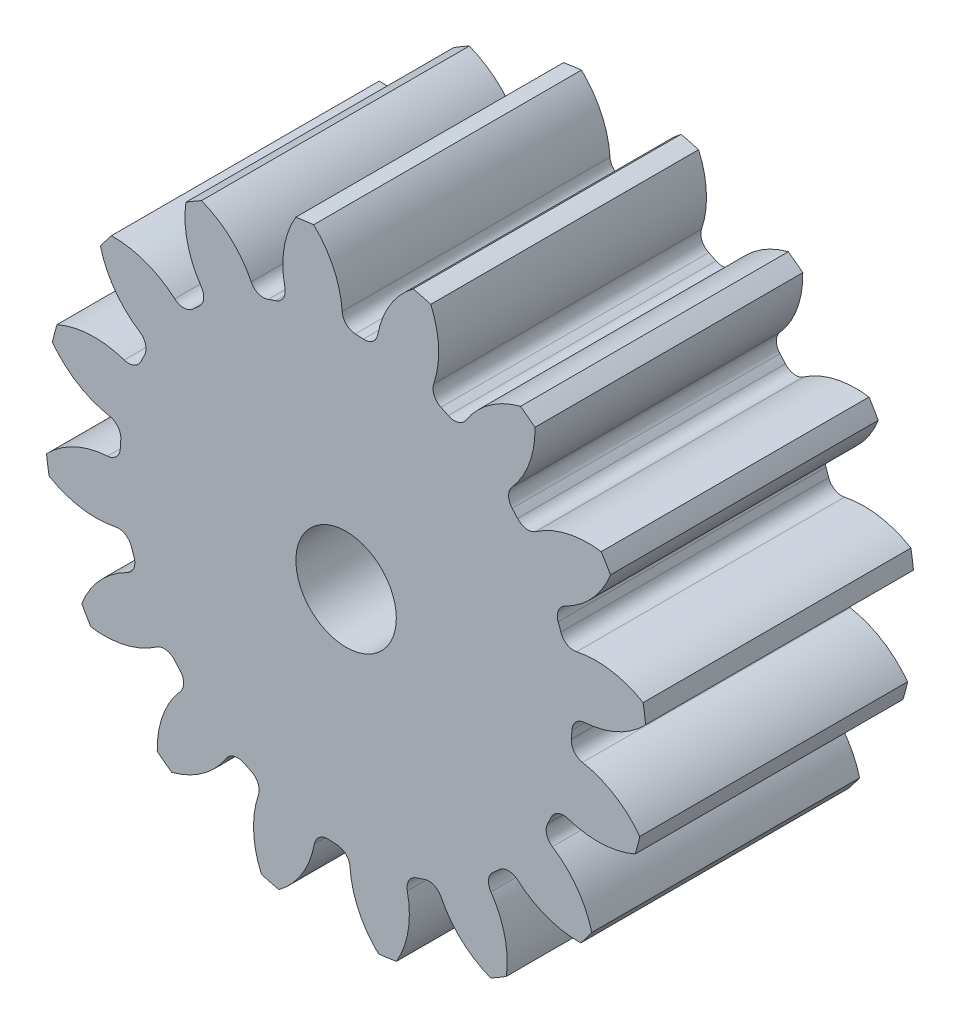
ISO-10303-21;
HEADER;
FILE_DESCRIPTION(('STEP AP214'),'2;1');
FILE_NAME('part.step','',(''),(''),'','','');
FILE_SCHEMA(('AUTOMOTIVE_DESIGN { 1 0 10303 214 1 1 1 1 }'));
ENDSEC;
DATA;
#1=APPLICATION_CONTEXT('core data for automotive mechanical design processes');
#2=APPLICATION_PROTOCOL_DEFINITION('international standard','automotive_design',2000,#1);
#3=PRODUCT_CONTEXT('',#1,'mechanical');
#4=PRODUCT('Part','Part','',(#3));
#5=PRODUCT_RELATED_PRODUCT_CATEGORY('part','',(#4));
#6=PRODUCT_DEFINITION_FORMATION('','',#4);
#7=PRODUCT_DEFINITION_CONTEXT('part definition',#1,'design');
#8=PRODUCT_DEFINITION('design','',#6,#7);
#9=PRODUCT_DEFINITION_SHAPE('','',#8);
#10=(LENGTH_UNIT() NAMED_UNIT(*) SI_UNIT(.MILLI.,.METRE.));
#11=(NAMED_UNIT(*) PLANE_ANGLE_UNIT() SI_UNIT($,.RADIAN.));
#12=(NAMED_UNIT(*) SI_UNIT($,.STERADIAN.) SOLID_ANGLE_UNIT());
#13=UNCERTAINTY_MEASURE_WITH_UNIT(LENGTH_MEASURE(1.E-05),#10,'distance_accuracy_value','');
#14=(GEOMETRIC_REPRESENTATION_CONTEXT(3) GLOBAL_UNCERTAINTY_ASSIGNED_CONTEXT((#13)) GLOBAL_UNIT_ASSIGNED_CONTEXT((#10,
#11,#12)) REPRESENTATION_CONTEXT('',''));
#15=CARTESIAN_POINT('',(0.,0.,0.));
#16=DIRECTION('',(0.,0.,1.));
#17=DIRECTION('',(1.,0.,0.));
#18=AXIS2_PLACEMENT_3D('',#15,#16,#17);
#19=CARTESIAN_POINT('',(0.,0.,101.6));
#20=DIRECTION('',(0.,0.,-1.));
#21=DIRECTION('',(-1.,0.,0.));
#22=AXIS2_PLACEMENT_3D('',#19,#20,#21);
#23=CYLINDRICAL_SURFACE('',#22,114.3);
#24=DIRECTION('',(0.,0.,-1.));
#25=VECTOR('',#24,1.);
#26=CARTESIAN_POINT('',(112.690575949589,19.1134531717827,50.8));
#27=LINE('',#26,#25);
#28=CARTESIAN_POINT('',(112.690575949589,19.1134531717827,101.6));
#29=VERTEX_POINT('',#28);
#30=CARTESIAN_POINT('',(112.690575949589,19.1134531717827,0.));
#31=VERTEX_POINT('',#30);
#32=EDGE_CURVE('E672',#29,#31,#27,.T.);
#33=ORIENTED_EDGE('',*,*,#32,.F.);
#34=CARTESIAN_POINT('',(0.,0.,101.6));
#35=DIRECTION('',(0.,0.,1.));
#36=DIRECTION('',(1.,0.,0.));
#37=AXIS2_PLACEMENT_3D('',#34,#35,#36);
#38=CIRCLE('',#37,114.3);
#39=CARTESIAN_POINT('',(113.635798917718,12.3042758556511,101.6));
#40=VERTEX_POINT('',#39);
#41=EDGE_CURVE('E1241',#40,#29,#38,.T.);
#42=ORIENTED_EDGE('',*,*,#41,.F.);
#43=DIRECTION('',(0.,0.,-1.));
#44=VECTOR('',#43,1.);
#45=CARTESIAN_POINT('',(113.635798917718,12.3042758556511,50.8));
#46=LINE('',#45,#44);
#47=CARTESIAN_POINT('',(113.635798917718,12.3042758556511,0.));
#48=VERTEX_POINT('',#47);
#49=EDGE_CURVE('E1235',#48,#40,#46,.F.);
#50=ORIENTED_EDGE('',*,*,#49,.F.);
#51=CARTESIAN_POINT('',(0.,0.,0.));
#52=DIRECTION('',(0.,0.,1.));
#53=DIRECTION('',(1.,0.,0.));
#54=AXIS2_PLACEMENT_3D('',#51,#52,#53);
#55=CIRCLE('',#54,114.3);
#56=EDGE_CURVE('E1246',#48,#31,#55,.T.);
#57=ORIENTED_EDGE('',*,*,#56,.T.);
#58=EDGE_LOOP('',(#33,#42,#50,#57));
#59=FACE_BOUND('',#58,.T.);
#60=ADVANCED_FACE('F33',(#59),#23,.T.);
#61=DIRECTION('',(0.,0.,-1.));
#62=VECTOR('',#61,1.);
#63=CARTESIAN_POINT('',(100.277146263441,54.854206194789,50.8));
#64=LINE('',#63,#62);
#65=CARTESIAN_POINT('',(100.277146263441,54.854206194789,0.));
#66=VERTEX_POINT('',#65);
#67=CARTESIAN_POINT('',(100.277146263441,54.854206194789,101.6));
#68=VERTEX_POINT('',#67);
#69=EDGE_CURVE('E643',#66,#68,#64,.F.);
#70=ORIENTED_EDGE('',*,*,#69,.F.);
#71=CARTESIAN_POINT('',(96.7981147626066,60.7833445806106,0.));
#72=VERTEX_POINT('',#71);
#73=EDGE_CURVE('E1249',#66,#72,#55,.T.);
#74=ORIENTED_EDGE('',*,*,#73,.T.);
#75=DIRECTION('',(0.,0.,-1.));
#76=VECTOR('',#75,1.);
#77=CARTESIAN_POINT('',(96.7981147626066,60.7833445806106,50.8));
#78=LINE('',#77,#76);
#79=CARTESIAN_POINT('',(96.7981147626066,60.7833445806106,101.6));
#80=VERTEX_POINT('',#79);
#81=EDGE_CURVE('E705',#80,#72,#78,.T.);
#82=ORIENTED_EDGE('',*,*,#81,.F.);
#83=EDGE_CURVE('E1244',#68,#80,#38,.T.);
#84=ORIENTED_EDGE('',*,*,#83,.F.);
#85=EDGE_LOOP('',(#70,#74,#82,#84));
#86=FACE_BOUND('',#85,.T.);
#87=ADVANCED_FACE('F1431',(#86),#23,.T.);
#88=CARTESIAN_POINT('',(0.,0.,101.6));
#89=DIRECTION('',(0.,0.,1.));
#90=DIRECTION('',(1.,0.,0.));
#91=AXIS2_PLACEMENT_3D('',#88,#89,#90);
#92=PLANE('',#91);
#93=CARTESIAN_POINT('',(0.,0.,101.599999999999));
#94=DIRECTION('',(0.,0.,1.));
#95=DIRECTION('',(1.,0.,0.));
#96=AXIS2_PLACEMENT_3D('',#93,#94,#95);
#97=CIRCLE('',#96,19.05);
#98=CARTESIAN_POINT('',(19.05,0.,101.599999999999));
#99=VERTEX_POINT('',#98);
#100=EDGE_CURVE('E660',#99,#99,#97,.T.);
#101=ORIENTED_EDGE('',*,*,#100,.F.);
#102=EDGE_LOOP('',(#101));
#103=FACE_BOUND('',#102,.T.);
#104=ORIENTED_EDGE('',*,*,#41,.T.);
#105=CARTESIAN_POINT('',(94.821945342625,-11.1287261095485,101.6));
#106=DIRECTION('',(0.,0.,-1.));
#107=DIRECTION('',(0.923879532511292,0.382683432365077,0.));
#108=AXIS2_PLACEMENT_3D('',#105,#106,#107);
#109=CIRCLE('',#108,35.1265906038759);
#110=CARTESIAN_POINT('',(87.4669442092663,23.2192188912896,101.6));
#111=VERTEX_POINT('',#110);
#112=EDGE_CURVE('E652',#111,#29,#109,.T.);
#113=ORIENTED_EDGE('',*,*,#112,.F.);
#114=CARTESIAN_POINT('',(86.3846511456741,28.2735406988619,101.6));
#115=DIRECTION('',(0.,0.,1.));
#116=DIRECTION('',(-0.923879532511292,-0.382683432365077,0.));
#117=AXIS2_PLACEMENT_3D('',#114,#115,#116);
#118=CIRCLE('',#117,5.16890000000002);
#119=CARTESIAN_POINT('',(81.4721804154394,26.6656978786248,101.6));
#120=VERTEX_POINT('',#119);
#121=EDGE_CURVE('E650',#120,#111,#118,.T.);
#122=ORIENTED_EDGE('',*,*,#121,.F.);
#123=CARTESIAN_POINT('',(0.,0.,101.6));
#124=DIRECTION('',(0.,0.,-1.));
#125=DIRECTION('',(0.923879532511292,0.382683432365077,0.));
#126=AXIS2_PLACEMENT_3D('',#123,#124,#125);
#127=CIRCLE('',#126,85.725);
#128=CARTESIAN_POINT('',(80.4611162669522,29.5767542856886,101.6));
#129=VERTEX_POINT('',#128);
#130=EDGE_CURVE('E635',#129,#120,#127,.T.);
#131=ORIENTED_EDGE('',*,*,#130,.F.);
#132=CARTESIAN_POINT('',(85.3126235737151,31.3601230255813,101.6));
#133=DIRECTION('',(0.,0.,1.));
#134=DIRECTION('',(-0.923879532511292,-0.382683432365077,0.));
#135=AXIS2_PLACEMENT_3D('',#132,#133,#134);
#136=CIRCLE('',#135,5.16890000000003);
#137=CARTESIAN_POINT('',(83.0289224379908,35.9971734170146,101.6));
#138=VERTEX_POINT('',#137);
#139=EDGE_CURVE('E627',#138,#129,#136,.T.);
#140=ORIENTED_EDGE('',*,*,#139,.F.);
#141=CARTESIAN_POINT('',(67.5094434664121,67.5094430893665,101.6));
#142=DIRECTION('',(0.,0.,-1.));
#143=DIRECTION('',(-0.923879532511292,-0.382683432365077,0.));
#144=AXIS2_PLACEMENT_3D('',#141,#142,#143);
#145=CIRCLE('',#144,35.1265906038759);
#146=EDGE_CURVE('E657',#68,#138,#145,.T.);
#147=ORIENTED_EDGE('',*,*,#146,.F.);
#148=ORIENTED_EDGE('',*,*,#83,.T.);
#149=CARTESIAN_POINT('',(91.8628336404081,26.005185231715,101.6));
#150=DIRECTION('',(0.,0.,-1.));
#151=DIRECTION('',(0.707106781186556,0.707106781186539,0.));
#152=AXIS2_PLACEMENT_3D('',#149,#150,#151);
#153=CIRCLE('',#152,35.1265906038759);
#154=CARTESIAN_POINT('',(71.9233091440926,54.9239115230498,101.6));
#155=VERTEX_POINT('',#154);
#156=EDGE_CURVE('E681',#155,#80,#153,.T.);
#157=ORIENTED_EDGE('',*,*,#156,.F.);
#158=CARTESIAN_POINT('',(68.9891955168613,59.1793203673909,101.6));
#159=DIRECTION('',(0.,0.,1.));
#160=DIRECTION('',(-0.707106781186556,-0.707106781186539,0.));
#161=AXIS2_PLACEMENT_3D('',#158,#159,#160);
#162=CIRCLE('',#161,5.16890000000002);
#163=CARTESIAN_POINT('',(65.0659591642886,55.8139461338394,101.6));
#164=VERTEX_POINT('',#163);
#165=EDGE_CURVE('E679',#164,#155,#162,.T.);
#166=ORIENTED_EDGE('',*,*,#165,.F.);
#167=CARTESIAN_POINT('',(0.,0.,101.6));
#168=DIRECTION('',(0.,0.,-1.));
#169=DIRECTION('',(0.707106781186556,0.707106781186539,0.));
#170=AXIS2_PLACEMENT_3D('',#167,#168,#169);
#171=CIRCLE('',#170,85.725);
#172=CARTESIAN_POINT('',(63.0178446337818,58.1164940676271,101.6));
#173=VERTEX_POINT('',#172);
#174=EDGE_CURVE('E676',#173,#164,#171,.T.);
#175=ORIENTED_EDGE('',*,*,#174,.F.);
#176=CARTESIAN_POINT('',(66.8175872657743,61.6207034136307,101.6));
#177=DIRECTION('',(0.,0.,1.));
#178=DIRECTION('',(-0.707106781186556,-0.707106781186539,0.));
#179=AXIS2_PLACEMENT_3D('',#176,#177,#178);
#180=CIRCLE('',#179,5.16890000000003);
#181=CARTESIAN_POINT('',(62.9332001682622,65.0308447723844,101.6));
#182=VERTEX_POINT('',#181);
#183=EDGE_CURVE('E674',#182,#173,#180,.T.);
#184=ORIENTED_EDGE('',*,*,#183,.F.);
#185=CARTESIAN_POINT('',(36.5358476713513,88.2053382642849,101.6));
#186=DIRECTION('',(0.,0.,-1.));
#187=DIRECTION('',(-0.707106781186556,-0.707106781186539,0.));
#188=AXIS2_PLACEMENT_3D('',#185,#186,#187);
#189=CIRCLE('',#188,35.1265906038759);
#190=CARTESIAN_POINT('',(71.6522071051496,89.0530808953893,101.6));
#191=VERTEX_POINT('',#190);
#192=EDGE_CURVE('E684',#191,#182,#189,.T.);
#193=ORIENTED_EDGE('',*,*,#192,.F.);
#194=CARTESIAN_POINT('',(66.1690180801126,93.1995227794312,101.6));
#195=VERTEX_POINT('',#194);
#196=EDGE_CURVE('E1289',#191,#195,#38,.T.);
#197=ORIENTED_EDGE('',*,*,#196,.T.);
#198=CARTESIAN_POINT('',(74.9184382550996,59.180042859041,101.6));
#199=DIRECTION('',(0.,0.,-1.));
#200=DIRECTION('',(0.3826834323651,0.923879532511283,0.));
#201=AXIS2_PLACEMENT_3D('',#198,#199,#200);
#202=CIRCLE('',#201,35.1265906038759);
#203=CARTESIAN_POINT('',(45.4300022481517,78.2669365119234,101.6));
#204=VERTEX_POINT('',#203);
#205=EDGE_CURVE('E716',#204,#195,#202,.T.);
#206=ORIENTED_EDGE('',*,*,#205,.F.);
#207=CARTESIAN_POINT('',(41.0907602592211,81.0755849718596,101.6));
#208=DIRECTION('',(0.,0.,1.));
#209=DIRECTION('',(-0.3826834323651,-0.923879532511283,0.));
#210=AXIS2_PLACEMENT_3D('',#207,#208,#209);
#211=CIRCLE('',#210,5.16890000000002);
#212=CARTESIAN_POINT('',(38.7540354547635,76.4650270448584,101.6));
#213=VERTEX_POINT('',#212);
#214=EDGE_CURVE('E714',#213,#204,#211,.T.);
#215=ORIENTED_EDGE('',*,*,#214,.F.);
#216=CARTESIAN_POINT('',(0.,0.,101.6));
#217=DIRECTION('',(0.,0.,-1.));
#218=DIRECTION('',(0.3826834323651,0.923879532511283,0.));
#219=AXIS2_PLACEMENT_3D('',#216,#217,#218);
#220=CIRCLE('',#219,85.725);
#221=CARTESIAN_POINT('',(35.9806774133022,77.8085244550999,101.6));
#222=VERTEX_POINT('',#221);
#223=EDGE_CURVE('E711',#222,#213,#220,.T.);
#224=ORIENTED_EDGE('',*,*,#223,.F.);
#225=CARTESIAN_POINT('',(38.1501789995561,82.5000903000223,101.6));
#226=DIRECTION('',(0.,0.,1.));
#227=DIRECTION('',(-0.3826834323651,-0.923879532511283,0.));
#228=AXIS2_PLACEMENT_3D('',#225,#226,#227);
#229=CIRCLE('',#228,5.16890000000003);
#230=CARTESIAN_POINT('',(33.2564686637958,84.1641595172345,101.6));
#231=VERTEX_POINT('',#230);
#232=EDGE_CURVE('E709',#231,#222,#229,.T.);
#233=ORIENTED_EDGE('',*,*,#232,.F.);
#234=CARTESIAN_POINT('',(2.66611191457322E-07,95.4727702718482,101.6));
#235=DIRECTION('',(0.,0.,-1.));
#236=DIRECTION('',(-0.3826834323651,-0.923879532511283,0.));
#237=AXIS2_PLACEMENT_3D('',#234,#235,#236);
#238=CIRCLE('',#237,35.1265906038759);
#239=CARTESIAN_POINT('',(32.1188689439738,109.694431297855,101.6));
#240=VERTEX_POINT('',#239);
#241=EDGE_CURVE('E719',#240,#231,#238,.T.);
#242=ORIENTED_EDGE('',*,*,#241,.F.);
#243=CARTESIAN_POINT('',(25.4662882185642,111.426918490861,101.6));
#244=VERTEX_POINT('',#243);
#245=EDGE_CURVE('E1413',#240,#244,#38,.T.);
#246=ORIENTED_EDGE('',*,*,#245,.T.);
#247=CARTESIAN_POINT('',(46.5683897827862,83.3452754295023,101.6));
#248=DIRECTION('',(0.,0.,-1.));
#249=DIRECTION('',(0.,1.,0.));
#250=AXIS2_PLACEMENT_3D('',#247,#248,#249);
#251=CIRCLE('',#250,35.1265906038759);
#252=CARTESIAN_POINT('',(12.0203893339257,89.6945299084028,101.6));
#253=VERTEX_POINT('',#252);
#254=EDGE_CURVE('E754',#253,#244,#251,.T.);
#255=ORIENTED_EDGE('',*,*,#254,.F.);
#256=CARTESIAN_POINT('',(6.93662924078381,90.6288267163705,101.6));
#257=DIRECTION('',(0.,0.,1.));
#258=DIRECTION('',(0.,-1.,0.));
#259=AXIS2_PLACEMENT_3D('',#256,#257,#258);
#260=CIRCLE('',#259,5.16890000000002);
#261=CARTESIAN_POINT('',(6.54216115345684,85.475000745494,101.6));
#262=VERTEX_POINT('',#261);
#263=EDGE_CURVE('E752',#262,#253,#260,.T.);
#264=ORIENTED_EDGE('',*,*,#263,.F.);
#265=CARTESIAN_POINT('',(0.,0.,101.6));
#266=DIRECTION('',(0.,0.,-1.));
#267=DIRECTION('',(0.,1.,0.));
#268=AXIS2_PLACEMENT_3D('',#265,#266,#267);
#269=CIRCLE('',#268,85.725);
#270=CARTESIAN_POINT('',(3.46577822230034,85.6549123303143,101.6));
#271=VERTEX_POINT('',#270);
#272=EDGE_CURVE('E749',#271,#262,#269,.T.);
#273=ORIENTED_EDGE('',*,*,#272,.F.);
#274=CARTESIAN_POINT('',(3.6747518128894,90.8195863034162,101.6));
#275=DIRECTION('',(0.,0.,1.));
#276=DIRECTION('',(0.,-1.,0.));
#277=AXIS2_PLACEMENT_3D('',#274,#275,#276);
#278=CIRCLE('',#277,5.16890000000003);
#279=CARTESIAN_POINT('',(-1.48325872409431,90.4842439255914,101.6));
#280=VERTEX_POINT('',#279);
#281=EDGE_CURVE('E747',#280,#271,#278,.T.);
#282=ORIENTED_EDGE('',*,*,#281,.F.);
#283=CARTESIAN_POINT('',(-36.535847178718,88.2053384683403,101.6));
#284=DIRECTION('',(0.,0.,-1.));
#285=DIRECTION('',(0.,-1.,0.));
#286=AXIS2_PLACEMENT_3D('',#283,#284,#285);
#287=CIRCLE('',#286,35.1265906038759);
#288=CARTESIAN_POINT('',(-12.3042758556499,113.635798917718,101.6));
#289=VERTEX_POINT('',#288);
#290=EDGE_CURVE('E757',#289,#280,#287,.T.);
#291=ORIENTED_EDGE('',*,*,#290,.F.);
#292=CARTESIAN_POINT('',(-19.1134531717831,112.690575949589,101.6));
#293=VERTEX_POINT('',#292);
#294=EDGE_CURVE('E1409',#289,#293,#38,.T.);
#295=ORIENTED_EDGE('',*,*,#294,.T.);
#296=CARTESIAN_POINT('',(11.1287261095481,94.821945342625,101.6));
#297=DIRECTION('',(0.,0.,-1.));
#298=DIRECTION('',(-0.382683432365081,0.923879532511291,0.));
#299=AXIS2_PLACEMENT_3D('',#296,#297,#298);
#300=CIRCLE('',#299,35.1265906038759);
#301=CARTESIAN_POINT('',(-23.2192188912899,87.4669442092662,101.6));
#302=VERTEX_POINT('',#301);
#303=EDGE_CURVE('E792',#302,#293,#300,.T.);
#304=ORIENTED_EDGE('',*,*,#303,.F.);
#305=CARTESIAN_POINT('',(-28.2735406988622,86.384651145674,101.6));
#306=DIRECTION('',(0.,0.,1.));
#307=DIRECTION('',(0.382683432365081,-0.923879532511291,0.));
#308=AXIS2_PLACEMENT_3D('',#305,#306,#307);
#309=CIRCLE('',#308,5.16890000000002);
#310=CARTESIAN_POINT('',(-26.6656978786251,81.4721804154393,101.6));
#311=VERTEX_POINT('',#310);
#312=EDGE_CURVE('E790',#311,#302,#309,.T.);
#313=ORIENTED_EDGE('',*,*,#312,.F.);
#314=CARTESIAN_POINT('',(0.,0.,101.6));
#315=DIRECTION('',(0.,0.,-1.));
#316=DIRECTION('',(-0.382683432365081,0.923879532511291,0.));
#317=AXIS2_PLACEMENT_3D('',#314,#315,#316);
#318=CIRCLE('',#317,85.725);
#319=CARTESIAN_POINT('',(-29.5767542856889,80.4611162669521,101.6));
#320=VERTEX_POINT('',#319);
#321=EDGE_CURVE('E787',#320,#311,#318,.T.);
#322=ORIENTED_EDGE('',*,*,#321,.F.);
#323=CARTESIAN_POINT('',(-31.3601230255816,85.312623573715,101.6));
#324=DIRECTION('',(0.,0.,1.));
#325=DIRECTION('',(0.382683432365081,-0.923879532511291,0.));
#326=AXIS2_PLACEMENT_3D('',#323,#324,#325);
#327=CIRCLE('',#326,5.16890000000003);
#328=CARTESIAN_POINT('',(-35.9971734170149,83.0289224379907,101.6));
#329=VERTEX_POINT('',#328);
#330=EDGE_CURVE('E785',#329,#320,#327,.T.);
#331=ORIENTED_EDGE('',*,*,#330,.F.);
#332=CARTESIAN_POINT('',(-67.5094430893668,67.5094434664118,101.6));
#333=DIRECTION('',(0.,0.,-1.));
#334=DIRECTION('',(0.382683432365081,-0.923879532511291,0.));
#335=AXIS2_PLACEMENT_3D('',#332,#333,#334);
#336=CIRCLE('',#335,35.1265906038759);
#337=CARTESIAN_POINT('',(-54.8542061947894,100.277146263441,101.6));
#338=VERTEX_POINT('',#337);
#339=EDGE_CURVE('E795',#338,#329,#336,.T.);
#340=ORIENTED_EDGE('',*,*,#339,.F.);
#341=CARTESIAN_POINT('',(-60.783344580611,96.7981147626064,101.6));
#342=VERTEX_POINT('',#341);
#343=EDGE_CURVE('E1405',#338,#342,#38,.T.);
#344=ORIENTED_EDGE('',*,*,#343,.T.);
#345=CARTESIAN_POINT('',(-26.0051852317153,91.862833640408,101.6));
#346=DIRECTION('',(0.,0.,-1.));
#347=DIRECTION('',(-0.707106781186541,0.707106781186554,0.));
#348=AXIS2_PLACEMENT_3D('',#345,#346,#347);
#349=CIRCLE('',#348,35.1265906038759);
#350=CARTESIAN_POINT('',(-54.9239115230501,71.9233091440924,101.6));
#351=VERTEX_POINT('',#350);
#352=EDGE_CURVE('E830',#351,#342,#349,.T.);
#353=ORIENTED_EDGE('',*,*,#352,.F.);
#354=CARTESIAN_POINT('',(-59.1793203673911,68.9891955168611,101.6));
#355=DIRECTION('',(0.,0.,1.));
#356=DIRECTION('',(0.707106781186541,-0.707106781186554,0.));
#357=AXIS2_PLACEMENT_3D('',#354,#355,#356);
#358=CIRCLE('',#357,5.16890000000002);
#359=CARTESIAN_POINT('',(-55.8139461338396,65.0659591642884,101.6));
#360=VERTEX_POINT('',#359);
#361=EDGE_CURVE('E828',#360,#351,#358,.T.);
#362=ORIENTED_EDGE('',*,*,#361,.F.);
#363=CARTESIAN_POINT('',(0.,0.,101.6));
#364=DIRECTION('',(0.,0.,-1.));
#365=DIRECTION('',(-0.707106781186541,0.707106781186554,0.));
#366=AXIS2_PLACEMENT_3D('',#363,#364,#365);
#367=CIRCLE('',#366,85.725);
#368=CARTESIAN_POINT('',(-58.1164940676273,63.0178446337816,101.6));
#369=VERTEX_POINT('',#368);
#370=EDGE_CURVE('E825',#369,#360,#367,.T.);
#371=ORIENTED_EDGE('',*,*,#370,.F.);
#372=CARTESIAN_POINT('',(-61.620703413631,66.8175872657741,101.6));
#373=DIRECTION('',(0.,0.,1.));
#374=DIRECTION('',(0.707106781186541,-0.707106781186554,0.));
#375=AXIS2_PLACEMENT_3D('',#372,#373,#374);
#376=CIRCLE('',#375,5.16890000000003);
#377=CARTESIAN_POINT('',(-65.0308447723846,62.933200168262,101.6));
#378=VERTEX_POINT('',#377);
#379=EDGE_CURVE('E823',#378,#369,#376,.T.);
#380=ORIENTED_EDGE('',*,*,#379,.F.);
#381=CARTESIAN_POINT('',(-88.205338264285,36.535847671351,101.6));
#382=DIRECTION('',(0.,0.,-1.));
#383=DIRECTION('',(0.707106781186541,-0.707106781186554,0.));
#384=AXIS2_PLACEMENT_3D('',#381,#382,#383);
#385=CIRCLE('',#384,35.1265906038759);
#386=CARTESIAN_POINT('',(-89.0530808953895,71.6522071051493,101.6));
#387=VERTEX_POINT('',#386);
#388=EDGE_CURVE('E833',#387,#378,#385,.T.);
#389=ORIENTED_EDGE('',*,*,#388,.F.);
#390=CARTESIAN_POINT('',(-93.1995227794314,66.1690180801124,101.6));
#391=VERTEX_POINT('',#390);
#392=EDGE_CURVE('E1401',#387,#391,#38,.T.);
#393=ORIENTED_EDGE('',*,*,#392,.T.);
#394=CARTESIAN_POINT('',(-59.1800428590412,74.9184382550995,101.6));
#395=DIRECTION('',(0.,0.,-1.));
#396=DIRECTION('',(-0.923879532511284,0.382683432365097,0.));
#397=AXIS2_PLACEMENT_3D('',#394,#395,#396);
#398=CIRCLE('',#397,35.1265906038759);
#399=CARTESIAN_POINT('',(-78.2669365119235,45.4300022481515,101.6));
#400=VERTEX_POINT('',#399);
#401=EDGE_CURVE('E868',#400,#391,#398,.T.);
#402=ORIENTED_EDGE('',*,*,#401,.F.);
#403=CARTESIAN_POINT('',(-81.0755849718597,41.0907602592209,101.6));
#404=DIRECTION('',(0.,0.,1.));
#405=DIRECTION('',(0.923879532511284,-0.382683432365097,0.));
#406=AXIS2_PLACEMENT_3D('',#403,#404,#405);
#407=CIRCLE('',#406,5.16890000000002);
#408=CARTESIAN_POINT('',(-76.4650270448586,38.7540354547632,101.6));
#409=VERTEX_POINT('',#408);
#410=EDGE_CURVE('E866',#409,#400,#407,.T.);
#411=ORIENTED_EDGE('',*,*,#410,.F.);
#412=CARTESIAN_POINT('',(0.,0.,101.6));
#413=DIRECTION('',(0.,0.,-1.));
#414=DIRECTION('',(-0.923879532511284,0.382683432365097,0.));
#415=AXIS2_PLACEMENT_3D('',#412,#413,#414);
#416=CIRCLE('',#415,85.725);
#417=CARTESIAN_POINT('',(-77.8085244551,35.9806774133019,101.6));
#418=VERTEX_POINT('',#417);
#419=EDGE_CURVE('E863',#418,#409,#416,.T.);
#420=ORIENTED_EDGE('',*,*,#419,.F.);
#421=CARTESIAN_POINT('',(-82.5000903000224,38.1501789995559,101.6));
#422=DIRECTION('',(0.,0.,1.));
#423=DIRECTION('',(0.923879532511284,-0.382683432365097,0.));
#424=AXIS2_PLACEMENT_3D('',#421,#422,#423);
#425=CIRCLE('',#424,5.16890000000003);
#426=CARTESIAN_POINT('',(-84.1641595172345,33.2564686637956,101.6));
#427=VERTEX_POINT('',#426);
#428=EDGE_CURVE('E861',#427,#418,#425,.T.);
#429=ORIENTED_EDGE('',*,*,#428,.F.);
#430=CARTESIAN_POINT('',(-95.4727702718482,2.66610913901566E-07,101.6));
#431=DIRECTION('',(0.,0.,-1.));
#432=DIRECTION('',(0.923879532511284,-0.382683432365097,0.));
#433=AXIS2_PLACEMENT_3D('',#430,#431,#432);
#434=CIRCLE('',#433,35.1265906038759);
#435=CARTESIAN_POINT('',(-109.694431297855,32.1188689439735,101.6));
#436=VERTEX_POINT('',#435);
#437=EDGE_CURVE('E871',#436,#427,#434,.T.);
#438=ORIENTED_EDGE('',*,*,#437,.F.);
#439=CARTESIAN_POINT('',(-111.426918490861,25.4662882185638,101.6));
#440=VERTEX_POINT('',#439);
#441=EDGE_CURVE('E1397',#436,#440,#38,.T.);
#442=ORIENTED_EDGE('',*,*,#441,.T.);
#443=CARTESIAN_POINT('',(-83.3452754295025,46.5683897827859,101.6));
#444=DIRECTION('',(0.,0.,-1.));
#445=DIRECTION('',(-1.,0.,0.));
#446=AXIS2_PLACEMENT_3D('',#443,#444,#445);
#447=CIRCLE('',#446,35.1265906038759);
#448=CARTESIAN_POINT('',(-89.6945299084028,12.0203893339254,101.6));
#449=VERTEX_POINT('',#448);
#450=EDGE_CURVE('E906',#449,#440,#447,.T.);
#451=ORIENTED_EDGE('',*,*,#450,.F.);
#452=CARTESIAN_POINT('',(-90.6288267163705,6.93662924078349,101.6));
#453=DIRECTION('',(0.,0.,1.));
#454=DIRECTION('',(1.,0.,0.));
#455=AXIS2_PLACEMENT_3D('',#452,#453,#454);
#456=CIRCLE('',#455,5.16890000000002);
#457=CARTESIAN_POINT('',(-85.475000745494,6.54216115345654,101.6));
#458=VERTEX_POINT('',#457);
#459=EDGE_CURVE('E904',#458,#449,#456,.T.);
#460=ORIENTED_EDGE('',*,*,#459,.F.);
#461=CARTESIAN_POINT('',(0.,0.,101.6));
#462=DIRECTION('',(0.,0.,-1.));
#463=DIRECTION('',(-1.,0.,0.));
#464=AXIS2_PLACEMENT_3D('',#461,#462,#463);
#465=CIRCLE('',#464,85.725);
#466=CARTESIAN_POINT('',(-85.6549123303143,3.46577822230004,101.6));
#467=VERTEX_POINT('',#466);
#468=EDGE_CURVE('E901',#467,#458,#465,.T.);
#469=ORIENTED_EDGE('',*,*,#468,.F.);
#470=CARTESIAN_POINT('',(-90.8195863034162,3.67475181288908,101.6));
#471=DIRECTION('',(0.,0.,1.));
#472=DIRECTION('',(1.,0.,0.));
#473=AXIS2_PLACEMENT_3D('',#470,#471,#472);
#474=CIRCLE('',#473,5.16890000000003);
#475=CARTESIAN_POINT('',(-90.4842439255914,-1.48325872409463,101.6));
#476=VERTEX_POINT('',#475);
#477=EDGE_CURVE('E899',#476,#467,#474,.T.);
#478=ORIENTED_EDGE('',*,*,#477,.F.);
#479=CARTESIAN_POINT('',(-88.2053384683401,-36.5358471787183,101.6));
#480=DIRECTION('',(0.,0.,-1.));
#481=DIRECTION('',(1.,0.,0.));
#482=AXIS2_PLACEMENT_3D('',#479,#480,#481);
#483=CIRCLE('',#482,35.1265906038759);
#484=CARTESIAN_POINT('',(-113.635798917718,-12.3042758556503,101.6));
#485=VERTEX_POINT('',#484);
#486=EDGE_CURVE('E909',#485,#476,#483,.T.);
#487=ORIENTED_EDGE('',*,*,#486,.F.);
#488=CARTESIAN_POINT('',(-112.690575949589,-19.1134531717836,101.6));
#489=VERTEX_POINT('',#488);
#490=EDGE_CURVE('E1393',#485,#489,#38,.T.);
#491=ORIENTED_EDGE('',*,*,#490,.T.);
#492=CARTESIAN_POINT('',(-94.8219453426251,11.1287261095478,101.6));
#493=DIRECTION('',(0.,0.,-1.));
#494=DIRECTION('',(-0.923879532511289,-0.382683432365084,0.));
#495=AXIS2_PLACEMENT_3D('',#492,#493,#494);
#496=CIRCLE('',#495,35.1265906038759);
#497=CARTESIAN_POINT('',(-87.4669442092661,-23.2192188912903,101.6));
#498=VERTEX_POINT('',#497);
#499=EDGE_CURVE('E944',#498,#489,#496,.T.);
#500=ORIENTED_EDGE('',*,*,#499,.F.);
#501=CARTESIAN_POINT('',(-86.3846511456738,-28.2735406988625,101.6));
#502=DIRECTION('',(0.,0.,1.));
#503=DIRECTION('',(0.923879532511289,0.382683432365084,0.));
#504=AXIS2_PLACEMENT_3D('',#501,#502,#503);
#505=CIRCLE('',#504,5.16890000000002);
#506=CARTESIAN_POINT('',(-81.4721804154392,-26.6656978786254,101.6));
#507=VERTEX_POINT('',#506);
#508=EDGE_CURVE('E942',#507,#498,#505,.T.);
#509=ORIENTED_EDGE('',*,*,#508,.F.);
#510=CARTESIAN_POINT('',(0.,0.,101.6));
#511=DIRECTION('',(0.,0.,-1.));
#512=DIRECTION('',(-0.923879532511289,-0.382683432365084,0.));
#513=AXIS2_PLACEMENT_3D('',#510,#511,#512);
#514=CIRCLE('',#513,85.725);
#515=CARTESIAN_POINT('',(-80.461116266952,-29.5767542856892,101.6));
#516=VERTEX_POINT('',#515);
#517=EDGE_CURVE('E939',#516,#507,#514,.T.);
#518=ORIENTED_EDGE('',*,*,#517,.F.);
#519=CARTESIAN_POINT('',(-85.3126235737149,-31.3601230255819,101.6));
#520=DIRECTION('',(0.,0.,1.));
#521=DIRECTION('',(0.923879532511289,0.382683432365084,0.));
#522=AXIS2_PLACEMENT_3D('',#519,#520,#521);
#523=CIRCLE('',#522,5.16890000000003);
#524=CARTESIAN_POINT('',(-83.0289224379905,-35.9971734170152,101.6));
#525=VERTEX_POINT('',#524);
#526=EDGE_CURVE('E937',#525,#516,#523,.T.);
#527=ORIENTED_EDGE('',*,*,#526,.F.);
#528=CARTESIAN_POINT('',(-67.5094434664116,-67.509443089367,101.6));
#529=DIRECTION('',(0.,0.,-1.));
#530=DIRECTION('',(0.923879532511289,0.382683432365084,0.));
#531=AXIS2_PLACEMENT_3D('',#528,#529,#530);
#532=CIRCLE('',#531,35.1265906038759);
#533=CARTESIAN_POINT('',(-100.277146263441,-54.8542061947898,101.6));
#534=VERTEX_POINT('',#533);
#535=EDGE_CURVE('E947',#534,#525,#532,.T.);
#536=ORIENTED_EDGE('',*,*,#535,.F.);
#537=CARTESIAN_POINT('',(-96.7981147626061,-60.7833445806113,101.6));
#538=VERTEX_POINT('',#537);
#539=EDGE_CURVE('E1389',#534,#538,#38,.T.);
#540=ORIENTED_EDGE('',*,*,#539,.T.);
#541=CARTESIAN_POINT('',(-91.8628336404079,-26.0051852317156,101.6));
#542=DIRECTION('',(0.,0.,-1.));
#543=DIRECTION('',(-0.707106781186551,-0.707106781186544,0.));
#544=AXIS2_PLACEMENT_3D('',#541,#542,#543);
#545=CIRCLE('',#544,35.1265906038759);
#546=CARTESIAN_POINT('',(-71.9233091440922,-54.9239115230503,101.6));
#547=VERTEX_POINT('',#546);
#548=EDGE_CURVE('E982',#547,#538,#545,.T.);
#549=ORIENTED_EDGE('',*,*,#548,.F.);
#550=CARTESIAN_POINT('',(-68.9891955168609,-59.1793203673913,101.6));
#551=DIRECTION('',(0.,0.,1.));
#552=DIRECTION('',(0.707106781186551,0.707106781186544,0.));
#553=AXIS2_PLACEMENT_3D('',#550,#551,#552);
#554=CIRCLE('',#553,5.16890000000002);
#555=CARTESIAN_POINT('',(-65.0659591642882,-55.8139461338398,101.6));
#556=VERTEX_POINT('',#555);
#557=EDGE_CURVE('E980',#556,#547,#554,.T.);
#558=ORIENTED_EDGE('',*,*,#557,.F.);
#559=CARTESIAN_POINT('',(0.,0.,101.6));
#560=DIRECTION('',(0.,0.,-1.));
#561=DIRECTION('',(-0.707106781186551,-0.707106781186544,0.));
#562=AXIS2_PLACEMENT_3D('',#559,#560,#561);
#563=CIRCLE('',#562,85.725);
#564=CARTESIAN_POINT('',(-63.0178446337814,-58.1164940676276,101.6));
#565=VERTEX_POINT('',#564);
#566=EDGE_CURVE('E977',#565,#556,#563,.T.);
#567=ORIENTED_EDGE('',*,*,#566,.F.);
#568=CARTESIAN_POINT('',(-66.8175872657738,-61.6207034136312,101.6));
#569=DIRECTION('',(0.,0.,1.));
#570=DIRECTION('',(0.707106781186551,0.707106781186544,0.));
#571=AXIS2_PLACEMENT_3D('',#568,#569,#570);
#572=CIRCLE('',#571,5.16890000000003);
#573=CARTESIAN_POINT('',(-62.9332001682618,-65.0308447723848,101.6));
#574=VERTEX_POINT('',#573);
#575=EDGE_CURVE('E975',#574,#565,#572,.T.);
#576=ORIENTED_EDGE('',*,*,#575,.F.);
#577=CARTESIAN_POINT('',(-36.5358476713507,-88.2053382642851,101.6));
#578=DIRECTION('',(0.,0.,-1.));
#579=DIRECTION('',(0.707106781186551,0.707106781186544,0.));
#580=AXIS2_PLACEMENT_3D('',#577,#578,#579);
#581=CIRCLE('',#580,35.1265906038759);
#582=CARTESIAN_POINT('',(-71.652207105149,-89.0530808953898,101.6));
#583=VERTEX_POINT('',#582);
#584=EDGE_CURVE('E985',#583,#574,#581,.T.);
#585=ORIENTED_EDGE('',*,*,#584,.F.);
#586=CARTESIAN_POINT('',(-66.169018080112,-93.1995227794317,101.6));
#587=VERTEX_POINT('',#586);
#588=EDGE_CURVE('E1385',#583,#587,#38,.T.);
#589=ORIENTED_EDGE('',*,*,#588,.T.);
#590=CARTESIAN_POINT('',(-74.9184382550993,-59.1800428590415,101.6));
#591=DIRECTION('',(0.,0.,-1.));
#592=DIRECTION('',(-0.382683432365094,-0.923879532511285,0.));
#593=AXIS2_PLACEMENT_3D('',#590,#591,#592);
#594=CIRCLE('',#593,35.1265906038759);
#595=CARTESIAN_POINT('',(-45.4300022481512,-78.2669365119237,101.6));
#596=VERTEX_POINT('',#595);
#597=EDGE_CURVE('E1020',#596,#587,#594,.T.);
#598=ORIENTED_EDGE('',*,*,#597,.F.);
#599=CARTESIAN_POINT('',(-41.0907602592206,-81.0755849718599,101.6));
#600=DIRECTION('',(0.,0.,1.));
#601=DIRECTION('',(0.382683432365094,0.923879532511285,0.));
#602=AXIS2_PLACEMENT_3D('',#599,#600,#601);
#603=CIRCLE('',#602,5.16890000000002);
#604=CARTESIAN_POINT('',(-38.754035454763,-76.4650270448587,101.6));
#605=VERTEX_POINT('',#604);
#606=EDGE_CURVE('E1018',#605,#596,#603,.T.);
#607=ORIENTED_EDGE('',*,*,#606,.F.);
#608=CARTESIAN_POINT('',(0.,0.,101.6));
#609=DIRECTION('',(0.,0.,-1.));
#610=DIRECTION('',(-0.382683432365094,-0.923879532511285,0.));
#611=AXIS2_PLACEMENT_3D('',#608,#609,#610);
#612=CIRCLE('',#611,85.725);
#613=CARTESIAN_POINT('',(-35.9806774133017,-77.8085244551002,101.6));
#614=VERTEX_POINT('',#613);
#615=EDGE_CURVE('E1015',#614,#605,#612,.T.);
#616=ORIENTED_EDGE('',*,*,#615,.F.);
#617=CARTESIAN_POINT('',(-38.1501789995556,-82.5000903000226,101.6));
#618=DIRECTION('',(0.,0.,1.));
#619=DIRECTION('',(0.382683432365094,0.923879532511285,0.));
#620=AXIS2_PLACEMENT_3D('',#617,#618,#619);
#621=CIRCLE('',#620,5.16890000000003);
#622=CARTESIAN_POINT('',(-33.2564686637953,-84.1641595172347,101.6));
#623=VERTEX_POINT('',#622);
#624=EDGE_CURVE('E1013',#623,#614,#621,.T.);
#625=ORIENTED_EDGE('',*,*,#624,.F.);
#626=CARTESIAN_POINT('',(-2.66610566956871E-07,-95.4727702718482,101.6));
#627=DIRECTION('',(0.,0.,-1.));
#628=DIRECTION('',(0.382683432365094,0.923879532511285,0.));
#629=AXIS2_PLACEMENT_3D('',#626,#627,#628);
#630=CIRCLE('',#629,35.1265906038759);
#631=CARTESIAN_POINT('',(-32.1188689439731,-109.694431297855,101.6));
#632=VERTEX_POINT('',#631);
#633=EDGE_CURVE('E1023',#632,#623,#630,.T.);
#634=ORIENTED_EDGE('',*,*,#633,.F.);
#635=CARTESIAN_POINT('',(-25.4662882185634,-111.426918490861,101.6));
#636=VERTEX_POINT('',#635);
#637=EDGE_CURVE('E1381',#632,#636,#38,.T.);
#638=ORIENTED_EDGE('',*,*,#637,.T.);
#639=CARTESIAN_POINT('',(-46.5683897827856,-83.3452754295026,101.6));
#640=DIRECTION('',(0.,0.,-1.));
#641=DIRECTION('',(0.,-1.,0.));
#642=AXIS2_PLACEMENT_3D('',#639,#640,#641);
#643=CIRCLE('',#642,35.1265906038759);
#644=CARTESIAN_POINT('',(-12.020389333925,-89.6945299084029,101.6));
#645=VERTEX_POINT('',#644);
#646=EDGE_CURVE('E1058',#645,#636,#643,.T.);
#647=ORIENTED_EDGE('',*,*,#646,.F.);
#648=CARTESIAN_POINT('',(-6.93662924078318,-90.6288267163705,101.6));
#649=DIRECTION('',(0.,0.,1.));
#650=DIRECTION('',(0.,1.,0.));
#651=AXIS2_PLACEMENT_3D('',#648,#649,#650);
#652=CIRCLE('',#651,5.16890000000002);
#653=CARTESIAN_POINT('',(-6.54216115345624,-85.475000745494,101.6));
#654=VERTEX_POINT('',#653);
#655=EDGE_CURVE('E1056',#654,#645,#652,.T.);
#656=ORIENTED_EDGE('',*,*,#655,.F.);
#657=CARTESIAN_POINT('',(0.,0.,101.6));
#658=DIRECTION('',(0.,0.,-1.));
#659=DIRECTION('',(0.,-1.,0.));
#660=AXIS2_PLACEMENT_3D('',#657,#658,#659);
#661=CIRCLE('',#660,85.725);
#662=CARTESIAN_POINT('',(-3.46577822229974,-85.6549123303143,101.6));
#663=VERTEX_POINT('',#662);
#664=EDGE_CURVE('E1053',#663,#654,#661,.T.);
#665=ORIENTED_EDGE('',*,*,#664,.F.);
#666=CARTESIAN_POINT('',(-3.67475181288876,-90.8195863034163,101.6));
#667=DIRECTION('',(0.,0.,1.));
#668=DIRECTION('',(0.,1.,0.));
#669=AXIS2_PLACEMENT_3D('',#666,#667,#668);
#670=CIRCLE('',#669,5.16890000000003);
#671=CARTESIAN_POINT('',(1.48325872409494,-90.4842439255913,101.6));
#672=VERTEX_POINT('',#671);
#673=EDGE_CURVE('E1051',#672,#663,#670,.T.);
#674=ORIENTED_EDGE('',*,*,#673,.F.);
#675=CARTESIAN_POINT('',(36.5358471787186,-88.20533846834,101.6));
#676=DIRECTION('',(0.,0.,-1.));
#677=DIRECTION('',(0.,1.,0.));
#678=AXIS2_PLACEMENT_3D('',#675,#676,#677);
#679=CIRCLE('',#678,35.1265906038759);
#680=CARTESIAN_POINT('',(12.3042758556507,-113.635798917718,101.6));
#681=VERTEX_POINT('',#680);
#682=EDGE_CURVE('E1061',#681,#672,#679,.T.);
#683=ORIENTED_EDGE('',*,*,#682,.F.);
#684=CARTESIAN_POINT('',(19.113453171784,-112.690575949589,101.6));
#685=VERTEX_POINT('',#684);
#686=EDGE_CURVE('E1377',#681,#685,#38,.T.);
#687=ORIENTED_EDGE('',*,*,#686,.T.);
#688=CARTESIAN_POINT('',(-11.1287261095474,-94.8219453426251,101.6));
#689=DIRECTION('',(0.,0.,-1.));
#690=DIRECTION('',(0.382683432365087,-0.923879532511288,0.));
#691=AXIS2_PLACEMENT_3D('',#688,#689,#690);
#692=CIRCLE('',#691,35.1265906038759);
#693=CARTESIAN_POINT('',(23.2192188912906,-87.466944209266,101.6));
#694=VERTEX_POINT('',#693);
#695=EDGE_CURVE('E1096',#694,#685,#692,.T.);
#696=ORIENTED_EDGE('',*,*,#695,.F.);
#697=CARTESIAN_POINT('',(28.2735406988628,-86.3846511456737,101.6));
#698=DIRECTION('',(0.,0.,1.));
#699=DIRECTION('',(-0.382683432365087,0.923879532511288,0.));
#700=AXIS2_PLACEMENT_3D('',#697,#698,#699);
#701=CIRCLE('',#700,5.16890000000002);
#702=CARTESIAN_POINT('',(26.6656978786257,-81.4721804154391,101.6));
#703=VERTEX_POINT('',#702);
#704=EDGE_CURVE('E1094',#703,#694,#701,.T.);
#705=ORIENTED_EDGE('',*,*,#704,.F.);
#706=CARTESIAN_POINT('',(0.,0.,101.6));
#707=DIRECTION('',(0.,0.,-1.));
#708=DIRECTION('',(0.382683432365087,-0.923879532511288,0.));
#709=AXIS2_PLACEMENT_3D('',#706,#707,#708);
#710=CIRCLE('',#709,85.725);
#711=CARTESIAN_POINT('',(29.5767542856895,-80.4611162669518,101.6));
#712=VERTEX_POINT('',#711);
#713=EDGE_CURVE('E1091',#712,#703,#710,.T.);
#714=ORIENTED_EDGE('',*,*,#713,.F.);
#715=CARTESIAN_POINT('',(31.3601230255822,-85.3126235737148,101.6));
#716=DIRECTION('',(0.,0.,1.));
#717=DIRECTION('',(-0.382683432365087,0.923879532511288,0.));
#718=AXIS2_PLACEMENT_3D('',#715,#716,#717);
#719=CIRCLE('',#718,5.16890000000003);
#720=CARTESIAN_POINT('',(35.9971734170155,-83.0289224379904,101.6));
#721=VERTEX_POINT('',#720);
#722=EDGE_CURVE('E1089',#721,#712,#719,.T.);
#723=ORIENTED_EDGE('',*,*,#722,.F.);
#724=CARTESIAN_POINT('',(67.5094430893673,-67.5094434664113,101.6));
#725=DIRECTION('',(0.,0.,-1.));
#726=DIRECTION('',(-0.382683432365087,0.923879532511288,0.));
#727=AXIS2_PLACEMENT_3D('',#724,#725,#726);
#728=CIRCLE('',#727,35.1265906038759);
#729=CARTESIAN_POINT('',(54.8542061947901,-100.277146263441,101.6));
#730=VERTEX_POINT('',#729);
#731=EDGE_CURVE('E1099',#730,#721,#728,.T.);
#732=ORIENTED_EDGE('',*,*,#731,.F.);
#733=CARTESIAN_POINT('',(60.7833445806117,-96.7981147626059,101.6));
#734=VERTEX_POINT('',#733);
#735=EDGE_CURVE('E1373',#730,#734,#38,.T.);
#736=ORIENTED_EDGE('',*,*,#735,.T.);
#737=CARTESIAN_POINT('',(26.005185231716,-91.8628336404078,101.6));
#738=DIRECTION('',(0.,0.,-1.));
#739=DIRECTION('',(0.707106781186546,-0.707106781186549,0.));
#740=AXIS2_PLACEMENT_3D('',#737,#738,#739);
#741=CIRCLE('',#740,35.1265906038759);
#742=CARTESIAN_POINT('',(54.9239115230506,-71.923309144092,101.6));
#743=VERTEX_POINT('',#742);
#744=EDGE_CURVE('E1134',#743,#734,#741,.T.);
#745=ORIENTED_EDGE('',*,*,#744,.F.);
#746=CARTESIAN_POINT('',(59.1793203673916,-68.9891955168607,101.6));
#747=DIRECTION('',(0.,0.,1.));
#748=DIRECTION('',(-0.707106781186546,0.707106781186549,0.));
#749=AXIS2_PLACEMENT_3D('',#746,#747,#748);
#750=CIRCLE('',#749,5.16890000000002);
#751=CARTESIAN_POINT('',(55.81394613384,-65.065959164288,101.6));
#752=VERTEX_POINT('',#751);
#753=EDGE_CURVE('E1132',#752,#743,#750,.T.);
#754=ORIENTED_EDGE('',*,*,#753,.F.);
#755=CARTESIAN_POINT('',(0.,0.,101.6));
#756=DIRECTION('',(0.,0.,-1.));
#757=DIRECTION('',(0.707106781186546,-0.707106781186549,0.));
#758=AXIS2_PLACEMENT_3D('',#755,#756,#757);
#759=CIRCLE('',#758,85.725);
#760=CARTESIAN_POINT('',(58.1164940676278,-63.0178446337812,101.6));
#761=VERTEX_POINT('',#760);
#762=EDGE_CURVE('E1129',#761,#752,#759,.T.);
#763=ORIENTED_EDGE('',*,*,#762,.F.);
#764=CARTESIAN_POINT('',(61.6207034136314,-66.8175872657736,101.6));
#765=DIRECTION('',(0.,0.,1.));
#766=DIRECTION('',(-0.707106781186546,0.707106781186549,0.));
#767=AXIS2_PLACEMENT_3D('',#764,#765,#766);
#768=CIRCLE('',#767,5.16890000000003);
#769=CARTESIAN_POINT('',(65.0308447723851,-62.9332001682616,101.6));
#770=VERTEX_POINT('',#769);
#771=EDGE_CURVE('E1127',#770,#761,#768,.T.);
#772=ORIENTED_EDGE('',*,*,#771,.F.);
#773=CARTESIAN_POINT('',(88.2053382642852,-36.5358476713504,101.6));
#774=DIRECTION('',(0.,0.,-1.));
#775=DIRECTION('',(-0.707106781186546,0.707106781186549,0.));
#776=AXIS2_PLACEMENT_3D('',#773,#774,#775);
#777=CIRCLE('',#776,35.1265906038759);
#778=CARTESIAN_POINT('',(89.05308089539,-71.6522071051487,101.6));
#779=VERTEX_POINT('',#778);
#780=EDGE_CURVE('E1137',#779,#770,#777,.T.);
#781=ORIENTED_EDGE('',*,*,#780,.F.);
#782=CARTESIAN_POINT('',(93.1995227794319,-66.1690180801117,101.6));
#783=VERTEX_POINT('',#782);
#784=EDGE_CURVE('E1372',#779,#783,#38,.T.);
#785=ORIENTED_EDGE('',*,*,#784,.T.);
#786=CARTESIAN_POINT('',(59.1800428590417,-74.9184382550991,101.6));
#787=DIRECTION('',(0.,0.,-1.));
#788=DIRECTION('',(0.923879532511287,-0.382683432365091,0.));
#789=AXIS2_PLACEMENT_3D('',#786,#787,#788);
#790=CIRCLE('',#789,35.1265906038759);
#791=CARTESIAN_POINT('',(78.2669365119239,-45.4300022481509,101.6));
#792=VERTEX_POINT('',#791);
#793=EDGE_CURVE('E1172',#792,#783,#790,.T.);
#794=ORIENTED_EDGE('',*,*,#793,.F.);
#795=CARTESIAN_POINT('',(81.07558497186,-41.0907602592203,101.6));
#796=DIRECTION('',(0.,0.,1.));
#797=DIRECTION('',(-0.923879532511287,0.382683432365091,0.));
#798=AXIS2_PLACEMENT_3D('',#795,#796,#797);
#799=CIRCLE('',#798,5.16890000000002);
#800=CARTESIAN_POINT('',(76.4650270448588,-38.7540354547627,101.6));
#801=VERTEX_POINT('',#800);
#802=EDGE_CURVE('E1170',#801,#792,#799,.T.);
#803=ORIENTED_EDGE('',*,*,#802,.F.);
#804=CARTESIAN_POINT('',(0.,0.,101.6));
#805=DIRECTION('',(0.,0.,-1.));
#806=DIRECTION('',(0.923879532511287,-0.382683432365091,0.));
#807=AXIS2_PLACEMENT_3D('',#804,#805,#806);
#808=CIRCLE('',#807,85.725);
#809=CARTESIAN_POINT('',(77.8085244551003,-35.9806774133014,101.6));
#810=VERTEX_POINT('',#809);
#811=EDGE_CURVE('E1167',#810,#801,#808,.T.);
#812=ORIENTED_EDGE('',*,*,#811,.F.);
#813=CARTESIAN_POINT('',(82.5000903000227,-38.1501789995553,101.6));
#814=DIRECTION('',(0.,0.,1.));
#815=DIRECTION('',(-0.923879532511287,0.382683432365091,0.));
#816=AXIS2_PLACEMENT_3D('',#813,#814,#815);
#817=CIRCLE('',#816,5.16890000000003);
#818=CARTESIAN_POINT('',(84.1641595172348,-33.256468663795,101.6));
#819=VERTEX_POINT('',#818);
#820=EDGE_CURVE('E1165',#819,#810,#817,.T.);
#821=ORIENTED_EDGE('',*,*,#820,.F.);
#822=CARTESIAN_POINT('',(95.4727702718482,-2.66610233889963E-07,101.6));
#823=DIRECTION('',(0.,0.,-1.));
#824=DIRECTION('',(-0.923879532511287,0.382683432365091,0.));
#825=AXIS2_PLACEMENT_3D('',#822,#823,#824);
#826=CIRCLE('',#825,35.1265906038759);
#827=CARTESIAN_POINT('',(109.694431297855,-32.1188689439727,101.6));
#828=VERTEX_POINT('',#827);
#829=EDGE_CURVE('E1175',#828,#819,#826,.T.);
#830=ORIENTED_EDGE('',*,*,#829,.F.);
#831=CARTESIAN_POINT('',(111.426918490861,-25.466288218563,101.6));
#832=VERTEX_POINT('',#831);
#833=EDGE_CURVE('E1245',#828,#832,#38,.T.);
#834=ORIENTED_EDGE('',*,*,#833,.T.);
#835=CARTESIAN_POINT('',(83.3452754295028,-46.5683897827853,101.6));
#836=DIRECTION('',(0.,0.,-1.));
#837=DIRECTION('',(1.,0.,0.));
#838=AXIS2_PLACEMENT_3D('',#835,#836,#837);
#839=CIRCLE('',#838,35.1265906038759);
#840=CARTESIAN_POINT('',(89.6945299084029,-12.0203893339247,101.6));
#841=VERTEX_POINT('',#840);
#842=EDGE_CURVE('E1210',#841,#832,#839,.T.);
#843=ORIENTED_EDGE('',*,*,#842,.F.);
#844=CARTESIAN_POINT('',(90.6288267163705,-6.93662924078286,101.6));
#845=DIRECTION('',(0.,0.,1.));
#846=DIRECTION('',(-1.,0.,0.));
#847=AXIS2_PLACEMENT_3D('',#844,#845,#846);
#848=CIRCLE('',#847,5.16890000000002);
#849=CARTESIAN_POINT('',(85.4750007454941,-6.54216115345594,101.6));
#850=VERTEX_POINT('',#849);
#851=EDGE_CURVE('E1208',#850,#841,#848,.T.);
#852=ORIENTED_EDGE('',*,*,#851,.F.);
#853=CARTESIAN_POINT('',(0.,0.,101.6));
#854=DIRECTION('',(0.,0.,-1.));
#855=DIRECTION('',(1.,0.,0.));
#856=AXIS2_PLACEMENT_3D('',#853,#854,#855);
#857=CIRCLE('',#856,85.725);
#858=CARTESIAN_POINT('',(85.6549123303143,-3.46577822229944,101.6));
#859=VERTEX_POINT('',#858);
#860=EDGE_CURVE('E1205',#859,#850,#857,.T.);
#861=ORIENTED_EDGE('',*,*,#860,.F.);
#862=CARTESIAN_POINT('',(90.8195863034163,-3.67475181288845,101.6));
#863=DIRECTION('',(0.,0.,1.));
#864=DIRECTION('',(-1.,0.,0.));
#865=AXIS2_PLACEMENT_3D('',#862,#863,#864);
#866=CIRCLE('',#865,5.16890000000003);
#867=CARTESIAN_POINT('',(90.4842439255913,1.48325872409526,101.6));
#868=VERTEX_POINT('',#867);
#869=EDGE_CURVE('E1203',#868,#859,#866,.T.);
#870=ORIENTED_EDGE('',*,*,#869,.F.);
#871=CARTESIAN_POINT('',(88.2053384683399,36.5358471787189,101.6));
#872=DIRECTION('',(0.,0.,-1.));
#873=DIRECTION('',(-1.,0.,0.));
#874=AXIS2_PLACEMENT_3D('',#871,#872,#873);
#875=CIRCLE('',#874,35.1265906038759);
#876=EDGE_CURVE('E1213',#40,#868,#875,.T.);
#877=ORIENTED_EDGE('',*,*,#876,.F.);
#878=EDGE_LOOP('',(#104,#113,#122,#131,#140,#147,#148,#157,#166,#175,#184,#193,#197,#206,#215,
#224,#233,#242,#246,#255,#264,#273,#282,#291,#295,#304,#313,#322,#331,#340,#344,#353,#362,#371,
#380,#389,#393,#402,#411,#420,#429,#438,#442,#451,#460,#469,#478,#487,#491,#500,#509,#518,#527,
#536,#540,#549,#558,#567,#576,#585,#589,#598,#607,#616,#625,#634,#638,#647,#656,#665,#674,#683,
#687,#696,#705,#714,#723,#732,#736,#745,#754,#763,#772,#781,#785,#794,#803,#812,#821,#830,#834,
#843,#852,#861,#870,#877));
#879=FACE_BOUND('',#878,.T.);
#880=ADVANCED_FACE('F648',(#103,#879),#92,.T.);
#881=CARTESIAN_POINT('',(0.,0.,0.));
#882=DIRECTION('',(0.,0.,1.));
#883=DIRECTION('',(1.,0.,0.));
#884=AXIS2_PLACEMENT_3D('',#881,#882,#883);
#885=PLANE('',#884);
#886=CARTESIAN_POINT('',(0.,0.,0.));
#887=DIRECTION('',(0.,0.,1.));
#888=DIRECTION('',(1.,0.,0.));
#889=AXIS2_PLACEMENT_3D('',#886,#887,#888);
#890=CIRCLE('',#889,19.05);
#891=CARTESIAN_POINT('',(19.05,0.,-1.77635683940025E-12));
#892=VERTEX_POINT('',#891);
#893=EDGE_CURVE('E36',#892,#892,#890,.T.);
#894=ORIENTED_EDGE('',*,*,#893,.T.);
#895=EDGE_LOOP('',(#894));
#896=FACE_BOUND('',#895,.T.);
#897=CARTESIAN_POINT('',(94.821945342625,-11.1287261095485,0.));
#898=DIRECTION('',(0.,0.,-1.));
#899=DIRECTION('',(0.923879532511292,0.382683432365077,0.));
#900=AXIS2_PLACEMENT_3D('',#897,#898,#899);
#901=CIRCLE('',#900,35.1265906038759);
#902=CARTESIAN_POINT('',(87.4669442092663,23.2192188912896,0.));
#903=VERTEX_POINT('',#902);
#904=EDGE_CURVE('E636',#903,#31,#901,.T.);
#905=ORIENTED_EDGE('',*,*,#904,.T.);
#906=ORIENTED_EDGE('',*,*,#56,.F.);
#907=CARTESIAN_POINT('',(88.2053384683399,36.5358471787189,0.));
#908=DIRECTION('',(0.,0.,1.));
#909=DIRECTION('',(1.,0.,0.));
#910=AXIS2_PLACEMENT_3D('',#907,#908,#909);
#911=CIRCLE('',#910,35.1265906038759);
#912=CARTESIAN_POINT('',(90.4842439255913,1.48325872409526,0.));
#913=VERTEX_POINT('',#912);
#914=EDGE_CURVE('E1243',#913,#48,#911,.T.);
#915=ORIENTED_EDGE('',*,*,#914,.F.);
#916=CARTESIAN_POINT('',(90.8195863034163,-3.67475181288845,0.));
#917=DIRECTION('',(0.,0.,1.));
#918=DIRECTION('',(-1.,0.,0.));
#919=AXIS2_PLACEMENT_3D('',#916,#917,#918);
#920=CIRCLE('',#919,5.16890000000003);
#921=CARTESIAN_POINT('',(85.6549123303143,-3.46577822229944,0.));
#922=VERTEX_POINT('',#921);
#923=EDGE_CURVE('E1202',#913,#922,#920,.T.);
#924=ORIENTED_EDGE('',*,*,#923,.T.);
#925=CARTESIAN_POINT('',(0.,0.,0.));
#926=DIRECTION('',(0.,0.,-1.));
#927=DIRECTION('',(1.,0.,0.));
#928=AXIS2_PLACEMENT_3D('',#925,#926,#927);
#929=CIRCLE('',#928,85.725);
#930=CARTESIAN_POINT('',(85.4750007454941,-6.54216115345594,0.));
#931=VERTEX_POINT('',#930);
#932=EDGE_CURVE('E1218',#922,#931,#929,.T.);
#933=ORIENTED_EDGE('',*,*,#932,.T.);
#934=CARTESIAN_POINT('',(90.6288267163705,-6.93662924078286,0.));
#935=DIRECTION('',(0.,0.,1.));
#936=DIRECTION('',(-1.,0.,0.));
#937=AXIS2_PLACEMENT_3D('',#934,#935,#936);
#938=CIRCLE('',#937,5.16890000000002);
#939=CARTESIAN_POINT('',(89.6945299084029,-12.0203893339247,0.));
#940=VERTEX_POINT('',#939);
#941=EDGE_CURVE('E1221',#931,#940,#938,.T.);
#942=ORIENTED_EDGE('',*,*,#941,.T.);
#943=CARTESIAN_POINT('',(83.3452754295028,-46.5683897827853,0.));
#944=DIRECTION('',(0.,0.,-1.));
#945=DIRECTION('',(1.,0.,0.));
#946=AXIS2_PLACEMENT_3D('',#943,#944,#945);
#947=CIRCLE('',#946,35.1265906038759);
#948=CARTESIAN_POINT('',(111.426918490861,-25.466288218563,0.));
#949=VERTEX_POINT('',#948);
#950=EDGE_CURVE('E1206',#940,#949,#947,.T.);
#951=ORIENTED_EDGE('',*,*,#950,.T.);
#952=CARTESIAN_POINT('',(109.694431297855,-32.1188689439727,0.));
#953=VERTEX_POINT('',#952);
#954=EDGE_CURVE('E1240',#953,#949,#55,.T.);
#955=ORIENTED_EDGE('',*,*,#954,.F.);
#956=CARTESIAN_POINT('',(95.4727702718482,-2.66610233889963E-07,0.));
#957=DIRECTION('',(0.,0.,1.));
#958=DIRECTION('',(1.,0.,0.));
#959=AXIS2_PLACEMENT_3D('',#956,#957,#958);
#960=CIRCLE('',#959,35.1265906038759);
#961=CARTESIAN_POINT('',(84.1641595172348,-33.256468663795,0.));
#962=VERTEX_POINT('',#961);
#963=EDGE_CURVE('E1251',#962,#953,#960,.T.);
#964=ORIENTED_EDGE('',*,*,#963,.F.);
#965=CARTESIAN_POINT('',(82.5000903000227,-38.1501789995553,0.));
#966=DIRECTION('',(0.,0.,1.));
#967=DIRECTION('',(-0.923879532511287,0.382683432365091,0.));
#968=AXIS2_PLACEMENT_3D('',#965,#966,#967);
#969=CIRCLE('',#968,5.16890000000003);
#970=CARTESIAN_POINT('',(77.8085244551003,-35.9806774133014,0.));
#971=VERTEX_POINT('',#970);
#972=EDGE_CURVE('E1164',#962,#971,#969,.T.);
#973=ORIENTED_EDGE('',*,*,#972,.T.);
#974=CARTESIAN_POINT('',(0.,0.,0.));
#975=DIRECTION('',(0.,0.,-1.));
#976=DIRECTION('',(0.923879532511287,-0.382683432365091,0.));
#977=AXIS2_PLACEMENT_3D('',#974,#975,#976);
#978=CIRCLE('',#977,85.725);
#979=CARTESIAN_POINT('',(76.4650270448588,-38.7540354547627,0.));
#980=VERTEX_POINT('',#979);
#981=EDGE_CURVE('E1180',#971,#980,#978,.T.);
#982=ORIENTED_EDGE('',*,*,#981,.T.);
#983=CARTESIAN_POINT('',(81.07558497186,-41.0907602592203,0.));
#984=DIRECTION('',(0.,0.,1.));
#985=DIRECTION('',(-0.923879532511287,0.382683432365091,0.));
#986=AXIS2_PLACEMENT_3D('',#983,#984,#985);
#987=CIRCLE('',#986,5.16890000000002);
#988=CARTESIAN_POINT('',(78.2669365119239,-45.4300022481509,0.));
#989=VERTEX_POINT('',#988);
#990=EDGE_CURVE('E1183',#980,#989,#987,.T.);
#991=ORIENTED_EDGE('',*,*,#990,.T.);
#992=CARTESIAN_POINT('',(59.1800428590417,-74.9184382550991,0.));
#993=DIRECTION('',(0.,0.,-1.));
#994=DIRECTION('',(0.923879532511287,-0.382683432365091,0.));
#995=AXIS2_PLACEMENT_3D('',#992,#993,#994);
#996=CIRCLE('',#995,35.1265906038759);
#997=CARTESIAN_POINT('',(93.1995227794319,-66.1690180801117,0.));
#998=VERTEX_POINT('',#997);
#999=EDGE_CURVE('E1168',#989,#998,#996,.T.);
#1000=ORIENTED_EDGE('',*,*,#999,.T.);
#1001=CARTESIAN_POINT('',(89.05308089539,-71.6522071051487,0.));
#1002=VERTEX_POINT('',#1001);
#1003=EDGE_CURVE('E1343',#1002,#998,#55,.T.);
#1004=ORIENTED_EDGE('',*,*,#1003,.F.);
#1005=CARTESIAN_POINT('',(88.2053382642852,-36.5358476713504,0.));
#1006=DIRECTION('',(0.,0.,1.));
#1007=DIRECTION('',(1.,0.,0.));
#1008=AXIS2_PLACEMENT_3D('',#1005,#1006,#1007);
#1009=CIRCLE('',#1008,35.1265906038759);
#1010=CARTESIAN_POINT('',(65.0308447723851,-62.9332001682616,0.));
#1011=VERTEX_POINT('',#1010);
#1012=EDGE_CURVE('E1253',#1011,#1002,#1009,.T.);
#1013=ORIENTED_EDGE('',*,*,#1012,.F.);
#1014=CARTESIAN_POINT('',(61.6207034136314,-66.8175872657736,0.));
#1015=DIRECTION('',(0.,0.,1.));
#1016=DIRECTION('',(-0.707106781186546,0.707106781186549,0.));
#1017=AXIS2_PLACEMENT_3D('',#1014,#1015,#1016);
#1018=CIRCLE('',#1017,5.16890000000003);
#1019=CARTESIAN_POINT('',(58.1164940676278,-63.0178446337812,0.));
#1020=VERTEX_POINT('',#1019);
#1021=EDGE_CURVE('E1126',#1011,#1020,#1018,.T.);
#1022=ORIENTED_EDGE('',*,*,#1021,.T.);
#1023=CARTESIAN_POINT('',(0.,0.,0.));
#1024=DIRECTION('',(0.,0.,-1.));
#1025=DIRECTION('',(0.707106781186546,-0.707106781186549,0.));
#1026=AXIS2_PLACEMENT_3D('',#1023,#1024,#1025);
#1027=CIRCLE('',#1026,85.725);
#1028=CARTESIAN_POINT('',(55.81394613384,-65.065959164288,0.));
#1029=VERTEX_POINT('',#1028);
#1030=EDGE_CURVE('E1142',#1020,#1029,#1027,.T.);
#1031=ORIENTED_EDGE('',*,*,#1030,.T.);
#1032=CARTESIAN_POINT('',(59.1793203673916,-68.9891955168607,0.));
#1033=DIRECTION('',(0.,0.,1.));
#1034=DIRECTION('',(-0.707106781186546,0.707106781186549,0.));
#1035=AXIS2_PLACEMENT_3D('',#1032,#1033,#1034);
#1036=CIRCLE('',#1035,5.16890000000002);
#1037=CARTESIAN_POINT('',(54.9239115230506,-71.923309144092,0.));
#1038=VERTEX_POINT('',#1037);
#1039=EDGE_CURVE('E1145',#1029,#1038,#1036,.T.);
#1040=ORIENTED_EDGE('',*,*,#1039,.T.);
#1041=CARTESIAN_POINT('',(26.005185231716,-91.8628336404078,0.));
#1042=DIRECTION('',(0.,0.,-1.));
#1043=DIRECTION('',(0.707106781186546,-0.707106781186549,0.));
#1044=AXIS2_PLACEMENT_3D('',#1041,#1042,#1043);
#1045=CIRCLE('',#1044,35.1265906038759);
#1046=CARTESIAN_POINT('',(60.7833445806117,-96.7981147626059,0.));
#1047=VERTEX_POINT('',#1046);
#1048=EDGE_CURVE('E1130',#1038,#1047,#1045,.T.);
#1049=ORIENTED_EDGE('',*,*,#1048,.T.);
#1050=CARTESIAN_POINT('',(54.8542061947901,-100.277146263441,0.));
#1051=VERTEX_POINT('',#1050);
#1052=EDGE_CURVE('E1338',#1051,#1047,#55,.T.);
#1053=ORIENTED_EDGE('',*,*,#1052,.F.);
#1054=CARTESIAN_POINT('',(67.5094430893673,-67.5094434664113,0.));
#1055=DIRECTION('',(0.,0.,1.));
#1056=DIRECTION('',(1.,0.,0.));
#1057=AXIS2_PLACEMENT_3D('',#1054,#1055,#1056);
#1058=CIRCLE('',#1057,35.1265906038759);
#1059=CARTESIAN_POINT('',(35.9971734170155,-83.0289224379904,0.));
#1060=VERTEX_POINT('',#1059);
#1061=EDGE_CURVE('E1255',#1060,#1051,#1058,.T.);
#1062=ORIENTED_EDGE('',*,*,#1061,.F.);
#1063=CARTESIAN_POINT('',(31.3601230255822,-85.3126235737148,0.));
#1064=DIRECTION('',(0.,0.,1.));
#1065=DIRECTION('',(-0.382683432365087,0.923879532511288,0.));
#1066=AXIS2_PLACEMENT_3D('',#1063,#1064,#1065);
#1067=CIRCLE('',#1066,5.16890000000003);
#1068=CARTESIAN_POINT('',(29.5767542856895,-80.4611162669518,0.));
#1069=VERTEX_POINT('',#1068);
#1070=EDGE_CURVE('E1088',#1060,#1069,#1067,.T.);
#1071=ORIENTED_EDGE('',*,*,#1070,.T.);
#1072=CARTESIAN_POINT('',(0.,0.,0.));
#1073=DIRECTION('',(0.,0.,-1.));
#1074=DIRECTION('',(0.382683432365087,-0.923879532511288,0.));
#1075=AXIS2_PLACEMENT_3D('',#1072,#1073,#1074);
#1076=CIRCLE('',#1075,85.725);
#1077=CARTESIAN_POINT('',(26.6656978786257,-81.4721804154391,0.));
#1078=VERTEX_POINT('',#1077);
#1079=EDGE_CURVE('E1104',#1069,#1078,#1076,.T.);
#1080=ORIENTED_EDGE('',*,*,#1079,.T.);
#1081=CARTESIAN_POINT('',(28.2735406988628,-86.3846511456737,0.));
#1082=DIRECTION('',(0.,0.,1.));
#1083=DIRECTION('',(-0.382683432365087,0.923879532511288,0.));
#1084=AXIS2_PLACEMENT_3D('',#1081,#1082,#1083);
#1085=CIRCLE('',#1084,5.16890000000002);
#1086=CARTESIAN_POINT('',(23.2192188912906,-87.466944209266,0.));
#1087=VERTEX_POINT('',#1086);
#1088=EDGE_CURVE('E1107',#1078,#1087,#1085,.T.);
#1089=ORIENTED_EDGE('',*,*,#1088,.T.);
#1090=CARTESIAN_POINT('',(-11.1287261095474,-94.8219453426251,0.));
#1091=DIRECTION('',(0.,0.,-1.));
#1092=DIRECTION('',(0.382683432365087,-0.923879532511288,0.));
#1093=AXIS2_PLACEMENT_3D('',#1090,#1091,#1092);
#1094=CIRCLE('',#1093,35.1265906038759);
#1095=CARTESIAN_POINT('',(19.113453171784,-112.690575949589,0.));
#1096=VERTEX_POINT('',#1095);
#1097=EDGE_CURVE('E1092',#1087,#1096,#1094,.T.);
#1098=ORIENTED_EDGE('',*,*,#1097,.T.);
#1099=CARTESIAN_POINT('',(12.3042758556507,-113.635798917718,0.));
#1100=VERTEX_POINT('',#1099);
#1101=EDGE_CURVE('E1333',#1100,#1096,#55,.T.);
#1102=ORIENTED_EDGE('',*,*,#1101,.F.);
#1103=CARTESIAN_POINT('',(36.5358471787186,-88.20533846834,0.));
#1104=DIRECTION('',(0.,0.,1.));
#1105=DIRECTION('',(1.,0.,0.));
#1106=AXIS2_PLACEMENT_3D('',#1103,#1104,#1105);
#1107=CIRCLE('',#1106,35.1265906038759);
#1108=CARTESIAN_POINT('',(1.48325872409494,-90.4842439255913,0.));
#1109=VERTEX_POINT('',#1108);
#1110=EDGE_CURVE('E1257',#1109,#1100,#1107,.T.);
#1111=ORIENTED_EDGE('',*,*,#1110,.F.);
#1112=CARTESIAN_POINT('',(-3.67475181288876,-90.8195863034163,0.));
#1113=DIRECTION('',(0.,0.,1.));
#1114=DIRECTION('',(0.,1.,0.));
#1115=AXIS2_PLACEMENT_3D('',#1112,#1113,#1114);
#1116=CIRCLE('',#1115,5.16890000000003);
#1117=CARTESIAN_POINT('',(-3.46577822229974,-85.6549123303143,0.));
#1118=VERTEX_POINT('',#1117);
#1119=EDGE_CURVE('E1050',#1109,#1118,#1116,.T.);
#1120=ORIENTED_EDGE('',*,*,#1119,.T.);
#1121=CARTESIAN_POINT('',(0.,0.,0.));
#1122=DIRECTION('',(0.,0.,-1.));
#1123=DIRECTION('',(0.,-1.,0.));
#1124=AXIS2_PLACEMENT_3D('',#1121,#1122,#1123);
#1125=CIRCLE('',#1124,85.725);
#1126=CARTESIAN_POINT('',(-6.54216115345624,-85.475000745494,0.));
#1127=VERTEX_POINT('',#1126);
#1128=EDGE_CURVE('E1066',#1118,#1127,#1125,.T.);
#1129=ORIENTED_EDGE('',*,*,#1128,.T.);
#1130=CARTESIAN_POINT('',(-6.93662924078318,-90.6288267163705,0.));
#1131=DIRECTION('',(0.,0.,1.));
#1132=DIRECTION('',(0.,1.,0.));
#1133=AXIS2_PLACEMENT_3D('',#1130,#1131,#1132);
#1134=CIRCLE('',#1133,5.16890000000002);
#1135=CARTESIAN_POINT('',(-12.020389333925,-89.6945299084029,0.));
#1136=VERTEX_POINT('',#1135);
#1137=EDGE_CURVE('E1069',#1127,#1136,#1134,.T.);
#1138=ORIENTED_EDGE('',*,*,#1137,.T.);
#1139=CARTESIAN_POINT('',(-46.5683897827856,-83.3452754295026,0.));
#1140=DIRECTION('',(0.,0.,-1.));
#1141=DIRECTION('',(0.,-1.,0.));
#1142=AXIS2_PLACEMENT_3D('',#1139,#1140,#1141);
#1143=CIRCLE('',#1142,35.1265906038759);
#1144=CARTESIAN_POINT('',(-25.4662882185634,-111.426918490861,0.));
#1145=VERTEX_POINT('',#1144);
#1146=EDGE_CURVE('E1054',#1136,#1145,#1143,.T.);
#1147=ORIENTED_EDGE('',*,*,#1146,.T.);
#1148=CARTESIAN_POINT('',(-32.1188689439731,-109.694431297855,0.));
#1149=VERTEX_POINT('',#1148);
#1150=EDGE_CURVE('E1328',#1149,#1145,#55,.T.);
#1151=ORIENTED_EDGE('',*,*,#1150,.F.);
#1152=CARTESIAN_POINT('',(-2.66610566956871E-07,-95.4727702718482,0.));
#1153=DIRECTION('',(0.,0.,1.));
#1154=DIRECTION('',(1.,0.,0.));
#1155=AXIS2_PLACEMENT_3D('',#1152,#1153,#1154);
#1156=CIRCLE('',#1155,35.1265906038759);
#1157=CARTESIAN_POINT('',(-33.2564686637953,-84.1641595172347,0.));
#1158=VERTEX_POINT('',#1157);
#1159=EDGE_CURVE('E1259',#1158,#1149,#1156,.T.);
#1160=ORIENTED_EDGE('',*,*,#1159,.F.);
#1161=CARTESIAN_POINT('',(-38.1501789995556,-82.5000903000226,0.));
#1162=DIRECTION('',(0.,0.,1.));
#1163=DIRECTION('',(0.382683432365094,0.923879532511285,0.));
#1164=AXIS2_PLACEMENT_3D('',#1161,#1162,#1163);
#1165=CIRCLE('',#1164,5.16890000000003);
#1166=CARTESIAN_POINT('',(-35.9806774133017,-77.8085244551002,0.));
#1167=VERTEX_POINT('',#1166);
#1168=EDGE_CURVE('E1012',#1158,#1167,#1165,.T.);
#1169=ORIENTED_EDGE('',*,*,#1168,.T.);
#1170=CARTESIAN_POINT('',(0.,0.,0.));
#1171=DIRECTION('',(0.,0.,-1.));
#1172=DIRECTION('',(-0.382683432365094,-0.923879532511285,0.));
#1173=AXIS2_PLACEMENT_3D('',#1170,#1171,#1172);
#1174=CIRCLE('',#1173,85.725);
#1175=CARTESIAN_POINT('',(-38.754035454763,-76.4650270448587,0.));
#1176=VERTEX_POINT('',#1175);
#1177=EDGE_CURVE('E1028',#1167,#1176,#1174,.T.);
#1178=ORIENTED_EDGE('',*,*,#1177,.T.);
#1179=CARTESIAN_POINT('',(-41.0907602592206,-81.0755849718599,0.));
#1180=DIRECTION('',(0.,0.,1.));
#1181=DIRECTION('',(0.382683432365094,0.923879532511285,0.));
#1182=AXIS2_PLACEMENT_3D('',#1179,#1180,#1181);
#1183=CIRCLE('',#1182,5.16890000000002);
#1184=CARTESIAN_POINT('',(-45.4300022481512,-78.2669365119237,0.));
#1185=VERTEX_POINT('',#1184);
#1186=EDGE_CURVE('E1031',#1176,#1185,#1183,.T.);
#1187=ORIENTED_EDGE('',*,*,#1186,.T.);
#1188=CARTESIAN_POINT('',(-74.9184382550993,-59.1800428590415,0.));
#1189=DIRECTION('',(0.,0.,-1.));
#1190=DIRECTION('',(-0.382683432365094,-0.923879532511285,0.));
#1191=AXIS2_PLACEMENT_3D('',#1188,#1189,#1190);
#1192=CIRCLE('',#1191,35.1265906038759);
#1193=CARTESIAN_POINT('',(-66.169018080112,-93.1995227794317,0.));
#1194=VERTEX_POINT('',#1193);
#1195=EDGE_CURVE('E1016',#1185,#1194,#1192,.T.);
#1196=ORIENTED_EDGE('',*,*,#1195,.T.);
#1197=CARTESIAN_POINT('',(-71.652207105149,-89.0530808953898,0.));
#1198=VERTEX_POINT('',#1197);
#1199=EDGE_CURVE('E1323',#1198,#1194,#55,.T.);
#1200=ORIENTED_EDGE('',*,*,#1199,.F.);
#1201=CARTESIAN_POINT('',(-36.5358476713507,-88.2053382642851,0.));
#1202=DIRECTION('',(0.,0.,1.));
#1203=DIRECTION('',(1.,0.,0.));
#1204=AXIS2_PLACEMENT_3D('',#1201,#1202,#1203);
#1205=CIRCLE('',#1204,35.1265906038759);
#1206=CARTESIAN_POINT('',(-62.9332001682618,-65.0308447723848,0.));
#1207=VERTEX_POINT('',#1206);
#1208=EDGE_CURVE('E1261',#1207,#1198,#1205,.T.);
#1209=ORIENTED_EDGE('',*,*,#1208,.F.);
#1210=CARTESIAN_POINT('',(-66.8175872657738,-61.6207034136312,0.));
#1211=DIRECTION('',(0.,0.,1.));
#1212=DIRECTION('',(0.707106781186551,0.707106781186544,0.));
#1213=AXIS2_PLACEMENT_3D('',#1210,#1211,#1212);
#1214=CIRCLE('',#1213,5.16890000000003);
#1215=CARTESIAN_POINT('',(-63.0178446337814,-58.1164940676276,0.));
#1216=VERTEX_POINT('',#1215);
#1217=EDGE_CURVE('E974',#1207,#1216,#1214,.T.);
#1218=ORIENTED_EDGE('',*,*,#1217,.T.);
#1219=CARTESIAN_POINT('',(0.,0.,0.));
#1220=DIRECTION('',(0.,0.,-1.));
#1221=DIRECTION('',(-0.707106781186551,-0.707106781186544,0.));
#1222=AXIS2_PLACEMENT_3D('',#1219,#1220,#1221);
#1223=CIRCLE('',#1222,85.725);
#1224=CARTESIAN_POINT('',(-65.0659591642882,-55.8139461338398,0.));
#1225=VERTEX_POINT('',#1224);
#1226=EDGE_CURVE('E990',#1216,#1225,#1223,.T.);
#1227=ORIENTED_EDGE('',*,*,#1226,.T.);
#1228=CARTESIAN_POINT('',(-68.9891955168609,-59.1793203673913,0.));
#1229=DIRECTION('',(0.,0.,1.));
#1230=DIRECTION('',(0.707106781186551,0.707106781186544,0.));
#1231=AXIS2_PLACEMENT_3D('',#1228,#1229,#1230);
#1232=CIRCLE('',#1231,5.16890000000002);
#1233=CARTESIAN_POINT('',(-71.9233091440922,-54.9239115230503,0.));
#1234=VERTEX_POINT('',#1233);
#1235=EDGE_CURVE('E993',#1225,#1234,#1232,.T.);
#1236=ORIENTED_EDGE('',*,*,#1235,.T.);
#1237=CARTESIAN_POINT('',(-91.8628336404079,-26.0051852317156,0.));
#1238=DIRECTION('',(0.,0.,-1.));
#1239=DIRECTION('',(-0.707106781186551,-0.707106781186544,0.));
#1240=AXIS2_PLACEMENT_3D('',#1237,#1238,#1239);
#1241=CIRCLE('',#1240,35.1265906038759);
#1242=CARTESIAN_POINT('',(-96.7981147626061,-60.7833445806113,0.));
#1243=VERTEX_POINT('',#1242);
#1244=EDGE_CURVE('E978',#1234,#1243,#1241,.T.);
#1245=ORIENTED_EDGE('',*,*,#1244,.T.);
#1246=CARTESIAN_POINT('',(-100.277146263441,-54.8542061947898,0.));
#1247=VERTEX_POINT('',#1246);
#1248=EDGE_CURVE('E1318',#1247,#1243,#55,.T.);
#1249=ORIENTED_EDGE('',*,*,#1248,.F.);
#1250=CARTESIAN_POINT('',(-67.5094434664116,-67.509443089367,0.));
#1251=DIRECTION('',(0.,0.,1.));
#1252=DIRECTION('',(1.,0.,0.));
#1253=AXIS2_PLACEMENT_3D('',#1250,#1251,#1252);
#1254=CIRCLE('',#1253,35.1265906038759);
#1255=CARTESIAN_POINT('',(-83.0289224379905,-35.9971734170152,0.));
#1256=VERTEX_POINT('',#1255);
#1257=EDGE_CURVE('E1263',#1256,#1247,#1254,.T.);
#1258=ORIENTED_EDGE('',*,*,#1257,.F.);
#1259=CARTESIAN_POINT('',(-85.3126235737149,-31.3601230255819,0.));
#1260=DIRECTION('',(0.,0.,1.));
#1261=DIRECTION('',(0.923879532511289,0.382683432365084,0.));
#1262=AXIS2_PLACEMENT_3D('',#1259,#1260,#1261);
#1263=CIRCLE('',#1262,5.16890000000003);
#1264=CARTESIAN_POINT('',(-80.461116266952,-29.5767542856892,0.));
#1265=VERTEX_POINT('',#1264);
#1266=EDGE_CURVE('E936',#1256,#1265,#1263,.T.);
#1267=ORIENTED_EDGE('',*,*,#1266,.T.);
#1268=CARTESIAN_POINT('',(0.,0.,0.));
#1269=DIRECTION('',(0.,0.,-1.));
#1270=DIRECTION('',(-0.923879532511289,-0.382683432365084,0.));
#1271=AXIS2_PLACEMENT_3D('',#1268,#1269,#1270);
#1272=CIRCLE('',#1271,85.725);
#1273=CARTESIAN_POINT('',(-81.4721804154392,-26.6656978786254,0.));
#1274=VERTEX_POINT('',#1273);
#1275=EDGE_CURVE('E952',#1265,#1274,#1272,.T.);
#1276=ORIENTED_EDGE('',*,*,#1275,.T.);
#1277=CARTESIAN_POINT('',(-86.3846511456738,-28.2735406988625,0.));
#1278=DIRECTION('',(0.,0.,1.));
#1279=DIRECTION('',(0.923879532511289,0.382683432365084,0.));
#1280=AXIS2_PLACEMENT_3D('',#1277,#1278,#1279);
#1281=CIRCLE('',#1280,5.16890000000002);
#1282=CARTESIAN_POINT('',(-87.4669442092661,-23.2192188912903,0.));
#1283=VERTEX_POINT('',#1282);
#1284=EDGE_CURVE('E955',#1274,#1283,#1281,.T.);
#1285=ORIENTED_EDGE('',*,*,#1284,.T.);
#1286=CARTESIAN_POINT('',(-94.8219453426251,11.1287261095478,0.));
#1287=DIRECTION('',(0.,0.,-1.));
#1288=DIRECTION('',(-0.923879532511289,-0.382683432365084,0.));
#1289=AXIS2_PLACEMENT_3D('',#1286,#1287,#1288);
#1290=CIRCLE('',#1289,35.1265906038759);
#1291=CARTESIAN_POINT('',(-112.690575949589,-19.1134531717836,0.));
#1292=VERTEX_POINT('',#1291);
#1293=EDGE_CURVE('E940',#1283,#1292,#1290,.T.);
#1294=ORIENTED_EDGE('',*,*,#1293,.T.);
#1295=CARTESIAN_POINT('',(-113.635798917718,-12.3042758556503,0.));
#1296=VERTEX_POINT('',#1295);
#1297=EDGE_CURVE('E1313',#1296,#1292,#55,.T.);
#1298=ORIENTED_EDGE('',*,*,#1297,.F.);
#1299=CARTESIAN_POINT('',(-88.2053384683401,-36.5358471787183,0.));
#1300=DIRECTION('',(0.,0.,1.));
#1301=DIRECTION('',(1.,0.,0.));
#1302=AXIS2_PLACEMENT_3D('',#1299,#1300,#1301);
#1303=CIRCLE('',#1302,35.1265906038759);
#1304=CARTESIAN_POINT('',(-90.4842439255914,-1.48325872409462,0.));
#1305=VERTEX_POINT('',#1304);
#1306=EDGE_CURVE('E1265',#1305,#1296,#1303,.T.);
#1307=ORIENTED_EDGE('',*,*,#1306,.F.);
#1308=CARTESIAN_POINT('',(-90.8195863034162,3.67475181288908,0.));
#1309=DIRECTION('',(0.,0.,1.));
#1310=DIRECTION('',(1.,0.,0.));
#1311=AXIS2_PLACEMENT_3D('',#1308,#1309,#1310);
#1312=CIRCLE('',#1311,5.16890000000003);
#1313=CARTESIAN_POINT('',(-85.6549123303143,3.46577822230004,0.));
#1314=VERTEX_POINT('',#1313);
#1315=EDGE_CURVE('E898',#1305,#1314,#1312,.T.);
#1316=ORIENTED_EDGE('',*,*,#1315,.T.);
#1317=CARTESIAN_POINT('',(0.,0.,0.));
#1318=DIRECTION('',(0.,0.,-1.));
#1319=DIRECTION('',(-1.,0.,0.));
#1320=AXIS2_PLACEMENT_3D('',#1317,#1318,#1319);
#1321=CIRCLE('',#1320,85.725);
#1322=CARTESIAN_POINT('',(-85.475000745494,6.54216115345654,0.));
#1323=VERTEX_POINT('',#1322);
#1324=EDGE_CURVE('E914',#1314,#1323,#1321,.T.);
#1325=ORIENTED_EDGE('',*,*,#1324,.T.);
#1326=CARTESIAN_POINT('',(-90.6288267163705,6.93662924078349,0.));
#1327=DIRECTION('',(0.,0.,1.));
#1328=DIRECTION('',(1.,0.,0.));
#1329=AXIS2_PLACEMENT_3D('',#1326,#1327,#1328);
#1330=CIRCLE('',#1329,5.16890000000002);
#1331=CARTESIAN_POINT('',(-89.6945299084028,12.0203893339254,0.));
#1332=VERTEX_POINT('',#1331);
#1333=EDGE_CURVE('E917',#1323,#1332,#1330,.T.);
#1334=ORIENTED_EDGE('',*,*,#1333,.T.);
#1335=CARTESIAN_POINT('',(-83.3452754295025,46.5683897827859,0.));
#1336=DIRECTION('',(0.,0.,-1.));
#1337=DIRECTION('',(-1.,0.,0.));
#1338=AXIS2_PLACEMENT_3D('',#1335,#1336,#1337);
#1339=CIRCLE('',#1338,35.1265906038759);
#1340=CARTESIAN_POINT('',(-111.426918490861,25.4662882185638,0.));
#1341=VERTEX_POINT('',#1340);
#1342=EDGE_CURVE('E902',#1332,#1341,#1339,.T.);
#1343=ORIENTED_EDGE('',*,*,#1342,.T.);
#1344=CARTESIAN_POINT('',(-109.694431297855,32.1188689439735,0.));
#1345=VERTEX_POINT('',#1344);
#1346=EDGE_CURVE('E1308',#1345,#1341,#55,.T.);
#1347=ORIENTED_EDGE('',*,*,#1346,.F.);
#1348=CARTESIAN_POINT('',(-95.4727702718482,2.66610913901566E-07,0.));
#1349=DIRECTION('',(0.,0.,1.));
#1350=DIRECTION('',(1.,0.,0.));
#1351=AXIS2_PLACEMENT_3D('',#1348,#1349,#1350);
#1352=CIRCLE('',#1351,35.1265906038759);
#1353=CARTESIAN_POINT('',(-84.1641595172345,33.2564686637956,0.));
#1354=VERTEX_POINT('',#1353);
#1355=EDGE_CURVE('E1267',#1354,#1345,#1352,.T.);
#1356=ORIENTED_EDGE('',*,*,#1355,.F.);
#1357=CARTESIAN_POINT('',(-82.5000903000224,38.1501789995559,0.));
#1358=DIRECTION('',(0.,0.,1.));
#1359=DIRECTION('',(0.923879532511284,-0.382683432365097,0.));
#1360=AXIS2_PLACEMENT_3D('',#1357,#1358,#1359);
#1361=CIRCLE('',#1360,5.16890000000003);
#1362=CARTESIAN_POINT('',(-77.8085244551,35.9806774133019,0.));
#1363=VERTEX_POINT('',#1362);
#1364=EDGE_CURVE('E860',#1354,#1363,#1361,.T.);
#1365=ORIENTED_EDGE('',*,*,#1364,.T.);
#1366=CARTESIAN_POINT('',(0.,0.,0.));
#1367=DIRECTION('',(0.,0.,-1.));
#1368=DIRECTION('',(-0.923879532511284,0.382683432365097,0.));
#1369=AXIS2_PLACEMENT_3D('',#1366,#1367,#1368);
#1370=CIRCLE('',#1369,85.725);
#1371=CARTESIAN_POINT('',(-76.4650270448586,38.7540354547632,0.));
#1372=VERTEX_POINT('',#1371);
#1373=EDGE_CURVE('E876',#1363,#1372,#1370,.T.);
#1374=ORIENTED_EDGE('',*,*,#1373,.T.);
#1375=CARTESIAN_POINT('',(-81.0755849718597,41.0907602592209,0.));
#1376=DIRECTION('',(0.,0.,1.));
#1377=DIRECTION('',(0.923879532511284,-0.382683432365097,0.));
#1378=AXIS2_PLACEMENT_3D('',#1375,#1376,#1377);
#1379=CIRCLE('',#1378,5.16890000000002);
#1380=CARTESIAN_POINT('',(-78.2669365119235,45.4300022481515,0.));
#1381=VERTEX_POINT('',#1380);
#1382=EDGE_CURVE('E879',#1372,#1381,#1379,.T.);
#1383=ORIENTED_EDGE('',*,*,#1382,.T.);
#1384=CARTESIAN_POINT('',(-59.1800428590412,74.9184382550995,0.));
#1385=DIRECTION('',(0.,0.,-1.));
#1386=DIRECTION('',(-0.923879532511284,0.382683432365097,0.));
#1387=AXIS2_PLACEMENT_3D('',#1384,#1385,#1386);
#1388=CIRCLE('',#1387,35.1265906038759);
#1389=CARTESIAN_POINT('',(-93.1995227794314,66.1690180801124,0.));
#1390=VERTEX_POINT('',#1389);
#1391=EDGE_CURVE('E864',#1381,#1390,#1388,.T.);
#1392=ORIENTED_EDGE('',*,*,#1391,.T.);
#1393=CARTESIAN_POINT('',(-89.0530808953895,71.6522071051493,0.));
#1394=VERTEX_POINT('',#1393);
#1395=EDGE_CURVE('E1303',#1394,#1390,#55,.T.);
#1396=ORIENTED_EDGE('',*,*,#1395,.F.);
#1397=CARTESIAN_POINT('',(-88.205338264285,36.535847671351,0.));
#1398=DIRECTION('',(0.,0.,1.));
#1399=DIRECTION('',(1.,0.,0.));
#1400=AXIS2_PLACEMENT_3D('',#1397,#1398,#1399);
#1401=CIRCLE('',#1400,35.1265906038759);
#1402=CARTESIAN_POINT('',(-65.0308447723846,62.933200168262,0.));
#1403=VERTEX_POINT('',#1402);
#1404=EDGE_CURVE('E1269',#1403,#1394,#1401,.T.);
#1405=ORIENTED_EDGE('',*,*,#1404,.F.);
#1406=CARTESIAN_POINT('',(-61.620703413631,66.8175872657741,0.));
#1407=DIRECTION('',(0.,0.,1.));
#1408=DIRECTION('',(0.707106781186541,-0.707106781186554,0.));
#1409=AXIS2_PLACEMENT_3D('',#1406,#1407,#1408);
#1410=CIRCLE('',#1409,5.16890000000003);
#1411=CARTESIAN_POINT('',(-58.1164940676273,63.0178446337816,0.));
#1412=VERTEX_POINT('',#1411);
#1413=EDGE_CURVE('E822',#1403,#1412,#1410,.T.);
#1414=ORIENTED_EDGE('',*,*,#1413,.T.);
#1415=CARTESIAN_POINT('',(0.,0.,0.));
#1416=DIRECTION('',(0.,0.,-1.));
#1417=DIRECTION('',(-0.707106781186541,0.707106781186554,0.));
#1418=AXIS2_PLACEMENT_3D('',#1415,#1416,#1417);
#1419=CIRCLE('',#1418,85.725);
#1420=CARTESIAN_POINT('',(-55.8139461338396,65.0659591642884,0.));
#1421=VERTEX_POINT('',#1420);
#1422=EDGE_CURVE('E838',#1412,#1421,#1419,.T.);
#1423=ORIENTED_EDGE('',*,*,#1422,.T.);
#1424=CARTESIAN_POINT('',(-59.1793203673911,68.9891955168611,0.));
#1425=DIRECTION('',(0.,0.,1.));
#1426=DIRECTION('',(0.707106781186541,-0.707106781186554,0.));
#1427=AXIS2_PLACEMENT_3D('',#1424,#1425,#1426);
#1428=CIRCLE('',#1427,5.16890000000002);
#1429=CARTESIAN_POINT('',(-54.9239115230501,71.9233091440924,0.));
#1430=VERTEX_POINT('',#1429);
#1431=EDGE_CURVE('E841',#1421,#1430,#1428,.T.);
#1432=ORIENTED_EDGE('',*,*,#1431,.T.);
#1433=CARTESIAN_POINT('',(-26.0051852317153,91.862833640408,0.));
#1434=DIRECTION('',(0.,0.,-1.));
#1435=DIRECTION('',(-0.707106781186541,0.707106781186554,0.));
#1436=AXIS2_PLACEMENT_3D('',#1433,#1434,#1435);
#1437=CIRCLE('',#1436,35.1265906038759);
#1438=CARTESIAN_POINT('',(-60.783344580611,96.7981147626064,0.));
#1439=VERTEX_POINT('',#1438);
#1440=EDGE_CURVE('E826',#1430,#1439,#1437,.T.);
#1441=ORIENTED_EDGE('',*,*,#1440,.T.);
#1442=CARTESIAN_POINT('',(-54.8542061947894,100.277146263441,0.));
#1443=VERTEX_POINT('',#1442);
#1444=EDGE_CURVE('E1298',#1443,#1439,#55,.T.);
#1445=ORIENTED_EDGE('',*,*,#1444,.F.);
#1446=CARTESIAN_POINT('',(-67.5094430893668,67.5094434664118,0.));
#1447=DIRECTION('',(0.,0.,1.));
#1448=DIRECTION('',(1.,0.,0.));
#1449=AXIS2_PLACEMENT_3D('',#1446,#1447,#1448);
#1450=CIRCLE('',#1449,35.1265906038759);
#1451=CARTESIAN_POINT('',(-35.9971734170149,83.0289224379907,0.));
#1452=VERTEX_POINT('',#1451);
#1453=EDGE_CURVE('E1271',#1452,#1443,#1450,.T.);
#1454=ORIENTED_EDGE('',*,*,#1453,.F.);
#1455=CARTESIAN_POINT('',(-31.3601230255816,85.312623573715,0.));
#1456=DIRECTION('',(0.,0.,1.));
#1457=DIRECTION('',(0.382683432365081,-0.923879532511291,0.));
#1458=AXIS2_PLACEMENT_3D('',#1455,#1456,#1457);
#1459=CIRCLE('',#1458,5.16890000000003);
#1460=CARTESIAN_POINT('',(-29.5767542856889,80.4611162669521,0.));
#1461=VERTEX_POINT('',#1460);
#1462=EDGE_CURVE('E784',#1452,#1461,#1459,.T.);
#1463=ORIENTED_EDGE('',*,*,#1462,.T.);
#1464=CARTESIAN_POINT('',(0.,0.,0.));
#1465=DIRECTION('',(0.,0.,-1.));
#1466=DIRECTION('',(-0.382683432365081,0.923879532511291,0.));
#1467=AXIS2_PLACEMENT_3D('',#1464,#1465,#1466);
#1468=CIRCLE('',#1467,85.725);
#1469=CARTESIAN_POINT('',(-26.6656978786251,81.4721804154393,0.));
#1470=VERTEX_POINT('',#1469);
#1471=EDGE_CURVE('E800',#1461,#1470,#1468,.T.);
#1472=ORIENTED_EDGE('',*,*,#1471,.T.);
#1473=CARTESIAN_POINT('',(-28.2735406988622,86.384651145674,0.));
#1474=DIRECTION('',(0.,0.,1.));
#1475=DIRECTION('',(0.382683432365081,-0.923879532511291,0.));
#1476=AXIS2_PLACEMENT_3D('',#1473,#1474,#1475);
#1477=CIRCLE('',#1476,5.16890000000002);
#1478=CARTESIAN_POINT('',(-23.2192188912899,87.4669442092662,0.));
#1479=VERTEX_POINT('',#1478);
#1480=EDGE_CURVE('E803',#1470,#1479,#1477,.T.);
#1481=ORIENTED_EDGE('',*,*,#1480,.T.);
#1482=CARTESIAN_POINT('',(11.1287261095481,94.821945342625,0.));
#1483=DIRECTION('',(0.,0.,-1.));
#1484=DIRECTION('',(-0.382683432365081,0.923879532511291,0.));
#1485=AXIS2_PLACEMENT_3D('',#1482,#1483,#1484);
#1486=CIRCLE('',#1485,35.1265906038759);
#1487=CARTESIAN_POINT('',(-19.1134531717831,112.690575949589,0.));
#1488=VERTEX_POINT('',#1487);
#1489=EDGE_CURVE('E788',#1479,#1488,#1486,.T.);
#1490=ORIENTED_EDGE('',*,*,#1489,.T.);
#1491=CARTESIAN_POINT('',(-12.3042758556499,113.635798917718,0.));
#1492=VERTEX_POINT('',#1491);
#1493=EDGE_CURVE('E1293',#1492,#1488,#55,.T.);
#1494=ORIENTED_EDGE('',*,*,#1493,.F.);
#1495=CARTESIAN_POINT('',(-36.535847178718,88.2053384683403,0.));
#1496=DIRECTION('',(0.,0.,1.));
#1497=DIRECTION('',(1.,0.,0.));
#1498=AXIS2_PLACEMENT_3D('',#1495,#1496,#1497);
#1499=CIRCLE('',#1498,35.1265906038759);
#1500=CARTESIAN_POINT('',(-1.48325872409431,90.4842439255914,0.));
#1501=VERTEX_POINT('',#1500);
#1502=EDGE_CURVE('E1273',#1501,#1492,#1499,.T.);
#1503=ORIENTED_EDGE('',*,*,#1502,.F.);
#1504=CARTESIAN_POINT('',(3.6747518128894,90.8195863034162,0.));
#1505=DIRECTION('',(0.,0.,1.));
#1506=DIRECTION('',(0.,-1.,0.));
#1507=AXIS2_PLACEMENT_3D('',#1504,#1505,#1506);
#1508=CIRCLE('',#1507,5.16890000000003);
#1509=CARTESIAN_POINT('',(3.46577822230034,85.6549123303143,0.));
#1510=VERTEX_POINT('',#1509);
#1511=EDGE_CURVE('E746',#1501,#1510,#1508,.T.);
#1512=ORIENTED_EDGE('',*,*,#1511,.T.);
#1513=CARTESIAN_POINT('',(0.,0.,0.));
#1514=DIRECTION('',(0.,0.,-1.));
#1515=DIRECTION('',(0.,1.,0.));
#1516=AXIS2_PLACEMENT_3D('',#1513,#1514,#1515);
#1517=CIRCLE('',#1516,85.725);
#1518=CARTESIAN_POINT('',(6.54216115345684,85.475000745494,0.));
#1519=VERTEX_POINT('',#1518);
#1520=EDGE_CURVE('E762',#1510,#1519,#1517,.T.);
#1521=ORIENTED_EDGE('',*,*,#1520,.T.);
#1522=CARTESIAN_POINT('',(6.93662924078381,90.6288267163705,0.));
#1523=DIRECTION('',(0.,0.,1.));
#1524=DIRECTION('',(0.,-1.,0.));
#1525=AXIS2_PLACEMENT_3D('',#1522,#1523,#1524);
#1526=CIRCLE('',#1525,5.16890000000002);
#1527=CARTESIAN_POINT('',(12.0203893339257,89.6945299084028,0.));
#1528=VERTEX_POINT('',#1527);
#1529=EDGE_CURVE('E765',#1519,#1528,#1526,.T.);
#1530=ORIENTED_EDGE('',*,*,#1529,.T.);
#1531=CARTESIAN_POINT('',(46.5683897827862,83.3452754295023,0.));
#1532=DIRECTION('',(0.,0.,-1.));
#1533=DIRECTION('',(0.,1.,0.));
#1534=AXIS2_PLACEMENT_3D('',#1531,#1532,#1533);
#1535=CIRCLE('',#1534,35.1265906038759);
#1536=CARTESIAN_POINT('',(25.4662882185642,111.426918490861,0.));
#1537=VERTEX_POINT('',#1536);
#1538=EDGE_CURVE('E750',#1528,#1537,#1535,.T.);
#1539=ORIENTED_EDGE('',*,*,#1538,.T.);
#1540=CARTESIAN_POINT('',(32.1188689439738,109.694431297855,0.));
#1541=VERTEX_POINT('',#1540);
#1542=EDGE_CURVE('E1292',#1541,#1537,#55,.T.);
#1543=ORIENTED_EDGE('',*,*,#1542,.F.);
#1544=CARTESIAN_POINT('',(2.66611191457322E-07,95.4727702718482,0.));
#1545=DIRECTION('',(0.,0.,1.));
#1546=DIRECTION('',(1.,0.,0.));
#1547=AXIS2_PLACEMENT_3D('',#1544,#1545,#1546);
#1548=CIRCLE('',#1547,35.1265906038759);
#1549=CARTESIAN_POINT('',(33.2564686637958,84.1641595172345,0.));
#1550=VERTEX_POINT('',#1549);
#1551=EDGE_CURVE('E1275',#1550,#1541,#1548,.T.);
#1552=ORIENTED_EDGE('',*,*,#1551,.F.);
#1553=CARTESIAN_POINT('',(38.1501789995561,82.5000903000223,0.));
#1554=DIRECTION('',(0.,0.,1.));
#1555=DIRECTION('',(-0.3826834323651,-0.923879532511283,0.));
#1556=AXIS2_PLACEMENT_3D('',#1553,#1554,#1555);
#1557=CIRCLE('',#1556,5.16890000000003);
#1558=CARTESIAN_POINT('',(35.9806774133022,77.8085244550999,0.));
#1559=VERTEX_POINT('',#1558);
#1560=EDGE_CURVE('E708',#1550,#1559,#1557,.T.);
#1561=ORIENTED_EDGE('',*,*,#1560,.T.);
#1562=CARTESIAN_POINT('',(0.,0.,0.));
#1563=DIRECTION('',(0.,0.,-1.));
#1564=DIRECTION('',(0.3826834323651,0.923879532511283,0.));
#1565=AXIS2_PLACEMENT_3D('',#1562,#1563,#1564);
#1566=CIRCLE('',#1565,85.725);
#1567=CARTESIAN_POINT('',(38.7540354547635,76.4650270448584,0.));
#1568=VERTEX_POINT('',#1567);
#1569=EDGE_CURVE('E724',#1559,#1568,#1566,.T.);
#1570=ORIENTED_EDGE('',*,*,#1569,.T.);
#1571=CARTESIAN_POINT('',(41.0907602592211,81.0755849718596,0.));
#1572=DIRECTION('',(0.,0.,1.));
#1573=DIRECTION('',(-0.3826834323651,-0.923879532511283,0.));
#1574=AXIS2_PLACEMENT_3D('',#1571,#1572,#1573);
#1575=CIRCLE('',#1574,5.16890000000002);
#1576=CARTESIAN_POINT('',(45.4300022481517,78.2669365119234,0.));
#1577=VERTEX_POINT('',#1576);
#1578=EDGE_CURVE('E727',#1568,#1577,#1575,.T.);
#1579=ORIENTED_EDGE('',*,*,#1578,.T.);
#1580=CARTESIAN_POINT('',(74.9184382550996,59.180042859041,0.));
#1581=DIRECTION('',(0.,0.,-1.));
#1582=DIRECTION('',(0.3826834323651,0.923879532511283,0.));
#1583=AXIS2_PLACEMENT_3D('',#1580,#1581,#1582);
#1584=CIRCLE('',#1583,35.1265906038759);
#1585=CARTESIAN_POINT('',(66.1690180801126,93.1995227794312,0.));
#1586=VERTEX_POINT('',#1585);
#1587=EDGE_CURVE('E712',#1577,#1586,#1584,.T.);
#1588=ORIENTED_EDGE('',*,*,#1587,.T.);
#1589=CARTESIAN_POINT('',(71.6522071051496,89.0530808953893,0.));
#1590=VERTEX_POINT('',#1589);
#1591=EDGE_CURVE('E1288',#1590,#1586,#55,.T.);
#1592=ORIENTED_EDGE('',*,*,#1591,.F.);
#1593=CARTESIAN_POINT('',(36.5358476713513,88.2053382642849,0.));
#1594=DIRECTION('',(0.,0.,1.));
#1595=DIRECTION('',(1.,0.,0.));
#1596=AXIS2_PLACEMENT_3D('',#1593,#1594,#1595);
#1597=CIRCLE('',#1596,35.1265906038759);
#1598=CARTESIAN_POINT('',(62.9332001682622,65.0308447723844,0.));
#1599=VERTEX_POINT('',#1598);
#1600=EDGE_CURVE('E41',#1599,#1590,#1597,.T.);
#1601=ORIENTED_EDGE('',*,*,#1600,.F.);
#1602=CARTESIAN_POINT('',(66.8175872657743,61.6207034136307,0.));
#1603=DIRECTION('',(0.,0.,1.));
#1604=DIRECTION('',(-0.707106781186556,-0.707106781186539,0.));
#1605=AXIS2_PLACEMENT_3D('',#1602,#1603,#1604);
#1606=CIRCLE('',#1605,5.16890000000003);
#1607=CARTESIAN_POINT('',(63.0178446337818,58.1164940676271,0.));
#1608=VERTEX_POINT('',#1607);
#1609=EDGE_CURVE('E56',#1599,#1608,#1606,.T.);
#1610=ORIENTED_EDGE('',*,*,#1609,.T.);
#1611=CARTESIAN_POINT('',(0.,0.,0.));
#1612=DIRECTION('',(0.,0.,-1.));
#1613=DIRECTION('',(0.707106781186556,0.707106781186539,0.));
#1614=AXIS2_PLACEMENT_3D('',#1611,#1612,#1613);
#1615=CIRCLE('',#1614,85.725);
#1616=CARTESIAN_POINT('',(65.0659591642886,55.8139461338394,0.));
#1617=VERTEX_POINT('',#1616);
#1618=EDGE_CURVE('E688',#1608,#1617,#1615,.T.);
#1619=ORIENTED_EDGE('',*,*,#1618,.T.);
#1620=CARTESIAN_POINT('',(68.9891955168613,59.1793203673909,0.));
#1621=DIRECTION('',(0.,0.,1.));
#1622=DIRECTION('',(-0.707106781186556,-0.707106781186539,0.));
#1623=AXIS2_PLACEMENT_3D('',#1620,#1621,#1622);
#1624=CIRCLE('',#1623,5.16890000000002);
#1625=CARTESIAN_POINT('',(71.9233091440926,54.9239115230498,0.));
#1626=VERTEX_POINT('',#1625);
#1627=EDGE_CURVE('E691',#1617,#1626,#1624,.T.);
#1628=ORIENTED_EDGE('',*,*,#1627,.T.);
#1629=CARTESIAN_POINT('',(91.8628336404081,26.005185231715,0.));
#1630=DIRECTION('',(0.,0.,-1.));
#1631=DIRECTION('',(0.707106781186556,0.707106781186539,0.));
#1632=AXIS2_PLACEMENT_3D('',#1629,#1630,#1631);
#1633=CIRCLE('',#1632,35.1265906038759);
#1634=EDGE_CURVE('E677',#1626,#72,#1633,.T.);
#1635=ORIENTED_EDGE('',*,*,#1634,.T.);
#1636=ORIENTED_EDGE('',*,*,#73,.F.);
#1637=CARTESIAN_POINT('',(67.5094434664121,67.5094430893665,0.));
#1638=DIRECTION('',(0.,0.,1.));
#1639=DIRECTION('',(1.,0.,0.));
#1640=AXIS2_PLACEMENT_3D('',#1637,#1638,#1639);
#1641=CIRCLE('',#1640,35.1265906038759);
#1642=CARTESIAN_POINT('',(83.0289224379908,35.9971734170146,0.));
#1643=VERTEX_POINT('',#1642);
#1644=EDGE_CURVE('E11',#1643,#66,#1641,.T.);
#1645=ORIENTED_EDGE('',*,*,#1644,.F.);
#1646=CARTESIAN_POINT('',(85.3126235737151,31.3601230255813,0.));
#1647=DIRECTION('',(0.,0.,1.));
#1648=DIRECTION('',(-0.923879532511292,-0.382683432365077,0.));
#1649=AXIS2_PLACEMENT_3D('',#1646,#1647,#1648);
#1650=CIRCLE('',#1649,5.16890000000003);
#1651=CARTESIAN_POINT('',(80.4611162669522,29.5767542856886,0.));
#1652=VERTEX_POINT('',#1651);
#1653=EDGE_CURVE('E48',#1643,#1652,#1650,.T.);
#1654=ORIENTED_EDGE('',*,*,#1653,.T.);
#1655=CARTESIAN_POINT('',(0.,0.,0.));
#1656=DIRECTION('',(0.,0.,-1.));
#1657=DIRECTION('',(0.923879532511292,0.382683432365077,0.));
#1658=AXIS2_PLACEMENT_3D('',#1655,#1656,#1657);
#1659=CIRCLE('',#1658,85.725);
#1660=CARTESIAN_POINT('',(81.4721804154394,26.6656978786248,0.));
#1661=VERTEX_POINT('',#1660);
#1662=EDGE_CURVE('E642',#1652,#1661,#1659,.T.);
#1663=ORIENTED_EDGE('',*,*,#1662,.T.);
#1664=CARTESIAN_POINT('',(86.3846511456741,28.2735406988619,0.));
#1665=DIRECTION('',(0.,0.,1.));
#1666=DIRECTION('',(-0.923879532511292,-0.382683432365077,0.));
#1667=AXIS2_PLACEMENT_3D('',#1664,#1665,#1666);
#1668=CIRCLE('',#1667,5.16890000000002);
#1669=EDGE_CURVE('E662',#1661,#903,#1668,.T.);
#1670=ORIENTED_EDGE('',*,*,#1669,.T.);
#1671=EDGE_LOOP('',(#905,#906,#915,#924,#933,#942,#951,#955,#964,#973,#982,#991,#1000,#1004,
#1013,#1022,#1031,#1040,#1049,#1053,#1062,#1071,#1080,#1089,#1098,#1102,#1111,#1120,#1129,#1138,
#1147,#1151,#1160,#1169,#1178,#1187,#1196,#1200,#1209,#1218,#1227,#1236,#1245,#1249,#1258,#1267,
#1276,#1285,#1294,#1298,#1307,#1316,#1325,#1334,#1343,#1347,#1356,#1365,#1374,#1383,#1392,#1396,
#1405,#1414,#1423,#1432,#1441,#1445,#1454,#1463,#1472,#1481,#1490,#1494,#1503,#1512,#1521,#1530,
#1539,#1543,#1552,#1561,#1570,#1579,#1588,#1592,#1601,#1610,#1619,#1628,#1635,#1636,#1645,#1654,
#1663,#1670));
#1672=FACE_BOUND('',#1671,.T.);
#1673=ADVANCED_FACE('F1290',(#896,#1672),#885,.F.);
#1674=DIRECTION('',(0.,0.,-1.));
#1675=VECTOR('',#1674,1.);
#1676=CARTESIAN_POINT('',(71.6522071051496,89.0530808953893,50.8));
#1677=LINE('',#1676,#1675);
#1678=EDGE_CURVE('E703',#1590,#191,#1677,.F.);
#1679=ORIENTED_EDGE('',*,*,#1678,.F.);
#1680=ORIENTED_EDGE('',*,*,#1591,.T.);
#1681=DIRECTION('',(0.,0.,-1.));
#1682=VECTOR('',#1681,1.);
#1683=CARTESIAN_POINT('',(66.1690180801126,93.1995227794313,50.8));
#1684=LINE('',#1683,#1682);
#1685=EDGE_CURVE('E743',#195,#1586,#1684,.T.);
#1686=ORIENTED_EDGE('',*,*,#1685,.F.);
#1687=ORIENTED_EDGE('',*,*,#196,.F.);
#1688=EDGE_LOOP('',(#1679,#1680,#1686,#1687));
#1689=FACE_BOUND('',#1688,.T.);
#1690=ADVANCED_FACE('F1286',(#1689),#23,.T.);
#1691=DIRECTION('',(0.,0.,-1.));
#1692=VECTOR('',#1691,1.);
#1693=CARTESIAN_POINT('',(32.1188689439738,109.694431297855,50.8));
#1694=LINE('',#1693,#1692);
#1695=EDGE_CURVE('E741',#1541,#240,#1694,.F.);
#1696=ORIENTED_EDGE('',*,*,#1695,.F.);
#1697=ORIENTED_EDGE('',*,*,#1542,.T.);
#1698=DIRECTION('',(0.,0.,-1.));
#1699=VECTOR('',#1698,1.);
#1700=CARTESIAN_POINT('',(25.4662882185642,111.426918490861,50.8));
#1701=LINE('',#1700,#1699);
#1702=EDGE_CURVE('E781',#244,#1537,#1701,.T.);
#1703=ORIENTED_EDGE('',*,*,#1702,.F.);
#1704=ORIENTED_EDGE('',*,*,#245,.F.);
#1705=EDGE_LOOP('',(#1696,#1697,#1703,#1704));
#1706=FACE_BOUND('',#1705,.T.);
#1707=ADVANCED_FACE('F1529',(#1706),#23,.T.);
#1708=DIRECTION('',(0.,0.,-1.));
#1709=VECTOR('',#1708,1.);
#1710=CARTESIAN_POINT('',(-12.3042758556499,113.635798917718,50.8));
#1711=LINE('',#1710,#1709);
#1712=EDGE_CURVE('E779',#1492,#289,#1711,.F.);
#1713=ORIENTED_EDGE('',*,*,#1712,.F.);
#1714=ORIENTED_EDGE('',*,*,#1493,.T.);
#1715=DIRECTION('',(0.,0.,-1.));
#1716=VECTOR('',#1715,1.);
#1717=CARTESIAN_POINT('',(-19.1134531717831,112.690575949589,50.8));
#1718=LINE('',#1717,#1716);
#1719=EDGE_CURVE('E819',#293,#1488,#1718,.T.);
#1720=ORIENTED_EDGE('',*,*,#1719,.F.);
#1721=ORIENTED_EDGE('',*,*,#294,.F.);
#1722=EDGE_LOOP('',(#1713,#1714,#1720,#1721));
#1723=FACE_BOUND('',#1722,.T.);
#1724=ADVANCED_FACE('F1617',(#1723),#23,.T.);
#1725=DIRECTION('',(0.,0.,-1.));
#1726=VECTOR('',#1725,1.);
#1727=CARTESIAN_POINT('',(-54.8542061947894,100.277146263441,50.8));
#1728=LINE('',#1727,#1726);
#1729=EDGE_CURVE('E817',#1443,#338,#1728,.F.);
#1730=ORIENTED_EDGE('',*,*,#1729,.F.);
#1731=ORIENTED_EDGE('',*,*,#1444,.T.);
#1732=DIRECTION('',(0.,0.,-1.));
#1733=VECTOR('',#1732,1.);
#1734=CARTESIAN_POINT('',(-60.783344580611,96.7981147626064,50.8));
#1735=LINE('',#1734,#1733);
#1736=EDGE_CURVE('E857',#342,#1439,#1735,.T.);
#1737=ORIENTED_EDGE('',*,*,#1736,.F.);
#1738=ORIENTED_EDGE('',*,*,#343,.F.);
#1739=EDGE_LOOP('',(#1730,#1731,#1737,#1738));
#1740=FACE_BOUND('',#1739,.T.);
#1741=ADVANCED_FACE('F1624',(#1740),#23,.T.);
#1742=DIRECTION('',(0.,0.,-1.));
#1743=VECTOR('',#1742,1.);
#1744=CARTESIAN_POINT('',(-89.0530808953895,71.6522071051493,50.8));
#1745=LINE('',#1744,#1743);
#1746=EDGE_CURVE('E855',#1394,#387,#1745,.F.);
#1747=ORIENTED_EDGE('',*,*,#1746,.F.);
#1748=ORIENTED_EDGE('',*,*,#1395,.T.);
#1749=DIRECTION('',(0.,0.,-1.));
#1750=VECTOR('',#1749,1.);
#1751=CARTESIAN_POINT('',(-93.1995227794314,66.1690180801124,50.8));
#1752=LINE('',#1751,#1750);
#1753=EDGE_CURVE('E895',#391,#1390,#1752,.T.);
#1754=ORIENTED_EDGE('',*,*,#1753,.F.);
#1755=ORIENTED_EDGE('',*,*,#392,.F.);
#1756=EDGE_LOOP('',(#1747,#1748,#1754,#1755));
#1757=FACE_BOUND('',#1756,.T.);
#1758=ADVANCED_FACE('F1631',(#1757),#23,.T.);
#1759=DIRECTION('',(0.,0.,-1.));
#1760=VECTOR('',#1759,1.);
#1761=CARTESIAN_POINT('',(-109.694431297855,32.1188689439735,50.8));
#1762=LINE('',#1761,#1760);
#1763=EDGE_CURVE('E893',#1345,#436,#1762,.F.);
#1764=ORIENTED_EDGE('',*,*,#1763,.F.);
#1765=ORIENTED_EDGE('',*,*,#1346,.T.);
#1766=DIRECTION('',(0.,0.,-1.));
#1767=VECTOR('',#1766,1.);
#1768=CARTESIAN_POINT('',(-111.426918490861,25.4662882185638,50.8));
#1769=LINE('',#1768,#1767);
#1770=EDGE_CURVE('E933',#440,#1341,#1769,.T.);
#1771=ORIENTED_EDGE('',*,*,#1770,.F.);
#1772=ORIENTED_EDGE('',*,*,#441,.F.);
#1773=EDGE_LOOP('',(#1764,#1765,#1771,#1772));
#1774=FACE_BOUND('',#1773,.T.);
#1775=ADVANCED_FACE('F1638',(#1774),#23,.T.);
#1776=DIRECTION('',(0.,0.,-1.));
#1777=VECTOR('',#1776,1.);
#1778=CARTESIAN_POINT('',(-113.635798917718,-12.3042758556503,50.8));
#1779=LINE('',#1778,#1777);
#1780=EDGE_CURVE('E931',#1296,#485,#1779,.F.);
#1781=ORIENTED_EDGE('',*,*,#1780,.F.);
#1782=ORIENTED_EDGE('',*,*,#1297,.T.);
#1783=DIRECTION('',(0.,0.,-1.));
#1784=VECTOR('',#1783,1.);
#1785=CARTESIAN_POINT('',(-112.690575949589,-19.1134531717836,50.8));
#1786=LINE('',#1785,#1784);
#1787=EDGE_CURVE('E971',#489,#1292,#1786,.T.);
#1788=ORIENTED_EDGE('',*,*,#1787,.F.);
#1789=ORIENTED_EDGE('',*,*,#490,.F.);
#1790=EDGE_LOOP('',(#1781,#1782,#1788,#1789));
#1791=FACE_BOUND('',#1790,.T.);
#1792=ADVANCED_FACE('F1645',(#1791),#23,.T.);
#1793=DIRECTION('',(0.,0.,-1.));
#1794=VECTOR('',#1793,1.);
#1795=CARTESIAN_POINT('',(-100.277146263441,-54.8542061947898,50.8));
#1796=LINE('',#1795,#1794);
#1797=EDGE_CURVE('E969',#1247,#534,#1796,.F.);
#1798=ORIENTED_EDGE('',*,*,#1797,.F.);
#1799=ORIENTED_EDGE('',*,*,#1248,.T.);
#1800=DIRECTION('',(0.,0.,-1.));
#1801=VECTOR('',#1800,1.);
#1802=CARTESIAN_POINT('',(-96.7981147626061,-60.7833445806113,50.8));
#1803=LINE('',#1802,#1801);
#1804=EDGE_CURVE('E1009',#538,#1243,#1803,.T.);
#1805=ORIENTED_EDGE('',*,*,#1804,.F.);
#1806=ORIENTED_EDGE('',*,*,#539,.F.);
#1807=EDGE_LOOP('',(#1798,#1799,#1805,#1806));
#1808=FACE_BOUND('',#1807,.T.);
#1809=ADVANCED_FACE('F1652',(#1808),#23,.T.);
#1810=DIRECTION('',(0.,0.,-1.));
#1811=VECTOR('',#1810,1.);
#1812=CARTESIAN_POINT('',(-71.652207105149,-89.0530808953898,50.8));
#1813=LINE('',#1812,#1811);
#1814=EDGE_CURVE('E1007',#1198,#583,#1813,.F.);
#1815=ORIENTED_EDGE('',*,*,#1814,.F.);
#1816=ORIENTED_EDGE('',*,*,#1199,.T.);
#1817=DIRECTION('',(0.,0.,-1.));
#1818=VECTOR('',#1817,1.);
#1819=CARTESIAN_POINT('',(-66.169018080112,-93.1995227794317,50.8));
#1820=LINE('',#1819,#1818);
#1821=EDGE_CURVE('E1047',#587,#1194,#1820,.T.);
#1822=ORIENTED_EDGE('',*,*,#1821,.F.);
#1823=ORIENTED_EDGE('',*,*,#588,.F.);
#1824=EDGE_LOOP('',(#1815,#1816,#1822,#1823));
#1825=FACE_BOUND('',#1824,.T.);
#1826=ADVANCED_FACE('F1659',(#1825),#23,.T.);
#1827=DIRECTION('',(0.,0.,-1.));
#1828=VECTOR('',#1827,1.);
#1829=CARTESIAN_POINT('',(-32.1188689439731,-109.694431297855,50.8));
#1830=LINE('',#1829,#1828);
#1831=EDGE_CURVE('E1045',#1149,#632,#1830,.F.);
#1832=ORIENTED_EDGE('',*,*,#1831,.F.);
#1833=ORIENTED_EDGE('',*,*,#1150,.T.);
#1834=DIRECTION('',(0.,0.,-1.));
#1835=VECTOR('',#1834,1.);
#1836=CARTESIAN_POINT('',(-25.4662882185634,-111.426918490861,50.8));
#1837=LINE('',#1836,#1835);
#1838=EDGE_CURVE('E1085',#636,#1145,#1837,.T.);
#1839=ORIENTED_EDGE('',*,*,#1838,.F.);
#1840=ORIENTED_EDGE('',*,*,#637,.F.);
#1841=EDGE_LOOP('',(#1832,#1833,#1839,#1840));
#1842=FACE_BOUND('',#1841,.T.);
#1843=ADVANCED_FACE('F1666',(#1842),#23,.T.);
#1844=DIRECTION('',(0.,0.,-1.));
#1845=VECTOR('',#1844,1.);
#1846=CARTESIAN_POINT('',(12.3042758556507,-113.635798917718,50.8));
#1847=LINE('',#1846,#1845);
#1848=EDGE_CURVE('E1083',#1100,#681,#1847,.F.);
#1849=ORIENTED_EDGE('',*,*,#1848,.F.);
#1850=ORIENTED_EDGE('',*,*,#1101,.T.);
#1851=DIRECTION('',(0.,0.,-1.));
#1852=VECTOR('',#1851,1.);
#1853=CARTESIAN_POINT('',(19.1134531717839,-112.690575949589,50.8));
#1854=LINE('',#1853,#1852);
#1855=EDGE_CURVE('E1123',#685,#1096,#1854,.T.);
#1856=ORIENTED_EDGE('',*,*,#1855,.F.);
#1857=ORIENTED_EDGE('',*,*,#686,.F.);
#1858=EDGE_LOOP('',(#1849,#1850,#1856,#1857));
#1859=FACE_BOUND('',#1858,.T.);
#1860=ADVANCED_FACE('F1471',(#1859),#23,.T.);
#1861=DIRECTION('',(0.,0.,-1.));
#1862=VECTOR('',#1861,1.);
#1863=CARTESIAN_POINT('',(54.8542061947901,-100.277146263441,50.8));
#1864=LINE('',#1863,#1862);
#1865=EDGE_CURVE('E1121',#1051,#730,#1864,.F.);
#1866=ORIENTED_EDGE('',*,*,#1865,.F.);
#1867=ORIENTED_EDGE('',*,*,#1052,.T.);
#1868=DIRECTION('',(0.,0.,-1.));
#1869=VECTOR('',#1868,1.);
#1870=CARTESIAN_POINT('',(60.7833445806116,-96.7981147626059,50.8));
#1871=LINE('',#1870,#1869);
#1872=EDGE_CURVE('E1161',#734,#1047,#1871,.T.);
#1873=ORIENTED_EDGE('',*,*,#1872,.F.);
#1874=ORIENTED_EDGE('',*,*,#735,.F.);
#1875=EDGE_LOOP('',(#1866,#1867,#1873,#1874));
#1876=FACE_BOUND('',#1875,.T.);
#1877=ADVANCED_FACE('F1467',(#1876),#23,.T.);
#1878=DIRECTION('',(0.,0.,-1.));
#1879=VECTOR('',#1878,1.);
#1880=CARTESIAN_POINT('',(89.05308089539,-71.6522071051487,50.8));
#1881=LINE('',#1880,#1879);
#1882=EDGE_CURVE('E1159',#1002,#779,#1881,.F.);
#1883=ORIENTED_EDGE('',*,*,#1882,.F.);
#1884=ORIENTED_EDGE('',*,*,#1003,.T.);
#1885=DIRECTION('',(0.,0.,-1.));
#1886=VECTOR('',#1885,1.);
#1887=CARTESIAN_POINT('',(93.1995227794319,-66.1690180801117,50.8));
#1888=LINE('',#1887,#1886);
#1889=EDGE_CURVE('E1199',#783,#998,#1888,.T.);
#1890=ORIENTED_EDGE('',*,*,#1889,.F.);
#1891=ORIENTED_EDGE('',*,*,#784,.F.);
#1892=EDGE_LOOP('',(#1883,#1884,#1890,#1891));
#1893=FACE_BOUND('',#1892,.T.);
#1894=ADVANCED_FACE('F1460',(#1893),#23,.T.);
#1895=DIRECTION('',(0.,0.,-1.));
#1896=VECTOR('',#1895,1.);
#1897=CARTESIAN_POINT('',(109.694431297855,-32.1188689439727,50.8));
#1898=LINE('',#1897,#1896);
#1899=EDGE_CURVE('E1197',#953,#828,#1898,.F.);
#1900=ORIENTED_EDGE('',*,*,#1899,.F.);
#1901=ORIENTED_EDGE('',*,*,#954,.T.);
#1902=DIRECTION('',(0.,0.,-1.));
#1903=VECTOR('',#1902,1.);
#1904=CARTESIAN_POINT('',(111.426918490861,-25.466288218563,50.8));
#1905=LINE('',#1904,#1903);
#1906=EDGE_CURVE('E1237',#832,#949,#1905,.T.);
#1907=ORIENTED_EDGE('',*,*,#1906,.F.);
#1908=ORIENTED_EDGE('',*,*,#833,.F.);
#1909=EDGE_LOOP('',(#1900,#1901,#1907,#1908));
#1910=FACE_BOUND('',#1909,.T.);
#1911=ADVANCED_FACE('F1356',(#1910),#23,.T.);
#1912=CARTESIAN_POINT('',(83.3452754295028,-46.5683897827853,101.6));
#1913=DIRECTION('',(0.,0.,-1.));
#1914=DIRECTION('',(-1.,0.,0.));
#1915=AXIS2_PLACEMENT_3D('',#1912,#1913,#1914);
#1916=CYLINDRICAL_SURFACE('',#1915,35.1265906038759);
#1917=ORIENTED_EDGE('',*,*,#1906,.T.);
#1918=ORIENTED_EDGE('',*,*,#950,.F.);
#1919=DIRECTION('',(0.,0.,-1.));
#1920=VECTOR('',#1919,1.);
#1921=CARTESIAN_POINT('',(89.6945299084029,-12.0203893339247,101.6));
#1922=LINE('',#1921,#1920);
#1923=EDGE_CURVE('E1228',#841,#940,#1922,.T.);
#1924=ORIENTED_EDGE('',*,*,#1923,.F.);
#1925=ORIENTED_EDGE('',*,*,#842,.T.);
#1926=EDGE_LOOP('',(#1917,#1918,#1924,#1925));
#1927=FACE_BOUND('',#1926,.T.);
#1928=ADVANCED_FACE('F1361',(#1927),#1916,.T.);
#1929=CARTESIAN_POINT('',(88.2053384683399,36.5358471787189,101.6));
#1930=DIRECTION('',(0.,0.,-1.));
#1931=DIRECTION('',(-1.,0.,0.));
#1932=AXIS2_PLACEMENT_3D('',#1929,#1930,#1931);
#1933=CYLINDRICAL_SURFACE('',#1932,35.1265906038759);
#1934=ORIENTED_EDGE('',*,*,#49,.T.);
#1935=ORIENTED_EDGE('',*,*,#876,.T.);
#1936=DIRECTION('',(0.,0.,-1.));
#1937=VECTOR('',#1936,1.);
#1938=CARTESIAN_POINT('',(90.4842439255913,1.48325872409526,101.6));
#1939=LINE('',#1938,#1937);
#1940=EDGE_CURVE('E1215',#868,#913,#1939,.T.);
#1941=ORIENTED_EDGE('',*,*,#1940,.T.);
#1942=ORIENTED_EDGE('',*,*,#914,.T.);
#1943=EDGE_LOOP('',(#1934,#1935,#1941,#1942));
#1944=FACE_BOUND('',#1943,.T.);
#1945=ADVANCED_FACE('F1465',(#1944),#1933,.T.);
#1946=CARTESIAN_POINT('',(90.8195863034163,-3.67475181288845,101.6));
#1947=DIRECTION('',(0.,0.,-1.));
#1948=DIRECTION('',(-1.,0.,0.));
#1949=AXIS2_PLACEMENT_3D('',#1946,#1947,#1948);
#1950=CYLINDRICAL_SURFACE('',#1949,5.16890000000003);
#1951=ORIENTED_EDGE('',*,*,#923,.F.);
#1952=ORIENTED_EDGE('',*,*,#1940,.F.);
#1953=ORIENTED_EDGE('',*,*,#869,.T.);
#1954=DIRECTION('',(0.,0.,-1.));
#1955=VECTOR('',#1954,1.);
#1956=CARTESIAN_POINT('',(85.6549123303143,-3.46577822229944,101.6));
#1957=LINE('',#1956,#1955);
#1958=EDGE_CURVE('E1232',#859,#922,#1957,.T.);
#1959=ORIENTED_EDGE('',*,*,#1958,.T.);
#1960=EDGE_LOOP('',(#1951,#1952,#1953,#1959));
#1961=FACE_BOUND('',#1960,.T.);
#1962=ADVANCED_FACE('F1510',(#1961),#1950,.F.);
#1963=CARTESIAN_POINT('',(0.,0.,101.6));
#1964=DIRECTION('',(0.,0.,-1.));
#1965=DIRECTION('',(-1.,0.,0.));
#1966=AXIS2_PLACEMENT_3D('',#1963,#1964,#1965);
#1967=CYLINDRICAL_SURFACE('',#1966,85.725);
#1968=ORIENTED_EDGE('',*,*,#932,.F.);
#1969=ORIENTED_EDGE('',*,*,#1958,.F.);
#1970=ORIENTED_EDGE('',*,*,#860,.T.);
#1971=DIRECTION('',(0.,0.,-1.));
#1972=VECTOR('',#1971,1.);
#1973=CARTESIAN_POINT('',(85.4750007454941,-6.54216115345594,101.6));
#1974=LINE('',#1973,#1972);
#1975=EDGE_CURVE('E1230',#850,#931,#1974,.T.);
#1976=ORIENTED_EDGE('',*,*,#1975,.T.);
#1977=EDGE_LOOP('',(#1968,#1969,#1970,#1976));
#1978=FACE_BOUND('',#1977,.T.);
#1979=ADVANCED_FACE('F1515',(#1978),#1967,.T.);
#1980=CARTESIAN_POINT('',(90.6288267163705,-6.93662924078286,101.6));
#1981=DIRECTION('',(0.,0.,-1.));
#1982=DIRECTION('',(-1.,0.,0.));
#1983=AXIS2_PLACEMENT_3D('',#1980,#1981,#1982);
#1984=CYLINDRICAL_SURFACE('',#1983,5.16890000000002);
#1985=ORIENTED_EDGE('',*,*,#941,.F.);
#1986=ORIENTED_EDGE('',*,*,#1975,.F.);
#1987=ORIENTED_EDGE('',*,*,#851,.T.);
#1988=ORIENTED_EDGE('',*,*,#1923,.T.);
#1989=EDGE_LOOP('',(#1985,#1986,#1987,#1988));
#1990=FACE_BOUND('',#1989,.T.);
#1991=ADVANCED_FACE('F1367',(#1990),#1984,.F.);
#1992=CARTESIAN_POINT('',(59.1800428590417,-74.9184382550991,101.6));
#1993=DIRECTION('',(0.,0.,-1.));
#1994=DIRECTION('',(-1.,0.,0.));
#1995=AXIS2_PLACEMENT_3D('',#1992,#1993,#1994);
#1996=CYLINDRICAL_SURFACE('',#1995,35.1265906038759);
#1997=ORIENTED_EDGE('',*,*,#1889,.T.);
#1998=ORIENTED_EDGE('',*,*,#999,.F.);
#1999=DIRECTION('',(0.,0.,-1.));
#2000=VECTOR('',#1999,1.);
#2001=CARTESIAN_POINT('',(78.2669365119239,-45.4300022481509,101.6));
#2002=LINE('',#2001,#2000);
#2003=EDGE_CURVE('E1190',#792,#989,#2002,.T.);
#2004=ORIENTED_EDGE('',*,*,#2003,.F.);
#2005=ORIENTED_EDGE('',*,*,#793,.T.);
#2006=EDGE_LOOP('',(#1997,#1998,#2004,#2005));
#2007=FACE_BOUND('',#2006,.T.);
#2008=ADVANCED_FACE('F1478',(#2007),#1996,.T.);
#2009=CARTESIAN_POINT('',(95.4727702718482,-2.66610233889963E-07,101.6));
#2010=DIRECTION('',(0.,0.,-1.));
#2011=DIRECTION('',(-1.,0.,0.));
#2012=AXIS2_PLACEMENT_3D('',#2009,#2010,#2011);
#2013=CYLINDRICAL_SURFACE('',#2012,35.1265906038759);
#2014=ORIENTED_EDGE('',*,*,#1899,.T.);
#2015=ORIENTED_EDGE('',*,*,#829,.T.);
#2016=DIRECTION('',(0.,0.,-1.));
#2017=VECTOR('',#2016,1.);
#2018=CARTESIAN_POINT('',(84.1641595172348,-33.256468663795,101.6));
#2019=LINE('',#2018,#2017);
#2020=EDGE_CURVE('E1177',#819,#962,#2019,.T.);
#2021=ORIENTED_EDGE('',*,*,#2020,.T.);
#2022=ORIENTED_EDGE('',*,*,#963,.T.);
#2023=EDGE_LOOP('',(#2014,#2015,#2021,#2022));
#2024=FACE_BOUND('',#2023,.T.);
#2025=ADVANCED_FACE('F1491',(#2024),#2013,.T.);
#2026=CARTESIAN_POINT('',(82.5000903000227,-38.1501789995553,101.6));
#2027=DIRECTION('',(0.,0.,-1.));
#2028=DIRECTION('',(-1.,0.,0.));
#2029=AXIS2_PLACEMENT_3D('',#2026,#2027,#2028);
#2030=CYLINDRICAL_SURFACE('',#2029,5.16890000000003);
#2031=ORIENTED_EDGE('',*,*,#972,.F.);
#2032=ORIENTED_EDGE('',*,*,#2020,.F.);
#2033=ORIENTED_EDGE('',*,*,#820,.T.);
#2034=DIRECTION('',(0.,0.,-1.));
#2035=VECTOR('',#2034,1.);
#2036=CARTESIAN_POINT('',(77.8085244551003,-35.9806774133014,101.6));
#2037=LINE('',#2036,#2035);
#2038=EDGE_CURVE('E1194',#810,#971,#2037,.T.);
#2039=ORIENTED_EDGE('',*,*,#2038,.T.);
#2040=EDGE_LOOP('',(#2031,#2032,#2033,#2039));
#2041=FACE_BOUND('',#2040,.T.);
#2042=ADVANCED_FACE('F1488',(#2041),#2030,.F.);
#2043=CARTESIAN_POINT('',(0.,0.,101.6));
#2044=DIRECTION('',(0.,0.,-1.));
#2045=DIRECTION('',(-1.,0.,0.));
#2046=AXIS2_PLACEMENT_3D('',#2043,#2044,#2045);
#2047=CYLINDRICAL_SURFACE('',#2046,85.725);
#2048=ORIENTED_EDGE('',*,*,#981,.F.);
#2049=ORIENTED_EDGE('',*,*,#2038,.F.);
#2050=ORIENTED_EDGE('',*,*,#811,.T.);
#2051=DIRECTION('',(0.,0.,-1.));
#2052=VECTOR('',#2051,1.);
#2053=CARTESIAN_POINT('',(76.4650270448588,-38.7540354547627,101.6));
#2054=LINE('',#2053,#2052);
#2055=EDGE_CURVE('E1192',#801,#980,#2054,.T.);
#2056=ORIENTED_EDGE('',*,*,#2055,.T.);
#2057=EDGE_LOOP('',(#2048,#2049,#2050,#2056));
#2058=FACE_BOUND('',#2057,.T.);
#2059=ADVANCED_FACE('F1485',(#2058),#2047,.T.);
#2060=CARTESIAN_POINT('',(81.07558497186,-41.0907602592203,101.6));
#2061=DIRECTION('',(0.,0.,-1.));
#2062=DIRECTION('',(-1.,0.,0.));
#2063=AXIS2_PLACEMENT_3D('',#2060,#2061,#2062);
#2064=CYLINDRICAL_SURFACE('',#2063,5.16890000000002);
#2065=ORIENTED_EDGE('',*,*,#990,.F.);
#2066=ORIENTED_EDGE('',*,*,#2055,.F.);
#2067=ORIENTED_EDGE('',*,*,#802,.T.);
#2068=ORIENTED_EDGE('',*,*,#2003,.T.);
#2069=EDGE_LOOP('',(#2065,#2066,#2067,#2068));
#2070=FACE_BOUND('',#2069,.T.);
#2071=ADVANCED_FACE('F1483',(#2070),#2064,.F.);
#2072=CARTESIAN_POINT('',(26.005185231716,-91.8628336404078,101.6));
#2073=DIRECTION('',(0.,0.,-1.));
#2074=DIRECTION('',(-1.,0.,0.));
#2075=AXIS2_PLACEMENT_3D('',#2072,#2073,#2074);
#2076=CYLINDRICAL_SURFACE('',#2075,35.1265906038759);
#2077=ORIENTED_EDGE('',*,*,#1872,.T.);
#2078=ORIENTED_EDGE('',*,*,#1048,.F.);
#2079=DIRECTION('',(0.,0.,-1.));
#2080=VECTOR('',#2079,1.);
#2081=CARTESIAN_POINT('',(54.9239115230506,-71.923309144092,101.6));
#2082=LINE('',#2081,#2080);
#2083=EDGE_CURVE('E1152',#743,#1038,#2082,.T.);
#2084=ORIENTED_EDGE('',*,*,#2083,.F.);
#2085=ORIENTED_EDGE('',*,*,#744,.T.);
#2086=EDGE_LOOP('',(#2077,#2078,#2084,#2085));
#2087=FACE_BOUND('',#2086,.T.);
#2088=ADVANCED_FACE('F1506',(#2087),#2076,.T.);
#2089=CARTESIAN_POINT('',(88.2053382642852,-36.5358476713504,101.6));
#2090=DIRECTION('',(0.,0.,-1.));
#2091=DIRECTION('',(-1.,0.,0.));
#2092=AXIS2_PLACEMENT_3D('',#2089,#2090,#2091);
#2093=CYLINDRICAL_SURFACE('',#2092,35.1265906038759);
#2094=ORIENTED_EDGE('',*,*,#1882,.T.);
#2095=ORIENTED_EDGE('',*,*,#780,.T.);
#2096=DIRECTION('',(0.,0.,-1.));
#2097=VECTOR('',#2096,1.);
#2098=CARTESIAN_POINT('',(65.0308447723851,-62.9332001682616,101.6));
#2099=LINE('',#2098,#2097);
#2100=EDGE_CURVE('E1139',#770,#1011,#2099,.T.);
#2101=ORIENTED_EDGE('',*,*,#2100,.T.);
#2102=ORIENTED_EDGE('',*,*,#1012,.T.);
#2103=EDGE_LOOP('',(#2094,#2095,#2101,#2102));
#2104=FACE_BOUND('',#2103,.T.);
#2105=ADVANCED_FACE('F1756',(#2104),#2093,.T.);
#2106=CARTESIAN_POINT('',(61.6207034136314,-66.8175872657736,101.6));
#2107=DIRECTION('',(0.,0.,-1.));
#2108=DIRECTION('',(-1.,0.,0.));
#2109=AXIS2_PLACEMENT_3D('',#2106,#2107,#2108);
#2110=CYLINDRICAL_SURFACE('',#2109,5.16890000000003);
#2111=ORIENTED_EDGE('',*,*,#1021,.F.);
#2112=ORIENTED_EDGE('',*,*,#2100,.F.);
#2113=ORIENTED_EDGE('',*,*,#771,.T.);
#2114=DIRECTION('',(0.,0.,-1.));
#2115=VECTOR('',#2114,1.);
#2116=CARTESIAN_POINT('',(58.1164940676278,-63.0178446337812,101.6));
#2117=LINE('',#2116,#2115);
#2118=EDGE_CURVE('E1156',#761,#1020,#2117,.T.);
#2119=ORIENTED_EDGE('',*,*,#2118,.T.);
#2120=EDGE_LOOP('',(#2111,#2112,#2113,#2119));
#2121=FACE_BOUND('',#2120,.T.);
#2122=ADVANCED_FACE('F1501',(#2121),#2110,.F.);
#2123=CARTESIAN_POINT('',(0.,0.,101.6));
#2124=DIRECTION('',(0.,0.,-1.));
#2125=DIRECTION('',(-1.,0.,0.));
#2126=AXIS2_PLACEMENT_3D('',#2123,#2124,#2125);
#2127=CYLINDRICAL_SURFACE('',#2126,85.725);
#2128=ORIENTED_EDGE('',*,*,#1030,.F.);
#2129=ORIENTED_EDGE('',*,*,#2118,.F.);
#2130=ORIENTED_EDGE('',*,*,#762,.T.);
#2131=DIRECTION('',(0.,0.,-1.));
#2132=VECTOR('',#2131,1.);
#2133=CARTESIAN_POINT('',(55.81394613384,-65.065959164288,101.6));
#2134=LINE('',#2133,#2132);
#2135=EDGE_CURVE('E1154',#752,#1029,#2134,.T.);
#2136=ORIENTED_EDGE('',*,*,#2135,.T.);
#2137=EDGE_LOOP('',(#2128,#2129,#2130,#2136));
#2138=FACE_BOUND('',#2137,.T.);
#2139=ADVANCED_FACE('F1774',(#2138),#2127,.T.);
#2140=CARTESIAN_POINT('',(59.1793203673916,-68.9891955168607,101.6));
#2141=DIRECTION('',(0.,0.,-1.));
#2142=DIRECTION('',(-1.,0.,0.));
#2143=AXIS2_PLACEMENT_3D('',#2140,#2141,#2142);
#2144=CYLINDRICAL_SURFACE('',#2143,5.16890000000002);
#2145=ORIENTED_EDGE('',*,*,#1039,.F.);
#2146=ORIENTED_EDGE('',*,*,#2135,.F.);
#2147=ORIENTED_EDGE('',*,*,#753,.T.);
#2148=ORIENTED_EDGE('',*,*,#2083,.T.);
#2149=EDGE_LOOP('',(#2145,#2146,#2147,#2148));
#2150=FACE_BOUND('',#2149,.T.);
#2151=ADVANCED_FACE('F1783',(#2150),#2144,.F.);
#2152=CARTESIAN_POINT('',(-11.1287261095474,-94.8219453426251,101.6));
#2153=DIRECTION('',(0.,0.,-1.));
#2154=DIRECTION('',(-1.,0.,0.));
#2155=AXIS2_PLACEMENT_3D('',#2152,#2153,#2154);
#2156=CYLINDRICAL_SURFACE('',#2155,35.1265906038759);
#2157=ORIENTED_EDGE('',*,*,#1855,.T.);
#2158=ORIENTED_EDGE('',*,*,#1097,.F.);
#2159=DIRECTION('',(0.,0.,-1.));
#2160=VECTOR('',#2159,1.);
#2161=CARTESIAN_POINT('',(23.2192188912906,-87.466944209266,101.6));
#2162=LINE('',#2161,#2160);
#2163=EDGE_CURVE('E1114',#694,#1087,#2162,.T.);
#2164=ORIENTED_EDGE('',*,*,#2163,.F.);
#2165=ORIENTED_EDGE('',*,*,#695,.T.);
#2166=EDGE_LOOP('',(#2157,#2158,#2164,#2165));
#2167=FACE_BOUND('',#2166,.T.);
#2168=ADVANCED_FACE('F1792',(#2167),#2156,.T.);
#2169=CARTESIAN_POINT('',(67.5094430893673,-67.5094434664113,101.6));
#2170=DIRECTION('',(0.,0.,-1.));
#2171=DIRECTION('',(-1.,0.,0.));
#2172=AXIS2_PLACEMENT_3D('',#2169,#2170,#2171);
#2173=CYLINDRICAL_SURFACE('',#2172,35.1265906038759);
#2174=ORIENTED_EDGE('',*,*,#1865,.T.);
#2175=ORIENTED_EDGE('',*,*,#731,.T.);
#2176=DIRECTION('',(0.,0.,-1.));
#2177=VECTOR('',#2176,1.);
#2178=CARTESIAN_POINT('',(35.9971734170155,-83.0289224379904,101.6));
#2179=LINE('',#2178,#2177);
#2180=EDGE_CURVE('E1101',#721,#1060,#2179,.T.);
#2181=ORIENTED_EDGE('',*,*,#2180,.T.);
#2182=ORIENTED_EDGE('',*,*,#1061,.T.);
#2183=EDGE_LOOP('',(#2174,#2175,#2181,#2182));
#2184=FACE_BOUND('',#2183,.T.);
#2185=ADVANCED_FACE('F1802',(#2184),#2173,.T.);
#2186=CARTESIAN_POINT('',(31.3601230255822,-85.3126235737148,101.6));
#2187=DIRECTION('',(0.,0.,-1.));
#2188=DIRECTION('',(-1.,0.,0.));
#2189=AXIS2_PLACEMENT_3D('',#2186,#2187,#2188);
#2190=CYLINDRICAL_SURFACE('',#2189,5.16890000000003);
#2191=ORIENTED_EDGE('',*,*,#1070,.F.);
#2192=ORIENTED_EDGE('',*,*,#2180,.F.);
#2193=ORIENTED_EDGE('',*,*,#722,.T.);
#2194=DIRECTION('',(0.,0.,-1.));
#2195=VECTOR('',#2194,1.);
#2196=CARTESIAN_POINT('',(29.5767542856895,-80.4611162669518,101.6));
#2197=LINE('',#2196,#2195);
#2198=EDGE_CURVE('E1118',#712,#1069,#2197,.T.);
#2199=ORIENTED_EDGE('',*,*,#2198,.T.);
#2200=EDGE_LOOP('',(#2191,#2192,#2193,#2199));
#2201=FACE_BOUND('',#2200,.T.);
#2202=ADVANCED_FACE('F1812',(#2201),#2190,.F.);
#2203=CARTESIAN_POINT('',(0.,0.,101.6));
#2204=DIRECTION('',(0.,0.,-1.));
#2205=DIRECTION('',(-1.,0.,0.));
#2206=AXIS2_PLACEMENT_3D('',#2203,#2204,#2205);
#2207=CYLINDRICAL_SURFACE('',#2206,85.725);
#2208=ORIENTED_EDGE('',*,*,#1079,.F.);
#2209=ORIENTED_EDGE('',*,*,#2198,.F.);
#2210=ORIENTED_EDGE('',*,*,#713,.T.);
#2211=DIRECTION('',(0.,0.,-1.));
#2212=VECTOR('',#2211,1.);
#2213=CARTESIAN_POINT('',(26.6656978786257,-81.4721804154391,101.6));
#2214=LINE('',#2213,#2212);
#2215=EDGE_CURVE('E1116',#703,#1078,#2214,.T.);
#2216=ORIENTED_EDGE('',*,*,#2215,.T.);
#2217=EDGE_LOOP('',(#2208,#2209,#2210,#2216));
#2218=FACE_BOUND('',#2217,.T.);
#2219=ADVANCED_FACE('F1822',(#2218),#2207,.T.);
#2220=CARTESIAN_POINT('',(28.2735406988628,-86.3846511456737,101.6));
#2221=DIRECTION('',(0.,0.,-1.));
#2222=DIRECTION('',(-1.,0.,0.));
#2223=AXIS2_PLACEMENT_3D('',#2220,#2221,#2222);
#2224=CYLINDRICAL_SURFACE('',#2223,5.16890000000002);
#2225=ORIENTED_EDGE('',*,*,#1088,.F.);
#2226=ORIENTED_EDGE('',*,*,#2215,.F.);
#2227=ORIENTED_EDGE('',*,*,#704,.T.);
#2228=ORIENTED_EDGE('',*,*,#2163,.T.);
#2229=EDGE_LOOP('',(#2225,#2226,#2227,#2228));
#2230=FACE_BOUND('',#2229,.T.);
#2231=ADVANCED_FACE('F1832',(#2230),#2224,.F.);
#2232=CARTESIAN_POINT('',(-46.5683897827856,-83.3452754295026,101.6));
#2233=DIRECTION('',(0.,0.,-1.));
#2234=DIRECTION('',(-1.,0.,0.));
#2235=AXIS2_PLACEMENT_3D('',#2232,#2233,#2234);
#2236=CYLINDRICAL_SURFACE('',#2235,35.1265906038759);
#2237=ORIENTED_EDGE('',*,*,#1838,.T.);
#2238=ORIENTED_EDGE('',*,*,#1146,.F.);
#2239=DIRECTION('',(0.,0.,-1.));
#2240=VECTOR('',#2239,1.);
#2241=CARTESIAN_POINT('',(-12.020389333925,-89.6945299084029,101.6));
#2242=LINE('',#2241,#2240);
#2243=EDGE_CURVE('E1076',#645,#1136,#2242,.T.);
#2244=ORIENTED_EDGE('',*,*,#2243,.F.);
#2245=ORIENTED_EDGE('',*,*,#646,.T.);
#2246=EDGE_LOOP('',(#2237,#2238,#2244,#2245));
#2247=FACE_BOUND('',#2246,.T.);
#2248=ADVANCED_FACE('F1842',(#2247),#2236,.T.);
#2249=CARTESIAN_POINT('',(36.5358471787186,-88.20533846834,101.6));
#2250=DIRECTION('',(0.,0.,-1.));
#2251=DIRECTION('',(-1.,0.,0.));
#2252=AXIS2_PLACEMENT_3D('',#2249,#2250,#2251);
#2253=CYLINDRICAL_SURFACE('',#2252,35.1265906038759);
#2254=ORIENTED_EDGE('',*,*,#1848,.T.);
#2255=ORIENTED_EDGE('',*,*,#682,.T.);
#2256=DIRECTION('',(0.,0.,-1.));
#2257=VECTOR('',#2256,1.);
#2258=CARTESIAN_POINT('',(1.48325872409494,-90.4842439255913,101.6));
#2259=LINE('',#2258,#2257);
#2260=EDGE_CURVE('E1063',#672,#1109,#2259,.T.);
#2261=ORIENTED_EDGE('',*,*,#2260,.T.);
#2262=ORIENTED_EDGE('',*,*,#1110,.T.);
#2263=EDGE_LOOP('',(#2254,#2255,#2261,#2262));
#2264=FACE_BOUND('',#2263,.T.);
#2265=ADVANCED_FACE('F1852',(#2264),#2253,.T.);
#2266=CARTESIAN_POINT('',(-3.67475181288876,-90.8195863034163,101.6));
#2267=DIRECTION('',(0.,0.,-1.));
#2268=DIRECTION('',(-1.,0.,0.));
#2269=AXIS2_PLACEMENT_3D('',#2266,#2267,#2268);
#2270=CYLINDRICAL_SURFACE('',#2269,5.16890000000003);
#2271=ORIENTED_EDGE('',*,*,#1119,.F.);
#2272=ORIENTED_EDGE('',*,*,#2260,.F.);
#2273=ORIENTED_EDGE('',*,*,#673,.T.);
#2274=DIRECTION('',(0.,0.,-1.));
#2275=VECTOR('',#2274,1.);
#2276=CARTESIAN_POINT('',(-3.46577822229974,-85.6549123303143,101.6));
#2277=LINE('',#2276,#2275);
#2278=EDGE_CURVE('E1080',#663,#1118,#2277,.T.);
#2279=ORIENTED_EDGE('',*,*,#2278,.T.);
#2280=EDGE_LOOP('',(#2271,#2272,#2273,#2279));
#2281=FACE_BOUND('',#2280,.T.);
#2282=ADVANCED_FACE('F1862',(#2281),#2270,.F.);
#2283=CARTESIAN_POINT('',(0.,0.,101.6));
#2284=DIRECTION('',(0.,0.,-1.));
#2285=DIRECTION('',(-1.,0.,0.));
#2286=AXIS2_PLACEMENT_3D('',#2283,#2284,#2285);
#2287=CYLINDRICAL_SURFACE('',#2286,85.725);
#2288=ORIENTED_EDGE('',*,*,#1128,.F.);
#2289=ORIENTED_EDGE('',*,*,#2278,.F.);
#2290=ORIENTED_EDGE('',*,*,#664,.T.);
#2291=DIRECTION('',(0.,0.,-1.));
#2292=VECTOR('',#2291,1.);
#2293=CARTESIAN_POINT('',(-6.54216115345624,-85.475000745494,101.6));
#2294=LINE('',#2293,#2292);
#2295=EDGE_CURVE('E1078',#654,#1127,#2294,.T.);
#2296=ORIENTED_EDGE('',*,*,#2295,.T.);
#2297=EDGE_LOOP('',(#2288,#2289,#2290,#2296));
#2298=FACE_BOUND('',#2297,.T.);
#2299=ADVANCED_FACE('F1872',(#2298),#2287,.T.);
#2300=CARTESIAN_POINT('',(-6.93662924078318,-90.6288267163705,101.6));
#2301=DIRECTION('',(0.,0.,-1.));
#2302=DIRECTION('',(-1.,0.,0.));
#2303=AXIS2_PLACEMENT_3D('',#2300,#2301,#2302);
#2304=CYLINDRICAL_SURFACE('',#2303,5.16890000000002);
#2305=ORIENTED_EDGE('',*,*,#1137,.F.);
#2306=ORIENTED_EDGE('',*,*,#2295,.F.);
#2307=ORIENTED_EDGE('',*,*,#655,.T.);
#2308=ORIENTED_EDGE('',*,*,#2243,.T.);
#2309=EDGE_LOOP('',(#2305,#2306,#2307,#2308));
#2310=FACE_BOUND('',#2309,.T.);
#2311=ADVANCED_FACE('F1882',(#2310),#2304,.F.);
#2312=CARTESIAN_POINT('',(-74.9184382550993,-59.1800428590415,101.6));
#2313=DIRECTION('',(0.,0.,-1.));
#2314=DIRECTION('',(-1.,0.,0.));
#2315=AXIS2_PLACEMENT_3D('',#2312,#2313,#2314);
#2316=CYLINDRICAL_SURFACE('',#2315,35.1265906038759);
#2317=ORIENTED_EDGE('',*,*,#1821,.T.);
#2318=ORIENTED_EDGE('',*,*,#1195,.F.);
#2319=DIRECTION('',(0.,0.,-1.));
#2320=VECTOR('',#2319,1.);
#2321=CARTESIAN_POINT('',(-45.4300022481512,-78.2669365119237,101.6));
#2322=LINE('',#2321,#2320);
#2323=EDGE_CURVE('E1038',#596,#1185,#2322,.T.);
#2324=ORIENTED_EDGE('',*,*,#2323,.F.);
#2325=ORIENTED_EDGE('',*,*,#597,.T.);
#2326=EDGE_LOOP('',(#2317,#2318,#2324,#2325));
#2327=FACE_BOUND('',#2326,.T.);
#2328=ADVANCED_FACE('F1892',(#2327),#2316,.T.);
#2329=CARTESIAN_POINT('',(-2.66610566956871E-07,-95.4727702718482,101.6));
#2330=DIRECTION('',(0.,0.,-1.));
#2331=DIRECTION('',(-1.,0.,0.));
#2332=AXIS2_PLACEMENT_3D('',#2329,#2330,#2331);
#2333=CYLINDRICAL_SURFACE('',#2332,35.1265906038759);
#2334=ORIENTED_EDGE('',*,*,#1831,.T.);
#2335=ORIENTED_EDGE('',*,*,#633,.T.);
#2336=DIRECTION('',(0.,0.,-1.));
#2337=VECTOR('',#2336,1.);
#2338=CARTESIAN_POINT('',(-33.2564686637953,-84.1641595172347,101.6));
#2339=LINE('',#2338,#2337);
#2340=EDGE_CURVE('E1025',#623,#1158,#2339,.T.);
#2341=ORIENTED_EDGE('',*,*,#2340,.T.);
#2342=ORIENTED_EDGE('',*,*,#1159,.T.);
#2343=EDGE_LOOP('',(#2334,#2335,#2341,#2342));
#2344=FACE_BOUND('',#2343,.T.);
#2345=ADVANCED_FACE('F1902',(#2344),#2333,.T.);
#2346=CARTESIAN_POINT('',(-38.1501789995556,-82.5000903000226,101.6));
#2347=DIRECTION('',(0.,0.,-1.));
#2348=DIRECTION('',(-1.,0.,0.));
#2349=AXIS2_PLACEMENT_3D('',#2346,#2347,#2348);
#2350=CYLINDRICAL_SURFACE('',#2349,5.16890000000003);
#2351=ORIENTED_EDGE('',*,*,#1168,.F.);
#2352=ORIENTED_EDGE('',*,*,#2340,.F.);
#2353=ORIENTED_EDGE('',*,*,#624,.T.);
#2354=DIRECTION('',(0.,0.,-1.));
#2355=VECTOR('',#2354,1.);
#2356=CARTESIAN_POINT('',(-35.9806774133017,-77.8085244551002,101.6));
#2357=LINE('',#2356,#2355);
#2358=EDGE_CURVE('E1042',#614,#1167,#2357,.T.);
#2359=ORIENTED_EDGE('',*,*,#2358,.T.);
#2360=EDGE_LOOP('',(#2351,#2352,#2353,#2359));
#2361=FACE_BOUND('',#2360,.T.);
#2362=ADVANCED_FACE('F1912',(#2361),#2350,.F.);
#2363=CARTESIAN_POINT('',(0.,0.,101.6));
#2364=DIRECTION('',(0.,0.,-1.));
#2365=DIRECTION('',(-1.,0.,0.));
#2366=AXIS2_PLACEMENT_3D('',#2363,#2364,#2365);
#2367=CYLINDRICAL_SURFACE('',#2366,85.725);
#2368=ORIENTED_EDGE('',*,*,#1177,.F.);
#2369=ORIENTED_EDGE('',*,*,#2358,.F.);
#2370=ORIENTED_EDGE('',*,*,#615,.T.);
#2371=DIRECTION('',(0.,0.,-1.));
#2372=VECTOR('',#2371,1.);
#2373=CARTESIAN_POINT('',(-38.754035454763,-76.4650270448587,101.6));
#2374=LINE('',#2373,#2372);
#2375=EDGE_CURVE('E1040',#605,#1176,#2374,.T.);
#2376=ORIENTED_EDGE('',*,*,#2375,.T.);
#2377=EDGE_LOOP('',(#2368,#2369,#2370,#2376));
#2378=FACE_BOUND('',#2377,.T.);
#2379=ADVANCED_FACE('F1922',(#2378),#2367,.T.);
#2380=CARTESIAN_POINT('',(-41.0907602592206,-81.0755849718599,101.6));
#2381=DIRECTION('',(0.,0.,-1.));
#2382=DIRECTION('',(-1.,0.,0.));
#2383=AXIS2_PLACEMENT_3D('',#2380,#2381,#2382);
#2384=CYLINDRICAL_SURFACE('',#2383,5.16890000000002);
#2385=ORIENTED_EDGE('',*,*,#1186,.F.);
#2386=ORIENTED_EDGE('',*,*,#2375,.F.);
#2387=ORIENTED_EDGE('',*,*,#606,.T.);
#2388=ORIENTED_EDGE('',*,*,#2323,.T.);
#2389=EDGE_LOOP('',(#2385,#2386,#2387,#2388));
#2390=FACE_BOUND('',#2389,.T.);
#2391=ADVANCED_FACE('F1932',(#2390),#2384,.F.);
#2392=CARTESIAN_POINT('',(-91.8628336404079,-26.0051852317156,101.6));
#2393=DIRECTION('',(0.,0.,-1.));
#2394=DIRECTION('',(-1.,0.,0.));
#2395=AXIS2_PLACEMENT_3D('',#2392,#2393,#2394);
#2396=CYLINDRICAL_SURFACE('',#2395,35.1265906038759);
#2397=ORIENTED_EDGE('',*,*,#1804,.T.);
#2398=ORIENTED_EDGE('',*,*,#1244,.F.);
#2399=DIRECTION('',(0.,0.,-1.));
#2400=VECTOR('',#2399,1.);
#2401=CARTESIAN_POINT('',(-71.9233091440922,-54.9239115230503,101.6));
#2402=LINE('',#2401,#2400);
#2403=EDGE_CURVE('E1000',#547,#1234,#2402,.T.);
#2404=ORIENTED_EDGE('',*,*,#2403,.F.);
#2405=ORIENTED_EDGE('',*,*,#548,.T.);
#2406=EDGE_LOOP('',(#2397,#2398,#2404,#2405));
#2407=FACE_BOUND('',#2406,.T.);
#2408=ADVANCED_FACE('F1942',(#2407),#2396,.T.);
#2409=CARTESIAN_POINT('',(-36.5358476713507,-88.2053382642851,101.6));
#2410=DIRECTION('',(0.,0.,-1.));
#2411=DIRECTION('',(-1.,0.,0.));
#2412=AXIS2_PLACEMENT_3D('',#2409,#2410,#2411);
#2413=CYLINDRICAL_SURFACE('',#2412,35.1265906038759);
#2414=ORIENTED_EDGE('',*,*,#1814,.T.);
#2415=ORIENTED_EDGE('',*,*,#584,.T.);
#2416=DIRECTION('',(0.,0.,-1.));
#2417=VECTOR('',#2416,1.);
#2418=CARTESIAN_POINT('',(-62.9332001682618,-65.0308447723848,101.6));
#2419=LINE('',#2418,#2417);
#2420=EDGE_CURVE('E987',#574,#1207,#2419,.T.);
#2421=ORIENTED_EDGE('',*,*,#2420,.T.);
#2422=ORIENTED_EDGE('',*,*,#1208,.T.);
#2423=EDGE_LOOP('',(#2414,#2415,#2421,#2422));
#2424=FACE_BOUND('',#2423,.T.);
#2425=ADVANCED_FACE('F1952',(#2424),#2413,.T.);
#2426=CARTESIAN_POINT('',(-66.8175872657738,-61.6207034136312,101.6));
#2427=DIRECTION('',(0.,0.,-1.));
#2428=DIRECTION('',(-1.,0.,0.));
#2429=AXIS2_PLACEMENT_3D('',#2426,#2427,#2428);
#2430=CYLINDRICAL_SURFACE('',#2429,5.16890000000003);
#2431=ORIENTED_EDGE('',*,*,#1217,.F.);
#2432=ORIENTED_EDGE('',*,*,#2420,.F.);
#2433=ORIENTED_EDGE('',*,*,#575,.T.);
#2434=DIRECTION('',(0.,0.,-1.));
#2435=VECTOR('',#2434,1.);
#2436=CARTESIAN_POINT('',(-63.0178446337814,-58.1164940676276,101.6));
#2437=LINE('',#2436,#2435);
#2438=EDGE_CURVE('E1004',#565,#1216,#2437,.T.);
#2439=ORIENTED_EDGE('',*,*,#2438,.T.);
#2440=EDGE_LOOP('',(#2431,#2432,#2433,#2439));
#2441=FACE_BOUND('',#2440,.T.);
#2442=ADVANCED_FACE('F1962',(#2441),#2430,.F.);
#2443=CARTESIAN_POINT('',(0.,0.,101.6));
#2444=DIRECTION('',(0.,0.,-1.));
#2445=DIRECTION('',(-1.,0.,0.));
#2446=AXIS2_PLACEMENT_3D('',#2443,#2444,#2445);
#2447=CYLINDRICAL_SURFACE('',#2446,85.725);
#2448=ORIENTED_EDGE('',*,*,#1226,.F.);
#2449=ORIENTED_EDGE('',*,*,#2438,.F.);
#2450=ORIENTED_EDGE('',*,*,#566,.T.);
#2451=DIRECTION('',(0.,0.,-1.));
#2452=VECTOR('',#2451,1.);
#2453=CARTESIAN_POINT('',(-65.0659591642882,-55.8139461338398,101.6));
#2454=LINE('',#2453,#2452);
#2455=EDGE_CURVE('E1002',#556,#1225,#2454,.T.);
#2456=ORIENTED_EDGE('',*,*,#2455,.T.);
#2457=EDGE_LOOP('',(#2448,#2449,#2450,#2456));
#2458=FACE_BOUND('',#2457,.T.);
#2459=ADVANCED_FACE('F1972',(#2458),#2447,.T.);
#2460=CARTESIAN_POINT('',(-68.9891955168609,-59.1793203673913,101.6));
#2461=DIRECTION('',(0.,0.,-1.));
#2462=DIRECTION('',(-1.,0.,0.));
#2463=AXIS2_PLACEMENT_3D('',#2460,#2461,#2462);
#2464=CYLINDRICAL_SURFACE('',#2463,5.16890000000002);
#2465=ORIENTED_EDGE('',*,*,#1235,.F.);
#2466=ORIENTED_EDGE('',*,*,#2455,.F.);
#2467=ORIENTED_EDGE('',*,*,#557,.T.);
#2468=ORIENTED_EDGE('',*,*,#2403,.T.);
#2469=EDGE_LOOP('',(#2465,#2466,#2467,#2468));
#2470=FACE_BOUND('',#2469,.T.);
#2471=ADVANCED_FACE('F1982',(#2470),#2464,.F.);
#2472=CARTESIAN_POINT('',(-94.8219453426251,11.1287261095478,101.6));
#2473=DIRECTION('',(0.,0.,-1.));
#2474=DIRECTION('',(-1.,0.,0.));
#2475=AXIS2_PLACEMENT_3D('',#2472,#2473,#2474);
#2476=CYLINDRICAL_SURFACE('',#2475,35.1265906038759);
#2477=ORIENTED_EDGE('',*,*,#1787,.T.);
#2478=ORIENTED_EDGE('',*,*,#1293,.F.);
#2479=DIRECTION('',(0.,0.,-1.));
#2480=VECTOR('',#2479,1.);
#2481=CARTESIAN_POINT('',(-87.4669442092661,-23.2192188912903,101.6));
#2482=LINE('',#2481,#2480);
#2483=EDGE_CURVE('E962',#498,#1283,#2482,.T.);
#2484=ORIENTED_EDGE('',*,*,#2483,.F.);
#2485=ORIENTED_EDGE('',*,*,#499,.T.);
#2486=EDGE_LOOP('',(#2477,#2478,#2484,#2485));
#2487=FACE_BOUND('',#2486,.T.);
#2488=ADVANCED_FACE('F1992',(#2487),#2476,.T.);
#2489=CARTESIAN_POINT('',(-67.5094434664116,-67.509443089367,101.6));
#2490=DIRECTION('',(0.,0.,-1.));
#2491=DIRECTION('',(-1.,0.,0.));
#2492=AXIS2_PLACEMENT_3D('',#2489,#2490,#2491);
#2493=CYLINDRICAL_SURFACE('',#2492,35.1265906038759);
#2494=ORIENTED_EDGE('',*,*,#1797,.T.);
#2495=ORIENTED_EDGE('',*,*,#535,.T.);
#2496=DIRECTION('',(0.,0.,-1.));
#2497=VECTOR('',#2496,1.);
#2498=CARTESIAN_POINT('',(-83.0289224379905,-35.9971734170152,101.6));
#2499=LINE('',#2498,#2497);
#2500=EDGE_CURVE('E949',#525,#1256,#2499,.T.);
#2501=ORIENTED_EDGE('',*,*,#2500,.T.);
#2502=ORIENTED_EDGE('',*,*,#1257,.T.);
#2503=EDGE_LOOP('',(#2494,#2495,#2501,#2502));
#2504=FACE_BOUND('',#2503,.T.);
#2505=ADVANCED_FACE('F2002',(#2504),#2493,.T.);
#2506=CARTESIAN_POINT('',(-85.3126235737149,-31.3601230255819,101.6));
#2507=DIRECTION('',(0.,0.,-1.));
#2508=DIRECTION('',(-1.,0.,0.));
#2509=AXIS2_PLACEMENT_3D('',#2506,#2507,#2508);
#2510=CYLINDRICAL_SURFACE('',#2509,5.16890000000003);
#2511=ORIENTED_EDGE('',*,*,#1266,.F.);
#2512=ORIENTED_EDGE('',*,*,#2500,.F.);
#2513=ORIENTED_EDGE('',*,*,#526,.T.);
#2514=DIRECTION('',(0.,0.,-1.));
#2515=VECTOR('',#2514,1.);
#2516=CARTESIAN_POINT('',(-80.461116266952,-29.5767542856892,101.6));
#2517=LINE('',#2516,#2515);
#2518=EDGE_CURVE('E966',#516,#1265,#2517,.T.);
#2519=ORIENTED_EDGE('',*,*,#2518,.T.);
#2520=EDGE_LOOP('',(#2511,#2512,#2513,#2519));
#2521=FACE_BOUND('',#2520,.T.);
#2522=ADVANCED_FACE('F2012',(#2521),#2510,.F.);
#2523=CARTESIAN_POINT('',(0.,0.,101.6));
#2524=DIRECTION('',(0.,0.,-1.));
#2525=DIRECTION('',(-1.,0.,0.));
#2526=AXIS2_PLACEMENT_3D('',#2523,#2524,#2525);
#2527=CYLINDRICAL_SURFACE('',#2526,85.725);
#2528=ORIENTED_EDGE('',*,*,#1275,.F.);
#2529=ORIENTED_EDGE('',*,*,#2518,.F.);
#2530=ORIENTED_EDGE('',*,*,#517,.T.);
#2531=DIRECTION('',(0.,0.,-1.));
#2532=VECTOR('',#2531,1.);
#2533=CARTESIAN_POINT('',(-81.4721804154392,-26.6656978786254,101.6));
#2534=LINE('',#2533,#2532);
#2535=EDGE_CURVE('E964',#507,#1274,#2534,.T.);
#2536=ORIENTED_EDGE('',*,*,#2535,.T.);
#2537=EDGE_LOOP('',(#2528,#2529,#2530,#2536));
#2538=FACE_BOUND('',#2537,.T.);
#2539=ADVANCED_FACE('F2022',(#2538),#2527,.T.);
#2540=CARTESIAN_POINT('',(-86.3846511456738,-28.2735406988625,101.6));
#2541=DIRECTION('',(0.,0.,-1.));
#2542=DIRECTION('',(-1.,0.,0.));
#2543=AXIS2_PLACEMENT_3D('',#2540,#2541,#2542);
#2544=CYLINDRICAL_SURFACE('',#2543,5.16890000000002);
#2545=ORIENTED_EDGE('',*,*,#1284,.F.);
#2546=ORIENTED_EDGE('',*,*,#2535,.F.);
#2547=ORIENTED_EDGE('',*,*,#508,.T.);
#2548=ORIENTED_EDGE('',*,*,#2483,.T.);
#2549=EDGE_LOOP('',(#2545,#2546,#2547,#2548));
#2550=FACE_BOUND('',#2549,.T.);
#2551=ADVANCED_FACE('F2032',(#2550),#2544,.F.);
#2552=CARTESIAN_POINT('',(-83.3452754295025,46.5683897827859,101.6));
#2553=DIRECTION('',(0.,0.,-1.));
#2554=DIRECTION('',(-1.,0.,0.));
#2555=AXIS2_PLACEMENT_3D('',#2552,#2553,#2554);
#2556=CYLINDRICAL_SURFACE('',#2555,35.1265906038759);
#2557=ORIENTED_EDGE('',*,*,#1770,.T.);
#2558=ORIENTED_EDGE('',*,*,#1342,.F.);
#2559=DIRECTION('',(0.,0.,-1.));
#2560=VECTOR('',#2559,1.);
#2561=CARTESIAN_POINT('',(-89.6945299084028,12.0203893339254,101.6));
#2562=LINE('',#2561,#2560);
#2563=EDGE_CURVE('E924',#449,#1332,#2562,.T.);
#2564=ORIENTED_EDGE('',*,*,#2563,.F.);
#2565=ORIENTED_EDGE('',*,*,#450,.T.);
#2566=EDGE_LOOP('',(#2557,#2558,#2564,#2565));
#2567=FACE_BOUND('',#2566,.T.);
#2568=ADVANCED_FACE('F2042',(#2567),#2556,.T.);
#2569=CARTESIAN_POINT('',(-88.2053384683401,-36.5358471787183,101.6));
#2570=DIRECTION('',(0.,0.,-1.));
#2571=DIRECTION('',(-1.,0.,0.));
#2572=AXIS2_PLACEMENT_3D('',#2569,#2570,#2571);
#2573=CYLINDRICAL_SURFACE('',#2572,35.1265906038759);
#2574=ORIENTED_EDGE('',*,*,#1780,.T.);
#2575=ORIENTED_EDGE('',*,*,#486,.T.);
#2576=DIRECTION('',(0.,0.,-1.));
#2577=VECTOR('',#2576,1.);
#2578=CARTESIAN_POINT('',(-90.4842439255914,-1.48325872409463,101.6));
#2579=LINE('',#2578,#2577);
#2580=EDGE_CURVE('E911',#476,#1305,#2579,.T.);
#2581=ORIENTED_EDGE('',*,*,#2580,.T.);
#2582=ORIENTED_EDGE('',*,*,#1306,.T.);
#2583=EDGE_LOOP('',(#2574,#2575,#2581,#2582));
#2584=FACE_BOUND('',#2583,.T.);
#2585=ADVANCED_FACE('F2052',(#2584),#2573,.T.);
#2586=CARTESIAN_POINT('',(-90.8195863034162,3.67475181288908,101.6));
#2587=DIRECTION('',(0.,0.,-1.));
#2588=DIRECTION('',(-1.,0.,0.));
#2589=AXIS2_PLACEMENT_3D('',#2586,#2587,#2588);
#2590=CYLINDRICAL_SURFACE('',#2589,5.16890000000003);
#2591=ORIENTED_EDGE('',*,*,#1315,.F.);
#2592=ORIENTED_EDGE('',*,*,#2580,.F.);
#2593=ORIENTED_EDGE('',*,*,#477,.T.);
#2594=DIRECTION('',(0.,0.,-1.));
#2595=VECTOR('',#2594,1.);
#2596=CARTESIAN_POINT('',(-85.6549123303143,3.46577822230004,101.6));
#2597=LINE('',#2596,#2595);
#2598=EDGE_CURVE('E928',#467,#1314,#2597,.T.);
#2599=ORIENTED_EDGE('',*,*,#2598,.T.);
#2600=EDGE_LOOP('',(#2591,#2592,#2593,#2599));
#2601=FACE_BOUND('',#2600,.T.);
#2602=ADVANCED_FACE('F2062',(#2601),#2590,.F.);
#2603=CARTESIAN_POINT('',(0.,0.,101.6));
#2604=DIRECTION('',(0.,0.,-1.));
#2605=DIRECTION('',(-1.,0.,0.));
#2606=AXIS2_PLACEMENT_3D('',#2603,#2604,#2605);
#2607=CYLINDRICAL_SURFACE('',#2606,85.725);
#2608=ORIENTED_EDGE('',*,*,#1324,.F.);
#2609=ORIENTED_EDGE('',*,*,#2598,.F.);
#2610=ORIENTED_EDGE('',*,*,#468,.T.);
#2611=DIRECTION('',(0.,0.,-1.));
#2612=VECTOR('',#2611,1.);
#2613=CARTESIAN_POINT('',(-85.475000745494,6.54216115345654,101.6));
#2614=LINE('',#2613,#2612);
#2615=EDGE_CURVE('E926',#458,#1323,#2614,.T.);
#2616=ORIENTED_EDGE('',*,*,#2615,.T.);
#2617=EDGE_LOOP('',(#2608,#2609,#2610,#2616));
#2618=FACE_BOUND('',#2617,.T.);
#2619=ADVANCED_FACE('F2072',(#2618),#2607,.T.);
#2620=CARTESIAN_POINT('',(-90.6288267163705,6.93662924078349,101.6));
#2621=DIRECTION('',(0.,0.,-1.));
#2622=DIRECTION('',(-1.,0.,0.));
#2623=AXIS2_PLACEMENT_3D('',#2620,#2621,#2622);
#2624=CYLINDRICAL_SURFACE('',#2623,5.16890000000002);
#2625=ORIENTED_EDGE('',*,*,#1333,.F.);
#2626=ORIENTED_EDGE('',*,*,#2615,.F.);
#2627=ORIENTED_EDGE('',*,*,#459,.T.);
#2628=ORIENTED_EDGE('',*,*,#2563,.T.);
#2629=EDGE_LOOP('',(#2625,#2626,#2627,#2628));
#2630=FACE_BOUND('',#2629,.T.);
#2631=ADVANCED_FACE('F2082',(#2630),#2624,.F.);
#2632=CARTESIAN_POINT('',(-59.1800428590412,74.9184382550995,101.6));
#2633=DIRECTION('',(0.,0.,-1.));
#2634=DIRECTION('',(-1.,0.,0.));
#2635=AXIS2_PLACEMENT_3D('',#2632,#2633,#2634);
#2636=CYLINDRICAL_SURFACE('',#2635,35.1265906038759);
#2637=ORIENTED_EDGE('',*,*,#1753,.T.);
#2638=ORIENTED_EDGE('',*,*,#1391,.F.);
#2639=DIRECTION('',(0.,0.,-1.));
#2640=VECTOR('',#2639,1.);
#2641=CARTESIAN_POINT('',(-78.2669365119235,45.4300022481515,101.6));
#2642=LINE('',#2641,#2640);
#2643=EDGE_CURVE('E886',#400,#1381,#2642,.T.);
#2644=ORIENTED_EDGE('',*,*,#2643,.F.);
#2645=ORIENTED_EDGE('',*,*,#401,.T.);
#2646=EDGE_LOOP('',(#2637,#2638,#2644,#2645));
#2647=FACE_BOUND('',#2646,.T.);
#2648=ADVANCED_FACE('F2092',(#2647),#2636,.T.);
#2649=CARTESIAN_POINT('',(-95.4727702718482,2.66610913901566E-07,101.6));
#2650=DIRECTION('',(0.,0.,-1.));
#2651=DIRECTION('',(-1.,0.,0.));
#2652=AXIS2_PLACEMENT_3D('',#2649,#2650,#2651);
#2653=CYLINDRICAL_SURFACE('',#2652,35.1265906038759);
#2654=ORIENTED_EDGE('',*,*,#1763,.T.);
#2655=ORIENTED_EDGE('',*,*,#437,.T.);
#2656=DIRECTION('',(0.,0.,-1.));
#2657=VECTOR('',#2656,1.);
#2658=CARTESIAN_POINT('',(-84.1641595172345,33.2564686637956,101.6));
#2659=LINE('',#2658,#2657);
#2660=EDGE_CURVE('E873',#427,#1354,#2659,.T.);
#2661=ORIENTED_EDGE('',*,*,#2660,.T.);
#2662=ORIENTED_EDGE('',*,*,#1355,.T.);
#2663=EDGE_LOOP('',(#2654,#2655,#2661,#2662));
#2664=FACE_BOUND('',#2663,.T.);
#2665=ADVANCED_FACE('F2102',(#2664),#2653,.T.);
#2666=CARTESIAN_POINT('',(-82.5000903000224,38.1501789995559,101.6));
#2667=DIRECTION('',(0.,0.,-1.));
#2668=DIRECTION('',(-1.,0.,0.));
#2669=AXIS2_PLACEMENT_3D('',#2666,#2667,#2668);
#2670=CYLINDRICAL_SURFACE('',#2669,5.16890000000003);
#2671=ORIENTED_EDGE('',*,*,#1364,.F.);
#2672=ORIENTED_EDGE('',*,*,#2660,.F.);
#2673=ORIENTED_EDGE('',*,*,#428,.T.);
#2674=DIRECTION('',(0.,0.,-1.));
#2675=VECTOR('',#2674,1.);
#2676=CARTESIAN_POINT('',(-77.8085244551,35.9806774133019,101.6));
#2677=LINE('',#2676,#2675);
#2678=EDGE_CURVE('E890',#418,#1363,#2677,.T.);
#2679=ORIENTED_EDGE('',*,*,#2678,.T.);
#2680=EDGE_LOOP('',(#2671,#2672,#2673,#2679));
#2681=FACE_BOUND('',#2680,.T.);
#2682=ADVANCED_FACE('F2112',(#2681),#2670,.F.);
#2683=CARTESIAN_POINT('',(0.,0.,101.6));
#2684=DIRECTION('',(0.,0.,-1.));
#2685=DIRECTION('',(-1.,0.,0.));
#2686=AXIS2_PLACEMENT_3D('',#2683,#2684,#2685);
#2687=CYLINDRICAL_SURFACE('',#2686,85.725);
#2688=ORIENTED_EDGE('',*,*,#1373,.F.);
#2689=ORIENTED_EDGE('',*,*,#2678,.F.);
#2690=ORIENTED_EDGE('',*,*,#419,.T.);
#2691=DIRECTION('',(0.,0.,-1.));
#2692=VECTOR('',#2691,1.);
#2693=CARTESIAN_POINT('',(-76.4650270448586,38.7540354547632,101.6));
#2694=LINE('',#2693,#2692);
#2695=EDGE_CURVE('E888',#409,#1372,#2694,.T.);
#2696=ORIENTED_EDGE('',*,*,#2695,.T.);
#2697=EDGE_LOOP('',(#2688,#2689,#2690,#2696));
#2698=FACE_BOUND('',#2697,.T.);
#2699=ADVANCED_FACE('F2122',(#2698),#2687,.T.);
#2700=CARTESIAN_POINT('',(-81.0755849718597,41.0907602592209,101.6));
#2701=DIRECTION('',(0.,0.,-1.));
#2702=DIRECTION('',(-1.,0.,0.));
#2703=AXIS2_PLACEMENT_3D('',#2700,#2701,#2702);
#2704=CYLINDRICAL_SURFACE('',#2703,5.16890000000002);
#2705=ORIENTED_EDGE('',*,*,#1382,.F.);
#2706=ORIENTED_EDGE('',*,*,#2695,.F.);
#2707=ORIENTED_EDGE('',*,*,#410,.T.);
#2708=ORIENTED_EDGE('',*,*,#2643,.T.);
#2709=EDGE_LOOP('',(#2705,#2706,#2707,#2708));
#2710=FACE_BOUND('',#2709,.T.);
#2711=ADVANCED_FACE('F2132',(#2710),#2704,.F.);
#2712=CARTESIAN_POINT('',(-26.0051852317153,91.862833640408,101.6));
#2713=DIRECTION('',(0.,0.,-1.));
#2714=DIRECTION('',(-1.,0.,0.));
#2715=AXIS2_PLACEMENT_3D('',#2712,#2713,#2714);
#2716=CYLINDRICAL_SURFACE('',#2715,35.1265906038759);
#2717=ORIENTED_EDGE('',*,*,#1736,.T.);
#2718=ORIENTED_EDGE('',*,*,#1440,.F.);
#2719=DIRECTION('',(0.,0.,-1.));
#2720=VECTOR('',#2719,1.);
#2721=CARTESIAN_POINT('',(-54.9239115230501,71.9233091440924,101.6));
#2722=LINE('',#2721,#2720);
#2723=EDGE_CURVE('E848',#351,#1430,#2722,.T.);
#2724=ORIENTED_EDGE('',*,*,#2723,.F.);
#2725=ORIENTED_EDGE('',*,*,#352,.T.);
#2726=EDGE_LOOP('',(#2717,#2718,#2724,#2725));
#2727=FACE_BOUND('',#2726,.T.);
#2728=ADVANCED_FACE('F2142',(#2727),#2716,.T.);
#2729=CARTESIAN_POINT('',(-88.205338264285,36.535847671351,101.6));
#2730=DIRECTION('',(0.,0.,-1.));
#2731=DIRECTION('',(-1.,0.,0.));
#2732=AXIS2_PLACEMENT_3D('',#2729,#2730,#2731);
#2733=CYLINDRICAL_SURFACE('',#2732,35.1265906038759);
#2734=ORIENTED_EDGE('',*,*,#1746,.T.);
#2735=ORIENTED_EDGE('',*,*,#388,.T.);
#2736=DIRECTION('',(0.,0.,-1.));
#2737=VECTOR('',#2736,1.);
#2738=CARTESIAN_POINT('',(-65.0308447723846,62.933200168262,101.6));
#2739=LINE('',#2738,#2737);
#2740=EDGE_CURVE('E835',#378,#1403,#2739,.T.);
#2741=ORIENTED_EDGE('',*,*,#2740,.T.);
#2742=ORIENTED_EDGE('',*,*,#1404,.T.);
#2743=EDGE_LOOP('',(#2734,#2735,#2741,#2742));
#2744=FACE_BOUND('',#2743,.T.);
#2745=ADVANCED_FACE('F2152',(#2744),#2733,.T.);
#2746=CARTESIAN_POINT('',(-61.620703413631,66.8175872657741,101.6));
#2747=DIRECTION('',(0.,0.,-1.));
#2748=DIRECTION('',(-1.,0.,0.));
#2749=AXIS2_PLACEMENT_3D('',#2746,#2747,#2748);
#2750=CYLINDRICAL_SURFACE('',#2749,5.16890000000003);
#2751=ORIENTED_EDGE('',*,*,#1413,.F.);
#2752=ORIENTED_EDGE('',*,*,#2740,.F.);
#2753=ORIENTED_EDGE('',*,*,#379,.T.);
#2754=DIRECTION('',(0.,0.,-1.));
#2755=VECTOR('',#2754,1.);
#2756=CARTESIAN_POINT('',(-58.1164940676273,63.0178446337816,101.6));
#2757=LINE('',#2756,#2755);
#2758=EDGE_CURVE('E852',#369,#1412,#2757,.T.);
#2759=ORIENTED_EDGE('',*,*,#2758,.T.);
#2760=EDGE_LOOP('',(#2751,#2752,#2753,#2759));
#2761=FACE_BOUND('',#2760,.T.);
#2762=ADVANCED_FACE('F2162',(#2761),#2750,.F.);
#2763=CARTESIAN_POINT('',(0.,0.,101.6));
#2764=DIRECTION('',(0.,0.,-1.));
#2765=DIRECTION('',(-1.,0.,0.));
#2766=AXIS2_PLACEMENT_3D('',#2763,#2764,#2765);
#2767=CYLINDRICAL_SURFACE('',#2766,85.725);
#2768=ORIENTED_EDGE('',*,*,#1422,.F.);
#2769=ORIENTED_EDGE('',*,*,#2758,.F.);
#2770=ORIENTED_EDGE('',*,*,#370,.T.);
#2771=DIRECTION('',(0.,0.,-1.));
#2772=VECTOR('',#2771,1.);
#2773=CARTESIAN_POINT('',(-55.8139461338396,65.0659591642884,101.6));
#2774=LINE('',#2773,#2772);
#2775=EDGE_CURVE('E850',#360,#1421,#2774,.T.);
#2776=ORIENTED_EDGE('',*,*,#2775,.T.);
#2777=EDGE_LOOP('',(#2768,#2769,#2770,#2776));
#2778=FACE_BOUND('',#2777,.T.);
#2779=ADVANCED_FACE('F2172',(#2778),#2767,.T.);
#2780=CARTESIAN_POINT('',(-59.1793203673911,68.9891955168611,101.6));
#2781=DIRECTION('',(0.,0.,-1.));
#2782=DIRECTION('',(-1.,0.,0.));
#2783=AXIS2_PLACEMENT_3D('',#2780,#2781,#2782);
#2784=CYLINDRICAL_SURFACE('',#2783,5.16890000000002);
#2785=ORIENTED_EDGE('',*,*,#1431,.F.);
#2786=ORIENTED_EDGE('',*,*,#2775,.F.);
#2787=ORIENTED_EDGE('',*,*,#361,.T.);
#2788=ORIENTED_EDGE('',*,*,#2723,.T.);
#2789=EDGE_LOOP('',(#2785,#2786,#2787,#2788));
#2790=FACE_BOUND('',#2789,.T.);
#2791=ADVANCED_FACE('F2182',(#2790),#2784,.F.);
#2792=CARTESIAN_POINT('',(11.1287261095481,94.821945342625,101.6));
#2793=DIRECTION('',(0.,0.,-1.));
#2794=DIRECTION('',(-1.,0.,0.));
#2795=AXIS2_PLACEMENT_3D('',#2792,#2793,#2794);
#2796=CYLINDRICAL_SURFACE('',#2795,35.1265906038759);
#2797=ORIENTED_EDGE('',*,*,#1719,.T.);
#2798=ORIENTED_EDGE('',*,*,#1489,.F.);
#2799=DIRECTION('',(0.,0.,-1.));
#2800=VECTOR('',#2799,1.);
#2801=CARTESIAN_POINT('',(-23.2192188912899,87.4669442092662,101.6));
#2802=LINE('',#2801,#2800);
#2803=EDGE_CURVE('E810',#302,#1479,#2802,.T.);
#2804=ORIENTED_EDGE('',*,*,#2803,.F.);
#2805=ORIENTED_EDGE('',*,*,#303,.T.);
#2806=EDGE_LOOP('',(#2797,#2798,#2804,#2805));
#2807=FACE_BOUND('',#2806,.T.);
#2808=ADVANCED_FACE('F2192',(#2807),#2796,.T.);
#2809=CARTESIAN_POINT('',(-67.5094430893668,67.5094434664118,101.6));
#2810=DIRECTION('',(0.,0.,-1.));
#2811=DIRECTION('',(-1.,0.,0.));
#2812=AXIS2_PLACEMENT_3D('',#2809,#2810,#2811);
#2813=CYLINDRICAL_SURFACE('',#2812,35.1265906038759);
#2814=ORIENTED_EDGE('',*,*,#1729,.T.);
#2815=ORIENTED_EDGE('',*,*,#339,.T.);
#2816=DIRECTION('',(0.,0.,-1.));
#2817=VECTOR('',#2816,1.);
#2818=CARTESIAN_POINT('',(-35.9971734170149,83.0289224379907,101.6));
#2819=LINE('',#2818,#2817);
#2820=EDGE_CURVE('E797',#329,#1452,#2819,.T.);
#2821=ORIENTED_EDGE('',*,*,#2820,.T.);
#2822=ORIENTED_EDGE('',*,*,#1453,.T.);
#2823=EDGE_LOOP('',(#2814,#2815,#2821,#2822));
#2824=FACE_BOUND('',#2823,.T.);
#2825=ADVANCED_FACE('F2202',(#2824),#2813,.T.);
#2826=CARTESIAN_POINT('',(-31.3601230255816,85.312623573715,101.6));
#2827=DIRECTION('',(0.,0.,-1.));
#2828=DIRECTION('',(-1.,0.,0.));
#2829=AXIS2_PLACEMENT_3D('',#2826,#2827,#2828);
#2830=CYLINDRICAL_SURFACE('',#2829,5.16890000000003);
#2831=ORIENTED_EDGE('',*,*,#1462,.F.);
#2832=ORIENTED_EDGE('',*,*,#2820,.F.);
#2833=ORIENTED_EDGE('',*,*,#330,.T.);
#2834=DIRECTION('',(0.,0.,-1.));
#2835=VECTOR('',#2834,1.);
#2836=CARTESIAN_POINT('',(-29.5767542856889,80.4611162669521,101.6));
#2837=LINE('',#2836,#2835);
#2838=EDGE_CURVE('E814',#320,#1461,#2837,.T.);
#2839=ORIENTED_EDGE('',*,*,#2838,.T.);
#2840=EDGE_LOOP('',(#2831,#2832,#2833,#2839));
#2841=FACE_BOUND('',#2840,.T.);
#2842=ADVANCED_FACE('F2212',(#2841),#2830,.F.);
#2843=CARTESIAN_POINT('',(0.,0.,101.6));
#2844=DIRECTION('',(0.,0.,-1.));
#2845=DIRECTION('',(-1.,0.,0.));
#2846=AXIS2_PLACEMENT_3D('',#2843,#2844,#2845);
#2847=CYLINDRICAL_SURFACE('',#2846,85.725);
#2848=ORIENTED_EDGE('',*,*,#1471,.F.);
#2849=ORIENTED_EDGE('',*,*,#2838,.F.);
#2850=ORIENTED_EDGE('',*,*,#321,.T.);
#2851=DIRECTION('',(0.,0.,-1.));
#2852=VECTOR('',#2851,1.);
#2853=CARTESIAN_POINT('',(-26.6656978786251,81.4721804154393,101.6));
#2854=LINE('',#2853,#2852);
#2855=EDGE_CURVE('E812',#311,#1470,#2854,.T.);
#2856=ORIENTED_EDGE('',*,*,#2855,.T.);
#2857=EDGE_LOOP('',(#2848,#2849,#2850,#2856));
#2858=FACE_BOUND('',#2857,.T.);
#2859=ADVANCED_FACE('F2222',(#2858),#2847,.T.);
#2860=CARTESIAN_POINT('',(-28.2735406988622,86.384651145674,101.6));
#2861=DIRECTION('',(0.,0.,-1.));
#2862=DIRECTION('',(-1.,0.,0.));
#2863=AXIS2_PLACEMENT_3D('',#2860,#2861,#2862);
#2864=CYLINDRICAL_SURFACE('',#2863,5.16890000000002);
#2865=ORIENTED_EDGE('',*,*,#1480,.F.);
#2866=ORIENTED_EDGE('',*,*,#2855,.F.);
#2867=ORIENTED_EDGE('',*,*,#312,.T.);
#2868=ORIENTED_EDGE('',*,*,#2803,.T.);
#2869=EDGE_LOOP('',(#2865,#2866,#2867,#2868));
#2870=FACE_BOUND('',#2869,.T.);
#2871=ADVANCED_FACE('F2232',(#2870),#2864,.F.);
#2872=CARTESIAN_POINT('',(46.5683897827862,83.3452754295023,101.6));
#2873=DIRECTION('',(0.,0.,-1.));
#2874=DIRECTION('',(-1.,0.,0.));
#2875=AXIS2_PLACEMENT_3D('',#2872,#2873,#2874);
#2876=CYLINDRICAL_SURFACE('',#2875,35.1265906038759);
#2877=ORIENTED_EDGE('',*,*,#1702,.T.);
#2878=ORIENTED_EDGE('',*,*,#1538,.F.);
#2879=DIRECTION('',(0.,0.,-1.));
#2880=VECTOR('',#2879,1.);
#2881=CARTESIAN_POINT('',(12.0203893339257,89.6945299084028,101.6));
#2882=LINE('',#2881,#2880);
#2883=EDGE_CURVE('E772',#253,#1528,#2882,.T.);
#2884=ORIENTED_EDGE('',*,*,#2883,.F.);
#2885=ORIENTED_EDGE('',*,*,#254,.T.);
#2886=EDGE_LOOP('',(#2877,#2878,#2884,#2885));
#2887=FACE_BOUND('',#2886,.T.);
#2888=ADVANCED_FACE('F2242',(#2887),#2876,.T.);
#2889=CARTESIAN_POINT('',(-36.535847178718,88.2053384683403,101.6));
#2890=DIRECTION('',(0.,0.,-1.));
#2891=DIRECTION('',(-1.,0.,0.));
#2892=AXIS2_PLACEMENT_3D('',#2889,#2890,#2891);
#2893=CYLINDRICAL_SURFACE('',#2892,35.1265906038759);
#2894=ORIENTED_EDGE('',*,*,#1712,.T.);
#2895=ORIENTED_EDGE('',*,*,#290,.T.);
#2896=DIRECTION('',(0.,0.,-1.));
#2897=VECTOR('',#2896,1.);
#2898=CARTESIAN_POINT('',(-1.48325872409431,90.4842439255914,101.6));
#2899=LINE('',#2898,#2897);
#2900=EDGE_CURVE('E759',#280,#1501,#2899,.T.);
#2901=ORIENTED_EDGE('',*,*,#2900,.T.);
#2902=ORIENTED_EDGE('',*,*,#1502,.T.);
#2903=EDGE_LOOP('',(#2894,#2895,#2901,#2902));
#2904=FACE_BOUND('',#2903,.T.);
#2905=ADVANCED_FACE('F2252',(#2904),#2893,.T.);
#2906=CARTESIAN_POINT('',(3.6747518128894,90.8195863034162,101.6));
#2907=DIRECTION('',(0.,0.,-1.));
#2908=DIRECTION('',(-1.,0.,0.));
#2909=AXIS2_PLACEMENT_3D('',#2906,#2907,#2908);
#2910=CYLINDRICAL_SURFACE('',#2909,5.16890000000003);
#2911=ORIENTED_EDGE('',*,*,#1511,.F.);
#2912=ORIENTED_EDGE('',*,*,#2900,.F.);
#2913=ORIENTED_EDGE('',*,*,#281,.T.);
#2914=DIRECTION('',(0.,0.,-1.));
#2915=VECTOR('',#2914,1.);
#2916=CARTESIAN_POINT('',(3.46577822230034,85.6549123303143,101.6));
#2917=LINE('',#2916,#2915);
#2918=EDGE_CURVE('E776',#271,#1510,#2917,.T.);
#2919=ORIENTED_EDGE('',*,*,#2918,.T.);
#2920=EDGE_LOOP('',(#2911,#2912,#2913,#2919));
#2921=FACE_BOUND('',#2920,.T.);
#2922=ADVANCED_FACE('F2262',(#2921),#2910,.F.);
#2923=CARTESIAN_POINT('',(0.,0.,101.6));
#2924=DIRECTION('',(0.,0.,-1.));
#2925=DIRECTION('',(-1.,0.,0.));
#2926=AXIS2_PLACEMENT_3D('',#2923,#2924,#2925);
#2927=CYLINDRICAL_SURFACE('',#2926,85.725);
#2928=ORIENTED_EDGE('',*,*,#1520,.F.);
#2929=ORIENTED_EDGE('',*,*,#2918,.F.);
#2930=ORIENTED_EDGE('',*,*,#272,.T.);
#2931=DIRECTION('',(0.,0.,-1.));
#2932=VECTOR('',#2931,1.);
#2933=CARTESIAN_POINT('',(6.54216115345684,85.475000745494,101.6));
#2934=LINE('',#2933,#2932);
#2935=EDGE_CURVE('E774',#262,#1519,#2934,.T.);
#2936=ORIENTED_EDGE('',*,*,#2935,.T.);
#2937=EDGE_LOOP('',(#2928,#2929,#2930,#2936));
#2938=FACE_BOUND('',#2937,.T.);
#2939=ADVANCED_FACE('F2272',(#2938),#2927,.T.);
#2940=CARTESIAN_POINT('',(6.93662924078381,90.6288267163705,101.6));
#2941=DIRECTION('',(0.,0.,-1.));
#2942=DIRECTION('',(-1.,0.,0.));
#2943=AXIS2_PLACEMENT_3D('',#2940,#2941,#2942);
#2944=CYLINDRICAL_SURFACE('',#2943,5.16890000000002);
#2945=ORIENTED_EDGE('',*,*,#1529,.F.);
#2946=ORIENTED_EDGE('',*,*,#2935,.F.);
#2947=ORIENTED_EDGE('',*,*,#263,.T.);
#2948=ORIENTED_EDGE('',*,*,#2883,.T.);
#2949=EDGE_LOOP('',(#2945,#2946,#2947,#2948));
#2950=FACE_BOUND('',#2949,.T.);
#2951=ADVANCED_FACE('F2282',(#2950),#2944,.F.);
#2952=CARTESIAN_POINT('',(74.9184382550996,59.180042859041,101.6));
#2953=DIRECTION('',(0.,0.,-1.));
#2954=DIRECTION('',(-1.,0.,0.));
#2955=AXIS2_PLACEMENT_3D('',#2952,#2953,#2954);
#2956=CYLINDRICAL_SURFACE('',#2955,35.1265906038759);
#2957=ORIENTED_EDGE('',*,*,#1685,.T.);
#2958=ORIENTED_EDGE('',*,*,#1587,.F.);
#2959=DIRECTION('',(0.,0.,-1.));
#2960=VECTOR('',#2959,1.);
#2961=CARTESIAN_POINT('',(45.4300022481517,78.2669365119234,101.6));
#2962=LINE('',#2961,#2960);
#2963=EDGE_CURVE('E734',#204,#1577,#2962,.T.);
#2964=ORIENTED_EDGE('',*,*,#2963,.F.);
#2965=ORIENTED_EDGE('',*,*,#205,.T.);
#2966=EDGE_LOOP('',(#2957,#2958,#2964,#2965));
#2967=FACE_BOUND('',#2966,.T.);
#2968=ADVANCED_FACE('F2292',(#2967),#2956,.T.);
#2969=CARTESIAN_POINT('',(2.66611191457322E-07,95.4727702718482,101.6));
#2970=DIRECTION('',(0.,0.,-1.));
#2971=DIRECTION('',(-1.,0.,0.));
#2972=AXIS2_PLACEMENT_3D('',#2969,#2970,#2971);
#2973=CYLINDRICAL_SURFACE('',#2972,35.1265906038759);
#2974=ORIENTED_EDGE('',*,*,#1695,.T.);
#2975=ORIENTED_EDGE('',*,*,#241,.T.);
#2976=DIRECTION('',(0.,0.,-1.));
#2977=VECTOR('',#2976,1.);
#2978=CARTESIAN_POINT('',(33.2564686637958,84.1641595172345,101.6));
#2979=LINE('',#2978,#2977);
#2980=EDGE_CURVE('E721',#231,#1550,#2979,.T.);
#2981=ORIENTED_EDGE('',*,*,#2980,.T.);
#2982=ORIENTED_EDGE('',*,*,#1551,.T.);
#2983=EDGE_LOOP('',(#2974,#2975,#2981,#2982));
#2984=FACE_BOUND('',#2983,.T.);
#2985=ADVANCED_FACE('F2302',(#2984),#2973,.T.);
#2986=CARTESIAN_POINT('',(38.1501789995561,82.5000903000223,101.6));
#2987=DIRECTION('',(0.,0.,-1.));
#2988=DIRECTION('',(-1.,0.,0.));
#2989=AXIS2_PLACEMENT_3D('',#2986,#2987,#2988);
#2990=CYLINDRICAL_SURFACE('',#2989,5.16890000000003);
#2991=ORIENTED_EDGE('',*,*,#1560,.F.);
#2992=ORIENTED_EDGE('',*,*,#2980,.F.);
#2993=ORIENTED_EDGE('',*,*,#232,.T.);
#2994=DIRECTION('',(0.,0.,-1.));
#2995=VECTOR('',#2994,1.);
#2996=CARTESIAN_POINT('',(35.9806774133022,77.8085244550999,101.6));
#2997=LINE('',#2996,#2995);
#2998=EDGE_CURVE('E738',#222,#1559,#2997,.T.);
#2999=ORIENTED_EDGE('',*,*,#2998,.T.);
#3000=EDGE_LOOP('',(#2991,#2992,#2993,#2999));
#3001=FACE_BOUND('',#3000,.T.);
#3002=ADVANCED_FACE('F2312',(#3001),#2990,.F.);
#3003=CARTESIAN_POINT('',(0.,0.,101.6));
#3004=DIRECTION('',(0.,0.,-1.));
#3005=DIRECTION('',(-1.,0.,0.));
#3006=AXIS2_PLACEMENT_3D('',#3003,#3004,#3005);
#3007=CYLINDRICAL_SURFACE('',#3006,85.725);
#3008=ORIENTED_EDGE('',*,*,#1569,.F.);
#3009=ORIENTED_EDGE('',*,*,#2998,.F.);
#3010=ORIENTED_EDGE('',*,*,#223,.T.);
#3011=DIRECTION('',(0.,0.,-1.));
#3012=VECTOR('',#3011,1.);
#3013=CARTESIAN_POINT('',(38.7540354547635,76.4650270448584,101.6));
#3014=LINE('',#3013,#3012);
#3015=EDGE_CURVE('E736',#213,#1568,#3014,.T.);
#3016=ORIENTED_EDGE('',*,*,#3015,.T.);
#3017=EDGE_LOOP('',(#3008,#3009,#3010,#3016));
#3018=FACE_BOUND('',#3017,.T.);
#3019=ADVANCED_FACE('F2321',(#3018),#3007,.T.);
#3020=CARTESIAN_POINT('',(41.0907602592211,81.0755849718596,101.6));
#3021=DIRECTION('',(0.,0.,-1.));
#3022=DIRECTION('',(-1.,0.,0.));
#3023=AXIS2_PLACEMENT_3D('',#3020,#3021,#3022);
#3024=CYLINDRICAL_SURFACE('',#3023,5.16890000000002);
#3025=ORIENTED_EDGE('',*,*,#1578,.F.);
#3026=ORIENTED_EDGE('',*,*,#3015,.F.);
#3027=ORIENTED_EDGE('',*,*,#214,.T.);
#3028=ORIENTED_EDGE('',*,*,#2963,.T.);
#3029=EDGE_LOOP('',(#3025,#3026,#3027,#3028));
#3030=FACE_BOUND('',#3029,.T.);
#3031=ADVANCED_FACE('F1560',(#3030),#3024,.F.);
#3032=CARTESIAN_POINT('',(91.8628336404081,26.005185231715,101.6));
#3033=DIRECTION('',(0.,0.,-1.));
#3034=DIRECTION('',(-1.,0.,0.));
#3035=AXIS2_PLACEMENT_3D('',#3032,#3033,#3034);
#3036=CYLINDRICAL_SURFACE('',#3035,35.1265906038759);
#3037=ORIENTED_EDGE('',*,*,#81,.T.);
#3038=ORIENTED_EDGE('',*,*,#1634,.F.);
#3039=DIRECTION('',(0.,0.,-1.));
#3040=VECTOR('',#3039,1.);
#3041=CARTESIAN_POINT('',(71.9233091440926,54.9239115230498,101.6));
#3042=LINE('',#3041,#3040);
#3043=EDGE_CURVE('E697',#155,#1626,#3042,.T.);
#3044=ORIENTED_EDGE('',*,*,#3043,.F.);
#3045=ORIENTED_EDGE('',*,*,#156,.T.);
#3046=EDGE_LOOP('',(#3037,#3038,#3044,#3045));
#3047=FACE_BOUND('',#3046,.T.);
#3048=ADVANCED_FACE('F1429',(#3047),#3036,.T.);
#3049=CARTESIAN_POINT('',(36.5358476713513,88.2053382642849,101.6));
#3050=DIRECTION('',(0.,0.,-1.));
#3051=DIRECTION('',(-1.,0.,0.));
#3052=AXIS2_PLACEMENT_3D('',#3049,#3050,#3051);
#3053=CYLINDRICAL_SURFACE('',#3052,35.1265906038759);
#3054=ORIENTED_EDGE('',*,*,#1678,.T.);
#3055=ORIENTED_EDGE('',*,*,#192,.T.);
#3056=DIRECTION('',(0.,0.,-1.));
#3057=VECTOR('',#3056,1.);
#3058=CARTESIAN_POINT('',(62.9332001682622,65.0308447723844,101.6));
#3059=LINE('',#3058,#3057);
#3060=EDGE_CURVE('E686',#182,#1599,#3059,.T.);
#3061=ORIENTED_EDGE('',*,*,#3060,.T.);
#3062=ORIENTED_EDGE('',*,*,#1600,.T.);
#3063=EDGE_LOOP('',(#3054,#3055,#3061,#3062));
#3064=FACE_BOUND('',#3063,.T.);
#3065=ADVANCED_FACE('F1280',(#3064),#3053,.T.);
#3066=CARTESIAN_POINT('',(66.8175872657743,61.6207034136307,101.6));
#3067=DIRECTION('',(0.,0.,-1.));
#3068=DIRECTION('',(-1.,0.,0.));
#3069=AXIS2_PLACEMENT_3D('',#3066,#3067,#3068);
#3070=CYLINDRICAL_SURFACE('',#3069,5.16890000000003);
#3071=ORIENTED_EDGE('',*,*,#1609,.F.);
#3072=ORIENTED_EDGE('',*,*,#3060,.F.);
#3073=ORIENTED_EDGE('',*,*,#183,.T.);
#3074=DIRECTION('',(0.,0.,-1.));
#3075=VECTOR('',#3074,1.);
#3076=CARTESIAN_POINT('',(63.0178446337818,58.1164940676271,101.6));
#3077=LINE('',#3076,#3075);
#3078=EDGE_CURVE('E701',#173,#1608,#3077,.T.);
#3079=ORIENTED_EDGE('',*,*,#3078,.T.);
#3080=EDGE_LOOP('',(#3071,#3072,#3073,#3079));
#3081=FACE_BOUND('',#3080,.T.);
#3082=ADVANCED_FACE('F1443',(#3081),#3070,.F.);
#3083=CARTESIAN_POINT('',(0.,0.,101.6));
#3084=DIRECTION('',(0.,0.,-1.));
#3085=DIRECTION('',(-1.,0.,0.));
#3086=AXIS2_PLACEMENT_3D('',#3083,#3084,#3085);
#3087=CYLINDRICAL_SURFACE('',#3086,85.725);
#3088=ORIENTED_EDGE('',*,*,#1618,.F.);
#3089=ORIENTED_EDGE('',*,*,#3078,.F.);
#3090=ORIENTED_EDGE('',*,*,#174,.T.);
#3091=DIRECTION('',(0.,0.,-1.));
#3092=VECTOR('',#3091,1.);
#3093=CARTESIAN_POINT('',(65.0659591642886,55.8139461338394,101.6));
#3094=LINE('',#3093,#3092);
#3095=EDGE_CURVE('E699',#164,#1617,#3094,.T.);
#3096=ORIENTED_EDGE('',*,*,#3095,.T.);
#3097=EDGE_LOOP('',(#3088,#3089,#3090,#3096));
#3098=FACE_BOUND('',#3097,.T.);
#3099=ADVANCED_FACE('F1442',(#3098),#3087,.T.);
#3100=CARTESIAN_POINT('',(68.9891955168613,59.1793203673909,101.6));
#3101=DIRECTION('',(0.,0.,-1.));
#3102=DIRECTION('',(-1.,0.,0.));
#3103=AXIS2_PLACEMENT_3D('',#3100,#3101,#3102);
#3104=CYLINDRICAL_SURFACE('',#3103,5.16890000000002);
#3105=ORIENTED_EDGE('',*,*,#1627,.F.);
#3106=ORIENTED_EDGE('',*,*,#3095,.F.);
#3107=ORIENTED_EDGE('',*,*,#165,.T.);
#3108=ORIENTED_EDGE('',*,*,#3043,.T.);
#3109=EDGE_LOOP('',(#3105,#3106,#3107,#3108));
#3110=FACE_BOUND('',#3109,.T.);
#3111=ADVANCED_FACE('F1437',(#3110),#3104,.F.);
#3112=CARTESIAN_POINT('',(94.821945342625,-11.1287261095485,101.6));
#3113=DIRECTION('',(0.,0.,-1.));
#3114=DIRECTION('',(-1.,0.,0.));
#3115=AXIS2_PLACEMENT_3D('',#3112,#3113,#3114);
#3116=CYLINDRICAL_SURFACE('',#3115,35.1265906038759);
#3117=ORIENTED_EDGE('',*,*,#32,.T.);
#3118=ORIENTED_EDGE('',*,*,#904,.F.);
#3119=DIRECTION('',(0.,0.,-1.));
#3120=VECTOR('',#3119,1.);
#3121=CARTESIAN_POINT('',(87.4669442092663,23.2192188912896,101.6));
#3122=LINE('',#3121,#3120);
#3123=EDGE_CURVE('E668',#111,#903,#3122,.T.);
#3124=ORIENTED_EDGE('',*,*,#3123,.F.);
#3125=ORIENTED_EDGE('',*,*,#112,.T.);
#3126=EDGE_LOOP('',(#3117,#3118,#3124,#3125));
#3127=FACE_BOUND('',#3126,.T.);
#3128=ADVANCED_FACE('F1549',(#3127),#3116,.T.);
#3129=CARTESIAN_POINT('',(67.5094434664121,67.5094430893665,101.6));
#3130=DIRECTION('',(0.,0.,-1.));
#3131=DIRECTION('',(-1.,0.,0.));
#3132=AXIS2_PLACEMENT_3D('',#3129,#3130,#3131);
#3133=CYLINDRICAL_SURFACE('',#3132,35.1265906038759);
#3134=ORIENTED_EDGE('',*,*,#69,.T.);
#3135=ORIENTED_EDGE('',*,*,#146,.T.);
#3136=DIRECTION('',(0.,0.,-1.));
#3137=VECTOR('',#3136,1.);
#3138=CARTESIAN_POINT('',(83.0289224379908,35.9971734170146,101.6));
#3139=LINE('',#3138,#3137);
#3140=EDGE_CURVE('E631',#138,#1643,#3139,.T.);
#3141=ORIENTED_EDGE('',*,*,#3140,.T.);
#3142=ORIENTED_EDGE('',*,*,#1644,.T.);
#3143=EDGE_LOOP('',(#3134,#3135,#3141,#3142));
#3144=FACE_BOUND('',#3143,.T.);
#3145=ADVANCED_FACE('F1546',(#3144),#3133,.T.);
#3146=CARTESIAN_POINT('',(85.3126235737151,31.3601230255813,101.6));
#3147=DIRECTION('',(0.,0.,-1.));
#3148=DIRECTION('',(-1.,0.,0.));
#3149=AXIS2_PLACEMENT_3D('',#3146,#3147,#3148);
#3150=CYLINDRICAL_SURFACE('',#3149,5.16890000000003);
#3151=ORIENTED_EDGE('',*,*,#1653,.F.);
#3152=ORIENTED_EDGE('',*,*,#3140,.F.);
#3153=ORIENTED_EDGE('',*,*,#139,.T.);
#3154=DIRECTION('',(0.,0.,-1.));
#3155=VECTOR('',#3154,1.);
#3156=CARTESIAN_POINT('',(80.4611162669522,29.5767542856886,101.6));
#3157=LINE('',#3156,#3155);
#3158=EDGE_CURVE('E630',#129,#1652,#3157,.T.);
#3159=ORIENTED_EDGE('',*,*,#3158,.T.);
#3160=EDGE_LOOP('',(#3151,#3152,#3153,#3159));
#3161=FACE_BOUND('',#3160,.T.);
#3162=ADVANCED_FACE('F629',(#3161),#3150,.F.);
#3163=CARTESIAN_POINT('',(0.,0.,101.6));
#3164=DIRECTION('',(0.,0.,-1.));
#3165=DIRECTION('',(-1.,0.,0.));
#3166=AXIS2_PLACEMENT_3D('',#3163,#3164,#3165);
#3167=CYLINDRICAL_SURFACE('',#3166,85.725);
#3168=ORIENTED_EDGE('',*,*,#1662,.F.);
#3169=ORIENTED_EDGE('',*,*,#3158,.F.);
#3170=ORIENTED_EDGE('',*,*,#130,.T.);
#3171=DIRECTION('',(0.,0.,-1.));
#3172=VECTOR('',#3171,1.);
#3173=CARTESIAN_POINT('',(81.4721804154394,26.6656978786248,101.6));
#3174=LINE('',#3173,#3172);
#3175=EDGE_CURVE('E644',#120,#1661,#3174,.T.);
#3176=ORIENTED_EDGE('',*,*,#3175,.T.);
#3177=EDGE_LOOP('',(#3168,#3169,#3170,#3176));
#3178=FACE_BOUND('',#3177,.T.);
#3179=ADVANCED_FACE('F639',(#3178),#3167,.T.);
#3180=CARTESIAN_POINT('',(86.3846511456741,28.2735406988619,101.6));
#3181=DIRECTION('',(0.,0.,-1.));
#3182=DIRECTION('',(-1.,0.,0.));
#3183=AXIS2_PLACEMENT_3D('',#3180,#3181,#3182);
#3184=CYLINDRICAL_SURFACE('',#3183,5.16890000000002);
#3185=ORIENTED_EDGE('',*,*,#1669,.F.);
#3186=ORIENTED_EDGE('',*,*,#3175,.F.);
#3187=ORIENTED_EDGE('',*,*,#121,.T.);
#3188=ORIENTED_EDGE('',*,*,#3123,.T.);
#3189=EDGE_LOOP('',(#3185,#3186,#3187,#3188));
#3190=FACE_BOUND('',#3189,.T.);
#3191=ADVANCED_FACE('F1538',(#3190),#3184,.F.);
#3192=CARTESIAN_POINT('',(0.,0.,-12700.));
#3193=DIRECTION('',(0.,0.,1.));
#3194=DIRECTION('',(1.,0.,0.));
#3195=AXIS2_PLACEMENT_3D('',#3192,#3193,#3194);
#3196=CYLINDRICAL_SURFACE('',#3195,19.05);
#3197=CARTESIAN_POINT('',(19.05,0.,101.599999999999));
#3198=CARTESIAN_POINT('',(19.05,0.,100.541666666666));
#3199=CARTESIAN_POINT('',(19.05,0.,99.4833333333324));
#3200=CARTESIAN_POINT('',(19.05,0.,97.3666666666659));
#3201=CARTESIAN_POINT('',(19.05,0.,96.308333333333));
#3202=CARTESIAN_POINT('',(19.05,0.,94.1916666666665));
#3203=CARTESIAN_POINT('',(19.05,0.,93.133333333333));
#3204=CARTESIAN_POINT('',(19.05,0.,91.0166666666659));
#3205=CARTESIAN_POINT('',(19.05,0.,89.9583333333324));
#3206=CARTESIAN_POINT('',(19.05,0.,87.8416666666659));
#3207=CARTESIAN_POINT('',(19.05,0.,86.783333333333));
#3208=CARTESIAN_POINT('',(19.05,0.,84.6666666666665));
#3209=CARTESIAN_POINT('',(19.05,0.,83.608333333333));
#3210=CARTESIAN_POINT('',(19.05,0.,81.4916666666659));
#3211=CARTESIAN_POINT('',(19.05,0.,80.4333333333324));
#3212=CARTESIAN_POINT('',(19.05,0.,78.3166666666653));
#3213=CARTESIAN_POINT('',(19.05,0.,77.2583333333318));
#3214=CARTESIAN_POINT('',(19.05,0.,75.1416666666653));
#3215=CARTESIAN_POINT('',(19.05,0.,74.0833333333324));
#3216=CARTESIAN_POINT('',(19.05,0.,71.9666666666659));
#3217=CARTESIAN_POINT('',(19.05,0.,70.9083333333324));
#3218=CARTESIAN_POINT('',(19.05,0.,68.7916666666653));
#3219=CARTESIAN_POINT('',(19.05,0.,67.7333333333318));
#3220=CARTESIAN_POINT('',(19.05,0.,65.6166666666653));
#3221=CARTESIAN_POINT('',(19.05,0.,64.5583333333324));
#3222=CARTESIAN_POINT('',(19.05,0.,62.4416666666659));
#3223=CARTESIAN_POINT('',(19.05,0.,61.3833333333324));
#3224=CARTESIAN_POINT('',(19.05,0.,59.2666666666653));
#3225=CARTESIAN_POINT('',(19.05,0.,58.2083333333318));
#3226=CARTESIAN_POINT('',(19.05,0.,56.0916666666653));
#3227=CARTESIAN_POINT('',(19.05,0.,55.0333333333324));
#3228=CARTESIAN_POINT('',(19.05,0.,52.9166666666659));
#3229=CARTESIAN_POINT('',(19.05,0.,51.8583333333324));
#3230=CARTESIAN_POINT('',(19.05,0.,49.7416666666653));
#3231=CARTESIAN_POINT('',(19.05,0.,48.6833333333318));
#3232=CARTESIAN_POINT('',(19.05,0.,46.5666666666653));
#3233=CARTESIAN_POINT('',(19.05,0.,45.5083333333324));
#3234=CARTESIAN_POINT('',(19.05,0.,43.3916666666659));
#3235=CARTESIAN_POINT('',(19.05,0.,42.3333333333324));
#3236=CARTESIAN_POINT('',(19.05,0.,40.2166666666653));
#3237=CARTESIAN_POINT('',(19.05,0.,39.1583333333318));
#3238=CARTESIAN_POINT('',(19.05,0.,37.0416666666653));
#3239=CARTESIAN_POINT('',(19.05,0.,35.9833333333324));
#3240=CARTESIAN_POINT('',(19.05,0.,33.8666666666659));
#3241=CARTESIAN_POINT('',(19.05,0.,32.8083333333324));
#3242=CARTESIAN_POINT('',(19.05,0.,30.6916666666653));
#3243=CARTESIAN_POINT('',(19.05,0.,29.6333333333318));
#3244=CARTESIAN_POINT('',(19.05,0.,27.5166666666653));
#3245=CARTESIAN_POINT('',(19.05,0.,26.4583333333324));
#3246=CARTESIAN_POINT('',(19.05,0.,24.3416666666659));
#3247=CARTESIAN_POINT('',(19.05,0.,23.2833333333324));
#3248=CARTESIAN_POINT('',(19.05,0.,21.1666666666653));
#3249=CARTESIAN_POINT('',(19.05,0.,20.1083333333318));
#3250=CARTESIAN_POINT('',(19.05,0.,17.9916666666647));
#3251=CARTESIAN_POINT('',(19.05,0.,16.9333333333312));
#3252=CARTESIAN_POINT('',(19.05,0.,14.8166666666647));
#3253=CARTESIAN_POINT('',(19.05,0.,13.7583333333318));
#3254=CARTESIAN_POINT('',(19.05,0.,11.6416666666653));
#3255=CARTESIAN_POINT('',(19.05,0.,10.5833333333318));
#3256=CARTESIAN_POINT('',(19.05,0.,8.4666666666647));
#3257=CARTESIAN_POINT('',(19.05,0.,7.40833333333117));
#3258=CARTESIAN_POINT('',(19.05,0.,5.2916666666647));
#3259=CARTESIAN_POINT('',(19.05,0.,4.23333333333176));
#3260=CARTESIAN_POINT('',(19.05,0.,2.11666666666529));
#3261=CARTESIAN_POINT('',(19.05,0.,1.05833333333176));
#3262=CARTESIAN_POINT('',(19.05,0.,-1.77635683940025E-12));
#3263=B_SPLINE_CURVE_WITH_KNOTS('',3,(#3197,#3198,#3199,#3200,#3201,#3202,#3203,#3204,#3205,
#3206,#3207,#3208,#3209,#3210,#3211,#3212,#3213,#3214,#3215,#3216,#3217,#3218,#3219,#3220,#3221,
#3222,#3223,#3224,#3225,#3226,#3227,#3228,#3229,#3230,#3231,#3232,#3233,#3234,#3235,#3236,#3237,
#3238,#3239,#3240,#3241,#3242,#3243,#3244,#3245,#3246,#3247,#3248,#3249,#3250,#3251,#3252,#3253,
#3254,#3255,#3256,#3257,#3258,#3259,#3260,#3261,#3262),.UNSPECIFIED.,.F.,.F.,(4,2,2,2,2,2,2,2,2,
2,2,2,2,2,2,2,2,2,2,2,2,2,2,2,2,2,2,2,2,2,2,2,4),(0.,3.17500000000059,6.34999999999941,
9.52500000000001,12.7000000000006,15.8749999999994,19.05,22.2250000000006,25.4000000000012,
28.575,31.7500000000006,34.9250000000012,38.1,41.2750000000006,44.4500000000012,47.625,
50.8000000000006,53.9750000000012,57.15,60.3250000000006,63.5000000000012,66.675,
69.8500000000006,73.0250000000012,76.2,79.3750000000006,82.5500000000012,85.7250000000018,
88.9000000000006,92.0750000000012,95.2500000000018,98.4250000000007,101.600000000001),.UNSPECIFIED.);
#3264=EDGE_CURVE('BSEAM1536',#99,#892,#3263,.T.);
#3265=ORIENTED_EDGE('',*,*,#100,.T.);
#3266=ORIENTED_EDGE('',*,*,#893,.F.);
#3267=ORIENTED_EDGE('',*,*,#3264,.T.);
#3268=ORIENTED_EDGE('',*,*,#3264,.F.);
#3269=EDGE_LOOP('',(#3265,#3267,#3266,#3268));
#3270=FACE_BOUND('',#3269,.T.);
#3271=ADVANCED_FACE('F1536',(#3270),#3196,.F.);
#3272=CLOSED_SHELL('',(#60,#87,#880,#1673,#1690,#1707,#1724,#1741,#1758,#1775,#1792,#1809,#1826,
#1843,#1860,#1877,#1894,#1911,#1928,#1945,#1962,#1979,#1991,#2008,#2025,#2042,#2059,#2071,#2088,
#2105,#2122,#2139,#2151,#2168,#2185,#2202,#2219,#2231,#2248,#2265,#2282,#2299,#2311,#2328,#2345,
#2362,#2379,#2391,#2408,#2425,#2442,#2459,#2471,#2488,#2505,#2522,#2539,#2551,#2568,#2585,#2602,
#2619,#2631,#2648,#2665,#2682,#2699,#2711,#2728,#2745,#2762,#2779,#2791,#2808,#2825,#2842,#2859,
#2871,#2888,#2905,#2922,#2939,#2951,#2968,#2985,#3002,#3019,#3031,#3048,#3065,#3082,#3099,#3111,
#3128,#3145,#3162,#3179,#3191,#3271));
#3273=MANIFOLD_SOLID_BREP('B2',#3272);
#3274=ADVANCED_BREP_SHAPE_REPRESENTATION('',(#18,#3273),#14);
#3275=SHAPE_DEFINITION_REPRESENTATION(#9,#3274);
ENDSEC;
END-ISO-10303-21;
